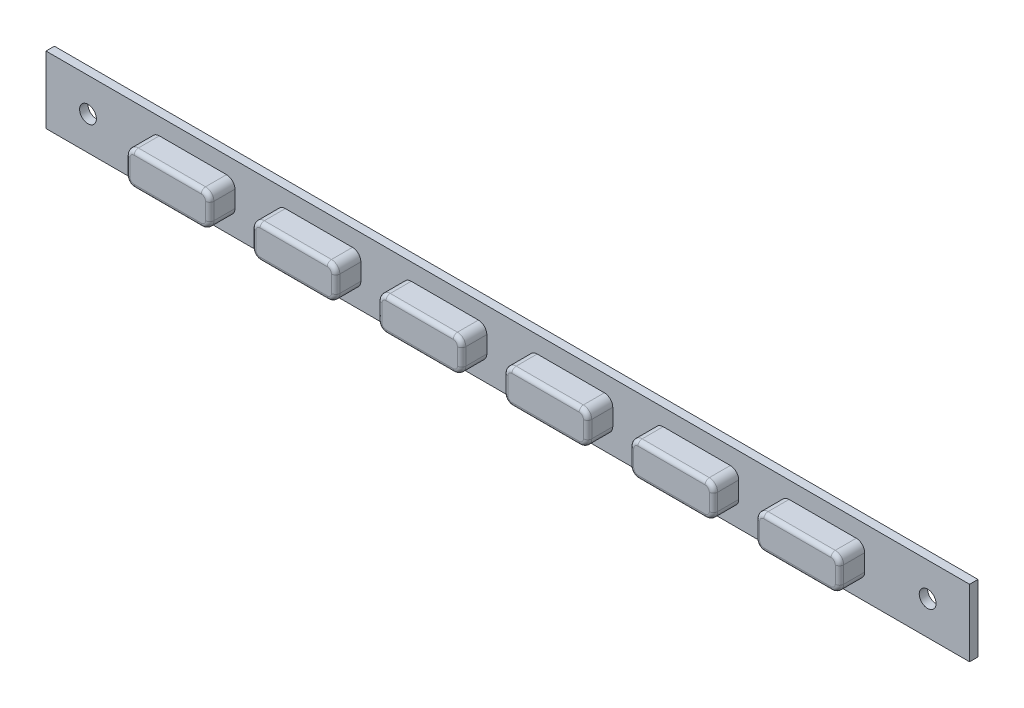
ISO-10303-21;
HEADER;
FILE_DESCRIPTION(('STEP AP214'),'2;1');
FILE_NAME('part.step','',(''),(''),'','','');
FILE_SCHEMA(('AUTOMOTIVE_DESIGN { 1 0 10303 214 1 1 1 1 }'));
ENDSEC;
DATA;
#1=APPLICATION_CONTEXT('core data for automotive mechanical design processes');
#2=APPLICATION_PROTOCOL_DEFINITION('international standard','automotive_design',2000,#1);
#3=PRODUCT_CONTEXT('',#1,'mechanical');
#4=PRODUCT('Part','Part','',(#3));
#5=PRODUCT_RELATED_PRODUCT_CATEGORY('part','',(#4));
#6=PRODUCT_DEFINITION_FORMATION('','',#4);
#7=PRODUCT_DEFINITION_CONTEXT('part definition',#1,'design');
#8=PRODUCT_DEFINITION('design','',#6,#7);
#9=PRODUCT_DEFINITION_SHAPE('','',#8);
#10=(LENGTH_UNIT() NAMED_UNIT(*) SI_UNIT(.MILLI.,.METRE.));
#11=(NAMED_UNIT(*) PLANE_ANGLE_UNIT() SI_UNIT($,.RADIAN.));
#12=(NAMED_UNIT(*) SI_UNIT($,.STERADIAN.) SOLID_ANGLE_UNIT());
#13=UNCERTAINTY_MEASURE_WITH_UNIT(LENGTH_MEASURE(1.E-05),#10,'distance_accuracy_value','');
#14=(GEOMETRIC_REPRESENTATION_CONTEXT(3) GLOBAL_UNCERTAINTY_ASSIGNED_CONTEXT((#13)) GLOBAL_UNIT_ASSIGNED_CONTEXT((#10,
#11,#12)) REPRESENTATION_CONTEXT('',''));
#15=CARTESIAN_POINT('',(0.,0.,0.));
#16=DIRECTION('',(0.,0.,1.));
#17=DIRECTION('',(1.,0.,0.));
#18=AXIS2_PLACEMENT_3D('',#15,#16,#17);
#19=CARTESIAN_POINT('',(-55.,23.1633603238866,1.));
#20=DIRECTION('',(0.,0.,1.));
#21=DIRECTION('',(1.,0.,0.));
#22=AXIS2_PLACEMENT_3D('',#19,#20,#21);
#23=PLANE('',#22);
#24=DIRECTION('',(-1.,0.,0.));
#25=VECTOR('',#24,1.);
#26=CARTESIAN_POINT('',(42.5,17.1633603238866,1.));
#27=LINE('',#26,#25);
#28=CARTESIAN_POINT('',(41.5,17.1633603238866,1.));
#29=VERTEX_POINT('',#28);
#30=CARTESIAN_POINT('',(33.5,17.1633603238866,1.));
#31=VERTEX_POINT('',#30);
#32=EDGE_CURVE('E1050',#29,#31,#27,.T.);
#33=ORIENTED_EDGE('',*,*,#32,.T.);
#34=CARTESIAN_POINT('',(33.5,18.1633603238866,1.));
#35=DIRECTION('',(0.,0.,1.));
#36=DIRECTION('',(1.,0.,0.));
#37=AXIS2_PLACEMENT_3D('',#34,#35,#36);
#38=CIRCLE('',#37,1.);
#39=CARTESIAN_POINT('',(32.5,18.1633603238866,1.));
#40=VERTEX_POINT('',#39);
#41=EDGE_CURVE('E1052',#31,#40,#38,.F.);
#42=ORIENTED_EDGE('',*,*,#41,.T.);
#43=DIRECTION('',(0.,-1.,0.));
#44=VECTOR('',#43,1.);
#45=CARTESIAN_POINT('',(32.5,21.1633603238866,1.));
#46=LINE('',#45,#44);
#47=CARTESIAN_POINT('',(32.5,20.1633603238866,1.));
#48=VERTEX_POINT('',#47);
#49=EDGE_CURVE('E1054',#48,#40,#46,.T.);
#50=ORIENTED_EDGE('',*,*,#49,.F.);
#51=CARTESIAN_POINT('',(33.5,20.1633603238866,1.));
#52=DIRECTION('',(0.,0.,1.));
#53=DIRECTION('',(1.,0.,0.));
#54=AXIS2_PLACEMENT_3D('',#51,#52,#53);
#55=CIRCLE('',#54,1.);
#56=CARTESIAN_POINT('',(33.5,21.1633603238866,1.));
#57=VERTEX_POINT('',#56);
#58=EDGE_CURVE('E1057',#48,#57,#55,.F.);
#59=ORIENTED_EDGE('',*,*,#58,.T.);
#60=DIRECTION('',(1.,0.,0.));
#61=VECTOR('',#60,1.);
#62=CARTESIAN_POINT('',(32.5,21.1633603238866,1.));
#63=LINE('',#62,#61);
#64=CARTESIAN_POINT('',(41.5,21.1633603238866,1.));
#65=VERTEX_POINT('',#64);
#66=EDGE_CURVE('E1059',#57,#65,#63,.T.);
#67=ORIENTED_EDGE('',*,*,#66,.T.);
#68=CARTESIAN_POINT('',(41.5,20.1633603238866,1.));
#69=DIRECTION('',(0.,0.,1.));
#70=DIRECTION('',(1.,0.,0.));
#71=AXIS2_PLACEMENT_3D('',#68,#69,#70);
#72=CIRCLE('',#71,1.);
#73=CARTESIAN_POINT('',(42.5,20.1633603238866,1.));
#74=VERTEX_POINT('',#73);
#75=EDGE_CURVE('E1061',#65,#74,#72,.F.);
#76=ORIENTED_EDGE('',*,*,#75,.T.);
#77=DIRECTION('',(0.,1.,0.));
#78=VECTOR('',#77,1.);
#79=CARTESIAN_POINT('',(42.5,17.1633603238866,1.));
#80=LINE('',#79,#78);
#81=CARTESIAN_POINT('',(42.5,18.1633603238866,1.));
#82=VERTEX_POINT('',#81);
#83=EDGE_CURVE('E1063',#82,#74,#80,.T.);
#84=ORIENTED_EDGE('',*,*,#83,.F.);
#85=CARTESIAN_POINT('',(41.5,18.1633603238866,1.));
#86=DIRECTION('',(0.,0.,1.));
#87=DIRECTION('',(1.,0.,0.));
#88=AXIS2_PLACEMENT_3D('',#85,#86,#87);
#89=CIRCLE('',#88,1.);
#90=EDGE_CURVE('E1066',#82,#29,#89,.F.);
#91=ORIENTED_EDGE('',*,*,#90,.T.);
#92=EDGE_LOOP('',(#33,#42,#50,#59,#67,#76,#84,#91));
#93=FACE_BOUND('',#92,.T.);
#94=DIRECTION('',(-1.,0.,0.));
#95=VECTOR('',#94,1.);
#96=CARTESIAN_POINT('',(27.5,17.1633603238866,1.));
#97=LINE('',#96,#95);
#98=CARTESIAN_POINT('',(26.5,17.1633603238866,1.));
#99=VERTEX_POINT('',#98);
#100=CARTESIAN_POINT('',(18.5,17.1633603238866,1.));
#101=VERTEX_POINT('',#100);
#102=EDGE_CURVE('E950',#99,#101,#97,.T.);
#103=ORIENTED_EDGE('',*,*,#102,.T.);
#104=CARTESIAN_POINT('',(18.5,18.1633603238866,1.));
#105=DIRECTION('',(0.,0.,1.));
#106=DIRECTION('',(1.,0.,0.));
#107=AXIS2_PLACEMENT_3D('',#104,#105,#106);
#108=CIRCLE('',#107,1.);
#109=CARTESIAN_POINT('',(17.5,18.1633603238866,1.));
#110=VERTEX_POINT('',#109);
#111=EDGE_CURVE('E952',#101,#110,#108,.F.);
#112=ORIENTED_EDGE('',*,*,#111,.T.);
#113=DIRECTION('',(0.,-1.,0.));
#114=VECTOR('',#113,1.);
#115=CARTESIAN_POINT('',(17.5,21.1633603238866,1.));
#116=LINE('',#115,#114);
#117=CARTESIAN_POINT('',(17.5,20.1633603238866,1.));
#118=VERTEX_POINT('',#117);
#119=EDGE_CURVE('E954',#118,#110,#116,.T.);
#120=ORIENTED_EDGE('',*,*,#119,.F.);
#121=CARTESIAN_POINT('',(18.5,20.1633603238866,1.));
#122=DIRECTION('',(0.,0.,1.));
#123=DIRECTION('',(1.,0.,0.));
#124=AXIS2_PLACEMENT_3D('',#121,#122,#123);
#125=CIRCLE('',#124,1.);
#126=CARTESIAN_POINT('',(18.5,21.1633603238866,1.));
#127=VERTEX_POINT('',#126);
#128=EDGE_CURVE('E957',#118,#127,#125,.F.);
#129=ORIENTED_EDGE('',*,*,#128,.T.);
#130=DIRECTION('',(1.,0.,0.));
#131=VECTOR('',#130,1.);
#132=CARTESIAN_POINT('',(17.5,21.1633603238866,1.));
#133=LINE('',#132,#131);
#134=CARTESIAN_POINT('',(26.5,21.1633603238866,1.));
#135=VERTEX_POINT('',#134);
#136=EDGE_CURVE('E959',#127,#135,#133,.T.);
#137=ORIENTED_EDGE('',*,*,#136,.T.);
#138=CARTESIAN_POINT('',(26.5,20.1633603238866,1.));
#139=DIRECTION('',(0.,0.,1.));
#140=DIRECTION('',(1.,0.,0.));
#141=AXIS2_PLACEMENT_3D('',#138,#139,#140);
#142=CIRCLE('',#141,1.);
#143=CARTESIAN_POINT('',(27.5,20.1633603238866,1.));
#144=VERTEX_POINT('',#143);
#145=EDGE_CURVE('E961',#135,#144,#142,.F.);
#146=ORIENTED_EDGE('',*,*,#145,.T.);
#147=DIRECTION('',(0.,1.,0.));
#148=VECTOR('',#147,1.);
#149=CARTESIAN_POINT('',(27.5,17.1633603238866,1.));
#150=LINE('',#149,#148);
#151=CARTESIAN_POINT('',(27.5,18.1633603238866,1.));
#152=VERTEX_POINT('',#151);
#153=EDGE_CURVE('E963',#152,#144,#150,.T.);
#154=ORIENTED_EDGE('',*,*,#153,.F.);
#155=CARTESIAN_POINT('',(26.5,18.1633603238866,1.));
#156=DIRECTION('',(0.,0.,1.));
#157=DIRECTION('',(1.,0.,0.));
#158=AXIS2_PLACEMENT_3D('',#155,#156,#157);
#159=CIRCLE('',#158,1.);
#160=EDGE_CURVE('E966',#152,#99,#159,.F.);
#161=ORIENTED_EDGE('',*,*,#160,.T.);
#162=EDGE_LOOP('',(#103,#112,#120,#129,#137,#146,#154,#161));
#163=FACE_BOUND('',#162,.T.);
#164=DIRECTION('',(-1.,0.,0.));
#165=VECTOR('',#164,1.);
#166=CARTESIAN_POINT('',(12.5,17.1633603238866,1.));
#167=LINE('',#166,#165);
#168=CARTESIAN_POINT('',(11.5,17.1633603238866,1.));
#169=VERTEX_POINT('',#168);
#170=CARTESIAN_POINT('',(3.5,17.1633603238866,1.));
#171=VERTEX_POINT('',#170);
#172=EDGE_CURVE('E850',#169,#171,#167,.T.);
#173=ORIENTED_EDGE('',*,*,#172,.T.);
#174=CARTESIAN_POINT('',(3.5,18.1633603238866,1.));
#175=DIRECTION('',(0.,0.,1.));
#176=DIRECTION('',(1.,0.,0.));
#177=AXIS2_PLACEMENT_3D('',#174,#175,#176);
#178=CIRCLE('',#177,1.);
#179=CARTESIAN_POINT('',(2.5,18.1633603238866,1.));
#180=VERTEX_POINT('',#179);
#181=EDGE_CURVE('E852',#171,#180,#178,.F.);
#182=ORIENTED_EDGE('',*,*,#181,.T.);
#183=DIRECTION('',(0.,-1.,0.));
#184=VECTOR('',#183,1.);
#185=CARTESIAN_POINT('',(2.5,21.1633603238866,1.));
#186=LINE('',#185,#184);
#187=CARTESIAN_POINT('',(2.5,20.1633603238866,1.));
#188=VERTEX_POINT('',#187);
#189=EDGE_CURVE('E854',#188,#180,#186,.T.);
#190=ORIENTED_EDGE('',*,*,#189,.F.);
#191=CARTESIAN_POINT('',(3.5,20.1633603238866,1.));
#192=DIRECTION('',(0.,0.,1.));
#193=DIRECTION('',(1.,0.,0.));
#194=AXIS2_PLACEMENT_3D('',#191,#192,#193);
#195=CIRCLE('',#194,1.);
#196=CARTESIAN_POINT('',(3.5,21.1633603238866,1.));
#197=VERTEX_POINT('',#196);
#198=EDGE_CURVE('E857',#188,#197,#195,.F.);
#199=ORIENTED_EDGE('',*,*,#198,.T.);
#200=DIRECTION('',(1.,0.,0.));
#201=VECTOR('',#200,1.);
#202=CARTESIAN_POINT('',(2.5,21.1633603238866,1.));
#203=LINE('',#202,#201);
#204=CARTESIAN_POINT('',(11.5,21.1633603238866,1.));
#205=VERTEX_POINT('',#204);
#206=EDGE_CURVE('E859',#197,#205,#203,.T.);
#207=ORIENTED_EDGE('',*,*,#206,.T.);
#208=CARTESIAN_POINT('',(11.5,20.1633603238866,1.));
#209=DIRECTION('',(0.,0.,1.));
#210=DIRECTION('',(1.,0.,0.));
#211=AXIS2_PLACEMENT_3D('',#208,#209,#210);
#212=CIRCLE('',#211,1.);
#213=CARTESIAN_POINT('',(12.5,20.1633603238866,1.));
#214=VERTEX_POINT('',#213);
#215=EDGE_CURVE('E861',#205,#214,#212,.F.);
#216=ORIENTED_EDGE('',*,*,#215,.T.);
#217=DIRECTION('',(0.,1.,0.));
#218=VECTOR('',#217,1.);
#219=CARTESIAN_POINT('',(12.5,17.1633603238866,1.));
#220=LINE('',#219,#218);
#221=CARTESIAN_POINT('',(12.5,18.1633603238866,1.));
#222=VERTEX_POINT('',#221);
#223=EDGE_CURVE('E863',#222,#214,#220,.T.);
#224=ORIENTED_EDGE('',*,*,#223,.F.);
#225=CARTESIAN_POINT('',(11.5,18.1633603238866,1.));
#226=DIRECTION('',(0.,0.,1.));
#227=DIRECTION('',(1.,0.,0.));
#228=AXIS2_PLACEMENT_3D('',#225,#226,#227);
#229=CIRCLE('',#228,1.);
#230=EDGE_CURVE('E866',#222,#169,#229,.F.);
#231=ORIENTED_EDGE('',*,*,#230,.T.);
#232=EDGE_LOOP('',(#173,#182,#190,#199,#207,#216,#224,#231));
#233=FACE_BOUND('',#232,.T.);
#234=DIRECTION('',(-1.,0.,0.));
#235=VECTOR('',#234,1.);
#236=CARTESIAN_POINT('',(-2.5,17.1633603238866,1.));
#237=LINE('',#236,#235);
#238=CARTESIAN_POINT('',(-3.5,17.1633603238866,1.));
#239=VERTEX_POINT('',#238);
#240=CARTESIAN_POINT('',(-11.5,17.1633603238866,1.));
#241=VERTEX_POINT('',#240);
#242=EDGE_CURVE('E750',#239,#241,#237,.T.);
#243=ORIENTED_EDGE('',*,*,#242,.T.);
#244=CARTESIAN_POINT('',(-11.5,18.1633603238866,1.));
#245=DIRECTION('',(0.,0.,1.));
#246=DIRECTION('',(1.,0.,0.));
#247=AXIS2_PLACEMENT_3D('',#244,#245,#246);
#248=CIRCLE('',#247,1.);
#249=CARTESIAN_POINT('',(-12.5,18.1633603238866,1.));
#250=VERTEX_POINT('',#249);
#251=EDGE_CURVE('E752',#241,#250,#248,.F.);
#252=ORIENTED_EDGE('',*,*,#251,.T.);
#253=DIRECTION('',(0.,-1.,0.));
#254=VECTOR('',#253,1.);
#255=CARTESIAN_POINT('',(-12.5,21.1633603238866,1.));
#256=LINE('',#255,#254);
#257=CARTESIAN_POINT('',(-12.5,20.1633603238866,1.));
#258=VERTEX_POINT('',#257);
#259=EDGE_CURVE('E754',#258,#250,#256,.T.);
#260=ORIENTED_EDGE('',*,*,#259,.F.);
#261=CARTESIAN_POINT('',(-11.5,20.1633603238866,1.));
#262=DIRECTION('',(0.,0.,1.));
#263=DIRECTION('',(1.,0.,0.));
#264=AXIS2_PLACEMENT_3D('',#261,#262,#263);
#265=CIRCLE('',#264,1.);
#266=CARTESIAN_POINT('',(-11.5,21.1633603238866,1.));
#267=VERTEX_POINT('',#266);
#268=EDGE_CURVE('E757',#258,#267,#265,.F.);
#269=ORIENTED_EDGE('',*,*,#268,.T.);
#270=DIRECTION('',(1.,0.,0.));
#271=VECTOR('',#270,1.);
#272=CARTESIAN_POINT('',(-12.5,21.1633603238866,1.));
#273=LINE('',#272,#271);
#274=CARTESIAN_POINT('',(-3.5,21.1633603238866,1.));
#275=VERTEX_POINT('',#274);
#276=EDGE_CURVE('E759',#267,#275,#273,.T.);
#277=ORIENTED_EDGE('',*,*,#276,.T.);
#278=CARTESIAN_POINT('',(-3.5,20.1633603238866,1.));
#279=DIRECTION('',(0.,0.,1.));
#280=DIRECTION('',(1.,0.,0.));
#281=AXIS2_PLACEMENT_3D('',#278,#279,#280);
#282=CIRCLE('',#281,1.);
#283=CARTESIAN_POINT('',(-2.5,20.1633603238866,1.));
#284=VERTEX_POINT('',#283);
#285=EDGE_CURVE('E761',#275,#284,#282,.F.);
#286=ORIENTED_EDGE('',*,*,#285,.T.);
#287=DIRECTION('',(0.,1.,0.));
#288=VECTOR('',#287,1.);
#289=CARTESIAN_POINT('',(-2.5,17.1633603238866,1.));
#290=LINE('',#289,#288);
#291=CARTESIAN_POINT('',(-2.5,18.1633603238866,1.));
#292=VERTEX_POINT('',#291);
#293=EDGE_CURVE('E763',#292,#284,#290,.T.);
#294=ORIENTED_EDGE('',*,*,#293,.F.);
#295=CARTESIAN_POINT('',(-3.5,18.1633603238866,1.));
#296=DIRECTION('',(0.,0.,1.));
#297=DIRECTION('',(1.,0.,0.));
#298=AXIS2_PLACEMENT_3D('',#295,#296,#297);
#299=CIRCLE('',#298,1.);
#300=EDGE_CURVE('E766',#292,#239,#299,.F.);
#301=ORIENTED_EDGE('',*,*,#300,.T.);
#302=EDGE_LOOP('',(#243,#252,#260,#269,#277,#286,#294,#301));
#303=FACE_BOUND('',#302,.T.);
#304=DIRECTION('',(0.,1.,0.));
#305=VECTOR('',#304,1.);
#306=CARTESIAN_POINT('',(-32.5,17.1633603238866,1.));
#307=LINE('',#306,#305);
#308=CARTESIAN_POINT('',(-32.5,18.1633603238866,1.));
#309=VERTEX_POINT('',#308);
#310=CARTESIAN_POINT('',(-32.5,20.1633603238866,1.));
#311=VERTEX_POINT('',#310);
#312=EDGE_CURVE('E652',#309,#311,#307,.T.);
#313=ORIENTED_EDGE('',*,*,#312,.F.);
#314=CARTESIAN_POINT('',(-33.5,18.1633603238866,1.));
#315=DIRECTION('',(0.,0.,1.));
#316=DIRECTION('',(1.,0.,0.));
#317=AXIS2_PLACEMENT_3D('',#314,#315,#316);
#318=CIRCLE('',#317,1.);
#319=CARTESIAN_POINT('',(-33.5,17.1633603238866,1.));
#320=VERTEX_POINT('',#319);
#321=EDGE_CURVE('E710',#309,#320,#318,.F.);
#322=ORIENTED_EDGE('',*,*,#321,.T.);
#323=DIRECTION('',(-1.,0.,0.));
#324=VECTOR('',#323,1.);
#325=CARTESIAN_POINT('',(-32.5,17.1633603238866,1.));
#326=LINE('',#325,#324);
#327=CARTESIAN_POINT('',(-41.5,17.1633603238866,1.));
#328=VERTEX_POINT('',#327);
#329=EDGE_CURVE('E649',#320,#328,#326,.T.);
#330=ORIENTED_EDGE('',*,*,#329,.T.);
#331=CARTESIAN_POINT('',(-41.5,18.1633603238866,1.));
#332=DIRECTION('',(0.,0.,1.));
#333=DIRECTION('',(1.,0.,0.));
#334=AXIS2_PLACEMENT_3D('',#331,#332,#333);
#335=CIRCLE('',#334,1.);
#336=CARTESIAN_POINT('',(-42.5,18.1633603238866,1.));
#337=VERTEX_POINT('',#336);
#338=EDGE_CURVE('E708',#328,#337,#335,.F.);
#339=ORIENTED_EDGE('',*,*,#338,.T.);
#340=DIRECTION('',(0.,-1.,0.));
#341=VECTOR('',#340,1.);
#342=CARTESIAN_POINT('',(-42.5,21.1633603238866,1.));
#343=LINE('',#342,#341);
#344=CARTESIAN_POINT('',(-42.5,20.1633603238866,1.));
#345=VERTEX_POINT('',#344);
#346=EDGE_CURVE('E646',#345,#337,#343,.T.);
#347=ORIENTED_EDGE('',*,*,#346,.F.);
#348=CARTESIAN_POINT('',(-41.5,20.1633603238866,1.));
#349=DIRECTION('',(0.,0.,1.));
#350=DIRECTION('',(1.,0.,0.));
#351=AXIS2_PLACEMENT_3D('',#348,#349,#350);
#352=CIRCLE('',#351,1.);
#353=CARTESIAN_POINT('',(-41.5,21.1633603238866,1.));
#354=VERTEX_POINT('',#353);
#355=EDGE_CURVE('E714',#345,#354,#352,.F.);
#356=ORIENTED_EDGE('',*,*,#355,.T.);
#357=DIRECTION('',(1.,0.,0.));
#358=VECTOR('',#357,1.);
#359=CARTESIAN_POINT('',(-42.5,21.1633603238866,1.));
#360=LINE('',#359,#358);
#361=CARTESIAN_POINT('',(-33.5,21.1633603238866,1.));
#362=VERTEX_POINT('',#361);
#363=EDGE_CURVE('E655',#354,#362,#360,.T.);
#364=ORIENTED_EDGE('',*,*,#363,.T.);
#365=CARTESIAN_POINT('',(-33.5,20.1633603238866,1.));
#366=DIRECTION('',(0.,0.,1.));
#367=DIRECTION('',(1.,0.,0.));
#368=AXIS2_PLACEMENT_3D('',#365,#366,#367);
#369=CIRCLE('',#368,1.);
#370=EDGE_CURVE('E712',#362,#311,#369,.F.);
#371=ORIENTED_EDGE('',*,*,#370,.T.);
#372=EDGE_LOOP('',(#313,#322,#330,#339,#347,#356,#364,#371));
#373=FACE_BOUND('',#372,.T.);
#374=DIRECTION('',(0.,-1.,0.));
#375=VECTOR('',#374,1.);
#376=CARTESIAN_POINT('',(-55.,23.1633603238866,1.));
#377=LINE('',#376,#375);
#378=CARTESIAN_POINT('',(-55.,23.1633603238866,1.));
#379=VERTEX_POINT('',#378);
#380=CARTESIAN_POINT('',(-55.,15.1633603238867,1.));
#381=VERTEX_POINT('',#380);
#382=EDGE_CURVE('E670',#379,#381,#377,.T.);
#383=ORIENTED_EDGE('',*,*,#382,.T.);
#384=DIRECTION('',(-1.,0.,0.));
#385=VECTOR('',#384,1.);
#386=CARTESIAN_POINT('',(55.,15.1633603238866,1.));
#387=LINE('',#386,#385);
#388=CARTESIAN_POINT('',(55.,15.1633603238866,1.));
#389=VERTEX_POINT('',#388);
#390=EDGE_CURVE('E672',#389,#381,#387,.T.);
#391=ORIENTED_EDGE('',*,*,#390,.F.);
#392=DIRECTION('',(0.,1.,0.));
#393=VECTOR('',#392,1.);
#394=CARTESIAN_POINT('',(55.,15.1633603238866,1.));
#395=LINE('',#394,#393);
#396=CARTESIAN_POINT('',(55.,23.1633603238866,1.));
#397=VERTEX_POINT('',#396);
#398=EDGE_CURVE('E675',#389,#397,#395,.T.);
#399=ORIENTED_EDGE('',*,*,#398,.T.);
#400=DIRECTION('',(1.,0.,0.));
#401=VECTOR('',#400,1.);
#402=CARTESIAN_POINT('',(-55.,23.1633603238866,1.));
#403=LINE('',#402,#401);
#404=EDGE_CURVE('E677',#379,#397,#403,.T.);
#405=ORIENTED_EDGE('',*,*,#404,.F.);
#406=EDGE_LOOP('',(#383,#391,#399,#405));
#407=FACE_BOUND('',#406,.T.);
#408=DIRECTION('',(0.,1.,0.));
#409=VECTOR('',#408,1.);
#410=CARTESIAN_POINT('',(-17.5,17.1633603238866,1.));
#411=LINE('',#410,#409);
#412=CARTESIAN_POINT('',(-17.5,18.1633603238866,1.));
#413=VERTEX_POINT('',#412);
#414=CARTESIAN_POINT('',(-17.5,20.1633603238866,1.));
#415=VERTEX_POINT('',#414);
#416=EDGE_CURVE('E619',#413,#415,#411,.T.);
#417=ORIENTED_EDGE('',*,*,#416,.F.);
#418=CARTESIAN_POINT('',(-18.5,18.1633603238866,1.));
#419=DIRECTION('',(0.,0.,1.));
#420=DIRECTION('',(1.,0.,0.));
#421=AXIS2_PLACEMENT_3D('',#418,#419,#420);
#422=CIRCLE('',#421,1.);
#423=CARTESIAN_POINT('',(-18.5,17.1633603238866,1.));
#424=VERTEX_POINT('',#423);
#425=EDGE_CURVE('E575',#413,#424,#422,.F.);
#426=ORIENTED_EDGE('',*,*,#425,.T.);
#427=DIRECTION('',(-1.,0.,0.));
#428=VECTOR('',#427,1.);
#429=CARTESIAN_POINT('',(-17.5,17.1633603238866,1.));
#430=LINE('',#429,#428);
#431=CARTESIAN_POINT('',(-26.5,17.1633603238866,1.));
#432=VERTEX_POINT('',#431);
#433=EDGE_CURVE('E622',#424,#432,#430,.T.);
#434=ORIENTED_EDGE('',*,*,#433,.T.);
#435=CARTESIAN_POINT('',(-26.5,18.1633603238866,1.));
#436=DIRECTION('',(0.,0.,1.));
#437=DIRECTION('',(1.,0.,0.));
#438=AXIS2_PLACEMENT_3D('',#435,#436,#437);
#439=CIRCLE('',#438,1.);
#440=CARTESIAN_POINT('',(-27.5,18.1633603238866,1.));
#441=VERTEX_POINT('',#440);
#442=EDGE_CURVE('E550',#432,#441,#439,.F.);
#443=ORIENTED_EDGE('',*,*,#442,.T.);
#444=DIRECTION('',(0.,-1.,0.));
#445=VECTOR('',#444,1.);
#446=CARTESIAN_POINT('',(-27.5,21.1633603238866,1.));
#447=LINE('',#446,#445);
#448=CARTESIAN_POINT('',(-27.5,20.1633603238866,1.));
#449=VERTEX_POINT('',#448);
#450=EDGE_CURVE('E617',#449,#441,#447,.T.);
#451=ORIENTED_EDGE('',*,*,#450,.F.);
#452=CARTESIAN_POINT('',(-26.5,20.1633603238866,1.));
#453=DIRECTION('',(0.,0.,1.));
#454=DIRECTION('',(1.,0.,0.));
#455=AXIS2_PLACEMENT_3D('',#452,#453,#454);
#456=CIRCLE('',#455,1.);
#457=CARTESIAN_POINT('',(-26.5,21.1633603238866,1.));
#458=VERTEX_POINT('',#457);
#459=EDGE_CURVE('E509',#449,#458,#456,.F.);
#460=ORIENTED_EDGE('',*,*,#459,.T.);
#461=DIRECTION('',(1.,0.,0.));
#462=VECTOR('',#461,1.);
#463=CARTESIAN_POINT('',(-27.5,21.1633603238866,1.));
#464=LINE('',#463,#462);
#465=CARTESIAN_POINT('',(-18.5,21.1633603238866,1.));
#466=VERTEX_POINT('',#465);
#467=EDGE_CURVE('E615',#458,#466,#464,.T.);
#468=ORIENTED_EDGE('',*,*,#467,.T.);
#469=CARTESIAN_POINT('',(-18.5,20.1633603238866,1.));
#470=DIRECTION('',(0.,0.,1.));
#471=DIRECTION('',(1.,0.,0.));
#472=AXIS2_PLACEMENT_3D('',#469,#470,#471);
#473=CIRCLE('',#472,1.);
#474=EDGE_CURVE('E599',#466,#415,#473,.F.);
#475=ORIENTED_EDGE('',*,*,#474,.T.);
#476=EDGE_LOOP('',(#417,#426,#434,#443,#451,#460,#468,#475));
#477=FACE_BOUND('',#476,.T.);
#478=CARTESIAN_POINT('',(-50.,19.1633603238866,1.));
#479=DIRECTION('',(0.,0.,1.));
#480=DIRECTION('',(1.,0.,0.));
#481=AXIS2_PLACEMENT_3D('',#478,#479,#480);
#482=CIRCLE('',#481,0.999999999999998);
#483=CARTESIAN_POINT('',(-49.,19.1633603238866,1.));
#484=VERTEX_POINT('',#483);
#485=EDGE_CURVE('E1502',#484,#484,#482,.T.);
#486=ORIENTED_EDGE('',*,*,#485,.F.);
#487=EDGE_LOOP('',(#486));
#488=FACE_BOUND('',#487,.T.);
#489=CARTESIAN_POINT('',(50.,19.1633603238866,1.));
#490=DIRECTION('',(0.,0.,-1.));
#491=DIRECTION('',(-1.,0.,0.));
#492=AXIS2_PLACEMENT_3D('',#489,#490,#491);
#493=CIRCLE('',#492,0.999999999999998);
#494=CARTESIAN_POINT('',(49.,19.1633603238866,1.));
#495=VERTEX_POINT('',#494);
#496=EDGE_CURVE('E1505',#495,#495,#493,.T.);
#497=ORIENTED_EDGE('',*,*,#496,.T.);
#498=EDGE_LOOP('',(#497));
#499=FACE_BOUND('',#498,.T.);
#500=ADVANCED_FACE('F29',(#93,#163,#233,#303,#373,#407,#477,#488,#499),#23,.T.);
#501=CARTESIAN_POINT('',(-55.,23.1633603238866,0.));
#502=DIRECTION('',(0.,0.,1.));
#503=DIRECTION('',(1.,0.,0.));
#504=AXIS2_PLACEMENT_3D('',#501,#502,#503);
#505=PLANE('',#504);
#506=DIRECTION('',(0.,-1.,0.));
#507=VECTOR('',#506,1.);
#508=CARTESIAN_POINT('',(-55.,23.1633603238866,0.));
#509=LINE('',#508,#507);
#510=CARTESIAN_POINT('',(-55.,23.1633603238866,0.));
#511=VERTEX_POINT('',#510);
#512=CARTESIAN_POINT('',(-55.,15.1633603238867,0.));
#513=VERTEX_POINT('',#512);
#514=EDGE_CURVE('E658',#511,#513,#509,.T.);
#515=ORIENTED_EDGE('',*,*,#514,.F.);
#516=DIRECTION('',(1.,0.,0.));
#517=VECTOR('',#516,1.);
#518=CARTESIAN_POINT('',(-55.,23.1633603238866,0.));
#519=LINE('',#518,#517);
#520=CARTESIAN_POINT('',(55.,23.1633603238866,0.));
#521=VERTEX_POINT('',#520);
#522=EDGE_CURVE('E667',#511,#521,#519,.T.);
#523=ORIENTED_EDGE('',*,*,#522,.T.);
#524=DIRECTION('',(0.,1.,0.));
#525=VECTOR('',#524,1.);
#526=CARTESIAN_POINT('',(55.,15.1633603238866,0.));
#527=LINE('',#526,#525);
#528=CARTESIAN_POINT('',(55.,15.1633603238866,0.));
#529=VERTEX_POINT('',#528);
#530=EDGE_CURVE('E664',#529,#521,#527,.T.);
#531=ORIENTED_EDGE('',*,*,#530,.F.);
#532=DIRECTION('',(-1.,0.,0.));
#533=VECTOR('',#532,1.);
#534=CARTESIAN_POINT('',(55.,15.1633603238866,0.));
#535=LINE('',#534,#533);
#536=EDGE_CURVE('E661',#529,#513,#535,.T.);
#537=ORIENTED_EDGE('',*,*,#536,.T.);
#538=EDGE_LOOP('',(#515,#523,#531,#537));
#539=FACE_BOUND('',#538,.T.);
#540=CARTESIAN_POINT('',(-50.,19.1633603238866,0.));
#541=DIRECTION('',(0.,0.,1.));
#542=DIRECTION('',(1.,0.,0.));
#543=AXIS2_PLACEMENT_3D('',#540,#541,#542);
#544=CIRCLE('',#543,0.999999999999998);
#545=CARTESIAN_POINT('',(-49.,19.1633603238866,0.));
#546=VERTEX_POINT('',#545);
#547=EDGE_CURVE('E1513',#546,#546,#544,.T.);
#548=ORIENTED_EDGE('',*,*,#547,.T.);
#549=EDGE_LOOP('',(#548));
#550=FACE_BOUND('',#549,.T.);
#551=CARTESIAN_POINT('',(50.,19.1633603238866,0.));
#552=DIRECTION('',(0.,0.,-1.));
#553=DIRECTION('',(-1.,0.,0.));
#554=AXIS2_PLACEMENT_3D('',#551,#552,#553);
#555=CIRCLE('',#554,0.999999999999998);
#556=CARTESIAN_POINT('',(49.,19.1633603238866,0.));
#557=VERTEX_POINT('',#556);
#558=EDGE_CURVE('E1507',#557,#557,#555,.T.);
#559=ORIENTED_EDGE('',*,*,#558,.F.);
#560=EDGE_LOOP('',(#559));
#561=FACE_BOUND('',#560,.T.);
#562=ADVANCED_FACE('F1219',(#539,#550,#561),#505,.F.);
#563=CARTESIAN_POINT('',(-55.,23.1633603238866,1.));
#564=DIRECTION('',(1.,0.,0.));
#565=DIRECTION('',(0.,0.,-1.));
#566=AXIS2_PLACEMENT_3D('',#563,#564,#565);
#567=PLANE('',#566);
#568=ORIENTED_EDGE('',*,*,#514,.T.);
#569=DIRECTION('',(0.,0.,-1.));
#570=VECTOR('',#569,1.);
#571=CARTESIAN_POINT('',(-55.,15.1633603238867,1.));
#572=LINE('',#571,#570);
#573=EDGE_CURVE('E686',#381,#513,#572,.T.);
#574=ORIENTED_EDGE('',*,*,#573,.F.);
#575=ORIENTED_EDGE('',*,*,#382,.F.);
#576=DIRECTION('',(0.,0.,-1.));
#577=VECTOR('',#576,1.);
#578=CARTESIAN_POINT('',(-55.,23.1633603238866,1.));
#579=LINE('',#578,#577);
#580=EDGE_CURVE('E680',#379,#511,#579,.T.);
#581=ORIENTED_EDGE('',*,*,#580,.T.);
#582=EDGE_LOOP('',(#568,#574,#575,#581));
#583=FACE_BOUND('',#582,.T.);
#584=ADVANCED_FACE('F1224',(#583),#567,.F.);
#585=CARTESIAN_POINT('',(55.,15.1633603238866,1.));
#586=DIRECTION('',(0.,-1.,0.));
#587=DIRECTION('',(1.,0.,0.));
#588=AXIS2_PLACEMENT_3D('',#585,#586,#587);
#589=PLANE('',#588);
#590=ORIENTED_EDGE('',*,*,#536,.F.);
#591=DIRECTION('',(0.,0.,-1.));
#592=VECTOR('',#591,1.);
#593=CARTESIAN_POINT('',(55.,15.1633603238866,1.));
#594=LINE('',#593,#592);
#595=EDGE_CURVE('E684',#389,#529,#594,.T.);
#596=ORIENTED_EDGE('',*,*,#595,.F.);
#597=ORIENTED_EDGE('',*,*,#390,.T.);
#598=ORIENTED_EDGE('',*,*,#573,.T.);
#599=EDGE_LOOP('',(#590,#596,#597,#598));
#600=FACE_BOUND('',#599,.T.);
#601=ADVANCED_FACE('F1237',(#600),#589,.T.);
#602=CARTESIAN_POINT('',(55.,15.1633603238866,1.));
#603=DIRECTION('',(-1.,0.,0.));
#604=DIRECTION('',(0.,0.,1.));
#605=AXIS2_PLACEMENT_3D('',#602,#603,#604);
#606=PLANE('',#605);
#607=ORIENTED_EDGE('',*,*,#530,.T.);
#608=DIRECTION('',(0.,0.,-1.));
#609=VECTOR('',#608,1.);
#610=CARTESIAN_POINT('',(55.,23.1633603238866,1.));
#611=LINE('',#610,#609);
#612=EDGE_CURVE('E682',#397,#521,#611,.T.);
#613=ORIENTED_EDGE('',*,*,#612,.F.);
#614=ORIENTED_EDGE('',*,*,#398,.F.);
#615=ORIENTED_EDGE('',*,*,#595,.T.);
#616=EDGE_LOOP('',(#607,#613,#614,#615));
#617=FACE_BOUND('',#616,.T.);
#618=ADVANCED_FACE('F1233',(#617),#606,.F.);
#619=CARTESIAN_POINT('',(-55.,23.1633603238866,1.));
#620=DIRECTION('',(0.,1.,0.));
#621=DIRECTION('',(-1.,0.,0.));
#622=AXIS2_PLACEMENT_3D('',#619,#620,#621);
#623=PLANE('',#622);
#624=ORIENTED_EDGE('',*,*,#522,.F.);
#625=ORIENTED_EDGE('',*,*,#580,.F.);
#626=ORIENTED_EDGE('',*,*,#404,.T.);
#627=ORIENTED_EDGE('',*,*,#612,.T.);
#628=EDGE_LOOP('',(#624,#625,#626,#627));
#629=FACE_BOUND('',#628,.T.);
#630=ADVANCED_FACE('F1229',(#629),#623,.T.);
#631=CARTESIAN_POINT('',(-42.5,21.1633603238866,4.));
#632=DIRECTION('',(1.,0.,0.));
#633=DIRECTION('',(0.,0.,-1.));
#634=AXIS2_PLACEMENT_3D('',#631,#632,#633);
#635=PLANE('',#634);
#636=DIRECTION('',(0.,0.,-1.));
#637=VECTOR('',#636,1.);
#638=CARTESIAN_POINT('',(-42.5,18.1633603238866,4.));
#639=LINE('',#638,#637);
#640=CARTESIAN_POINT('',(-42.5,18.1633603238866,3.5));
#641=VERTEX_POINT('',#640);
#642=EDGE_CURVE('E695',#337,#641,#639,.F.);
#643=ORIENTED_EDGE('',*,*,#642,.T.);
#644=DIRECTION('',(0.,-1.,0.));
#645=VECTOR('',#644,1.);
#646=CARTESIAN_POINT('',(-42.5,20.1633603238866,3.5));
#647=LINE('',#646,#645);
#648=CARTESIAN_POINT('',(-42.5,20.1633603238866,3.5));
#649=VERTEX_POINT('',#648);
#650=EDGE_CURVE('E740',#641,#649,#647,.F.);
#651=ORIENTED_EDGE('',*,*,#650,.T.);
#652=DIRECTION('',(0.,0.,-1.));
#653=VECTOR('',#652,1.);
#654=CARTESIAN_POINT('',(-42.5,20.1633603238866,1.));
#655=LINE('',#654,#653);
#656=EDGE_CURVE('E693',#649,#345,#655,.T.);
#657=ORIENTED_EDGE('',*,*,#656,.T.);
#658=ORIENTED_EDGE('',*,*,#346,.T.);
#659=EDGE_LOOP('',(#643,#651,#657,#658));
#660=FACE_BOUND('',#659,.T.);
#661=ADVANCED_FACE('F1232',(#660),#635,.F.);
#662=CARTESIAN_POINT('',(-32.5,17.1633603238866,4.));
#663=DIRECTION('',(0.,-1.,0.));
#664=DIRECTION('',(1.,0.,0.));
#665=AXIS2_PLACEMENT_3D('',#662,#663,#664);
#666=PLANE('',#665);
#667=DIRECTION('',(0.,0.,-1.));
#668=VECTOR('',#667,1.);
#669=CARTESIAN_POINT('',(-33.5,17.1633603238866,4.));
#670=LINE('',#669,#668);
#671=CARTESIAN_POINT('',(-33.5,17.1633603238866,3.5));
#672=VERTEX_POINT('',#671);
#673=EDGE_CURVE('E688',#320,#672,#670,.F.);
#674=ORIENTED_EDGE('',*,*,#673,.T.);
#675=DIRECTION('',(-1.,0.,0.));
#676=VECTOR('',#675,1.);
#677=CARTESIAN_POINT('',(-32.5,17.1633603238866,3.5));
#678=LINE('',#677,#676);
#679=CARTESIAN_POINT('',(-41.5,17.1633603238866,3.5));
#680=VERTEX_POINT('',#679);
#681=EDGE_CURVE('E716',#672,#680,#678,.T.);
#682=ORIENTED_EDGE('',*,*,#681,.T.);
#683=DIRECTION('',(0.,0.,-1.));
#684=VECTOR('',#683,1.);
#685=CARTESIAN_POINT('',(-41.5,17.1633603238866,1.));
#686=LINE('',#685,#684);
#687=EDGE_CURVE('E691',#680,#328,#686,.T.);
#688=ORIENTED_EDGE('',*,*,#687,.T.);
#689=ORIENTED_EDGE('',*,*,#329,.F.);
#690=EDGE_LOOP('',(#674,#682,#688,#689));
#691=FACE_BOUND('',#690,.T.);
#692=ADVANCED_FACE('F1636',(#691),#666,.T.);
#693=CARTESIAN_POINT('',(-32.5,17.1633603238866,4.));
#694=DIRECTION('',(-1.,0.,0.));
#695=DIRECTION('',(0.,0.,1.));
#696=AXIS2_PLACEMENT_3D('',#693,#694,#695);
#697=PLANE('',#696);
#698=DIRECTION('',(0.,0.,-1.));
#699=VECTOR('',#698,1.);
#700=CARTESIAN_POINT('',(-32.5,20.1633603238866,4.));
#701=LINE('',#700,#699);
#702=CARTESIAN_POINT('',(-32.5,20.1633603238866,3.5));
#703=VERTEX_POINT('',#702);
#704=EDGE_CURVE('E698',#311,#703,#701,.F.);
#705=ORIENTED_EDGE('',*,*,#704,.T.);
#706=DIRECTION('',(0.,1.,0.));
#707=VECTOR('',#706,1.);
#708=CARTESIAN_POINT('',(-32.5,18.1633603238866,3.5));
#709=LINE('',#708,#707);
#710=CARTESIAN_POINT('',(-32.5,18.1633603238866,3.5));
#711=VERTEX_POINT('',#710);
#712=EDGE_CURVE('E742',#703,#711,#709,.F.);
#713=ORIENTED_EDGE('',*,*,#712,.T.);
#714=DIRECTION('',(0.,0.,-1.));
#715=VECTOR('',#714,1.);
#716=CARTESIAN_POINT('',(-32.5,18.1633603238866,1.));
#717=LINE('',#716,#715);
#718=EDGE_CURVE('E701',#711,#309,#717,.T.);
#719=ORIENTED_EDGE('',*,*,#718,.T.);
#720=ORIENTED_EDGE('',*,*,#312,.T.);
#721=EDGE_LOOP('',(#705,#713,#719,#720));
#722=FACE_BOUND('',#721,.T.);
#723=ADVANCED_FACE('F1632',(#722),#697,.F.);
#724=CARTESIAN_POINT('',(-42.5,21.1633603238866,4.));
#725=DIRECTION('',(0.,1.,0.));
#726=DIRECTION('',(0.,0.,1.));
#727=AXIS2_PLACEMENT_3D('',#724,#725,#726);
#728=PLANE('',#727);
#729=DIRECTION('',(0.,0.,-1.));
#730=VECTOR('',#729,1.);
#731=CARTESIAN_POINT('',(-41.5,21.1633603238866,4.));
#732=LINE('',#731,#730);
#733=CARTESIAN_POINT('',(-41.5,21.1633603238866,3.5));
#734=VERTEX_POINT('',#733);
#735=EDGE_CURVE('E703',#354,#734,#732,.F.);
#736=ORIENTED_EDGE('',*,*,#735,.T.);
#737=DIRECTION('',(1.,0.,0.));
#738=VECTOR('',#737,1.);
#739=CARTESIAN_POINT('',(-42.5,21.1633603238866,3.5));
#740=LINE('',#739,#738);
#741=CARTESIAN_POINT('',(-33.5,21.1633603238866,3.5));
#742=VERTEX_POINT('',#741);
#743=EDGE_CURVE('E748',#734,#742,#740,.T.);
#744=ORIENTED_EDGE('',*,*,#743,.T.);
#745=DIRECTION('',(0.,0.,-1.));
#746=VECTOR('',#745,1.);
#747=CARTESIAN_POINT('',(-33.5,21.1633603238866,1.));
#748=LINE('',#747,#746);
#749=EDGE_CURVE('E706',#742,#362,#748,.T.);
#750=ORIENTED_EDGE('',*,*,#749,.T.);
#751=ORIENTED_EDGE('',*,*,#363,.F.);
#752=EDGE_LOOP('',(#736,#744,#750,#751));
#753=FACE_BOUND('',#752,.T.);
#754=ADVANCED_FACE('F1628',(#753),#728,.T.);
#755=CARTESIAN_POINT('',(-42.5,21.1633603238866,4.));
#756=DIRECTION('',(0.,0.,1.));
#757=DIRECTION('',(1.,0.,0.));
#758=AXIS2_PLACEMENT_3D('',#755,#756,#757);
#759=PLANE('',#758);
#760=CARTESIAN_POINT('',(-41.5,18.1633603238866,4.));
#761=DIRECTION('',(0.,0.,1.));
#762=DIRECTION('',(1.,0.,0.));
#763=AXIS2_PLACEMENT_3D('',#760,#761,#762);
#764=CIRCLE('',#763,0.5);
#765=CARTESIAN_POINT('',(-42.,18.1633603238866,4.));
#766=VERTEX_POINT('',#765);
#767=CARTESIAN_POINT('',(-41.5,17.6633603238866,4.));
#768=VERTEX_POINT('',#767);
#769=EDGE_CURVE('E731',#766,#768,#764,.T.);
#770=ORIENTED_EDGE('',*,*,#769,.T.);
#771=DIRECTION('',(-1.,0.,0.));
#772=VECTOR('',#771,1.);
#773=CARTESIAN_POINT('',(-42.5,17.6633603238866,4.));
#774=LINE('',#773,#772);
#775=CARTESIAN_POINT('',(-33.5,17.6633603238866,4.));
#776=VERTEX_POINT('',#775);
#777=EDGE_CURVE('E733',#768,#776,#774,.F.);
#778=ORIENTED_EDGE('',*,*,#777,.T.);
#779=CARTESIAN_POINT('',(-33.5,18.1633603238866,4.));
#780=DIRECTION('',(0.,0.,1.));
#781=DIRECTION('',(1.,0.,0.));
#782=AXIS2_PLACEMENT_3D('',#779,#780,#781);
#783=CIRCLE('',#782,0.5);
#784=CARTESIAN_POINT('',(-33.,18.1633603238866,4.));
#785=VERTEX_POINT('',#784);
#786=EDGE_CURVE('E729',#776,#785,#783,.T.);
#787=ORIENTED_EDGE('',*,*,#786,.T.);
#788=DIRECTION('',(0.,1.,0.));
#789=VECTOR('',#788,1.);
#790=CARTESIAN_POINT('',(-33.,20.1633603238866,4.));
#791=LINE('',#790,#789);
#792=CARTESIAN_POINT('',(-33.,20.1633603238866,4.));
#793=VERTEX_POINT('',#792);
#794=EDGE_CURVE('E725',#785,#793,#791,.T.);
#795=ORIENTED_EDGE('',*,*,#794,.T.);
#796=CARTESIAN_POINT('',(-33.5,20.1633603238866,4.));
#797=DIRECTION('',(0.,0.,1.));
#798=DIRECTION('',(1.,0.,0.));
#799=AXIS2_PLACEMENT_3D('',#796,#797,#798);
#800=CIRCLE('',#799,0.5);
#801=CARTESIAN_POINT('',(-33.5,20.6633603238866,4.));
#802=VERTEX_POINT('',#801);
#803=EDGE_CURVE('E721',#793,#802,#800,.T.);
#804=ORIENTED_EDGE('',*,*,#803,.T.);
#805=DIRECTION('',(1.,0.,0.));
#806=VECTOR('',#805,1.);
#807=CARTESIAN_POINT('',(-42.5,20.6633603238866,4.));
#808=LINE('',#807,#806);
#809=CARTESIAN_POINT('',(-41.5,20.6633603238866,4.));
#810=VERTEX_POINT('',#809);
#811=EDGE_CURVE('E719',#802,#810,#808,.F.);
#812=ORIENTED_EDGE('',*,*,#811,.T.);
#813=CARTESIAN_POINT('',(-41.5,20.1633603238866,4.));
#814=DIRECTION('',(0.,0.,1.));
#815=DIRECTION('',(1.,0.,0.));
#816=AXIS2_PLACEMENT_3D('',#813,#814,#815);
#817=CIRCLE('',#816,0.5);
#818=CARTESIAN_POINT('',(-42.,20.1633603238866,4.));
#819=VERTEX_POINT('',#818);
#820=EDGE_CURVE('E723',#810,#819,#817,.T.);
#821=ORIENTED_EDGE('',*,*,#820,.T.);
#822=DIRECTION('',(0.,-1.,0.));
#823=VECTOR('',#822,1.);
#824=CARTESIAN_POINT('',(-42.,18.1633603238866,4.));
#825=LINE('',#824,#823);
#826=EDGE_CURVE('E727',#819,#766,#825,.T.);
#827=ORIENTED_EDGE('',*,*,#826,.T.);
#828=EDGE_LOOP('',(#770,#778,#787,#795,#804,#812,#821,#827));
#829=FACE_BOUND('',#828,.T.);
#830=ADVANCED_FACE('F1624',(#829),#759,.T.);
#831=CARTESIAN_POINT('',(-41.5,18.1633603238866,4.));
#832=DIRECTION('',(0.,0.,1.));
#833=DIRECTION('',(1.,0.,0.));
#834=AXIS2_PLACEMENT_3D('',#831,#832,#833);
#835=CYLINDRICAL_SURFACE('',#834,1.);
#836=ORIENTED_EDGE('',*,*,#687,.F.);
#837=CARTESIAN_POINT('',(-41.5,18.1633603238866,3.5));
#838=DIRECTION('',(0.,0.,1.));
#839=DIRECTION('',(1.,0.,0.));
#840=AXIS2_PLACEMENT_3D('',#837,#838,#839);
#841=CIRCLE('',#840,1.);
#842=EDGE_CURVE('E736',#680,#641,#841,.F.);
#843=ORIENTED_EDGE('',*,*,#842,.T.);
#844=ORIENTED_EDGE('',*,*,#642,.F.);
#845=ORIENTED_EDGE('',*,*,#338,.F.);
#846=EDGE_LOOP('',(#836,#843,#844,#845));
#847=FACE_BOUND('',#846,.T.);
#848=ADVANCED_FACE('F1620',(#847),#835,.T.);
#849=CARTESIAN_POINT('',(-33.5,18.1633603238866,4.));
#850=DIRECTION('',(0.,0.,1.));
#851=DIRECTION('',(1.,0.,0.));
#852=AXIS2_PLACEMENT_3D('',#849,#850,#851);
#853=CYLINDRICAL_SURFACE('',#852,1.);
#854=ORIENTED_EDGE('',*,*,#718,.F.);
#855=CARTESIAN_POINT('',(-33.5,18.1633603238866,3.5));
#856=DIRECTION('',(0.,0.,1.));
#857=DIRECTION('',(1.,0.,0.));
#858=AXIS2_PLACEMENT_3D('',#855,#856,#857);
#859=CIRCLE('',#858,1.);
#860=EDGE_CURVE('E738',#711,#672,#859,.F.);
#861=ORIENTED_EDGE('',*,*,#860,.T.);
#862=ORIENTED_EDGE('',*,*,#673,.F.);
#863=ORIENTED_EDGE('',*,*,#321,.F.);
#864=EDGE_LOOP('',(#854,#861,#862,#863));
#865=FACE_BOUND('',#864,.T.);
#866=ADVANCED_FACE('F1616',(#865),#853,.T.);
#867=CARTESIAN_POINT('',(-33.5,20.1633603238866,4.));
#868=DIRECTION('',(0.,0.,1.));
#869=DIRECTION('',(1.,0.,0.));
#870=AXIS2_PLACEMENT_3D('',#867,#868,#869);
#871=CYLINDRICAL_SURFACE('',#870,1.);
#872=ORIENTED_EDGE('',*,*,#749,.F.);
#873=CARTESIAN_POINT('',(-33.5,20.1633603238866,3.5));
#874=DIRECTION('',(0.,0.,1.));
#875=DIRECTION('',(1.,0.,0.));
#876=AXIS2_PLACEMENT_3D('',#873,#874,#875);
#877=CIRCLE('',#876,1.);
#878=EDGE_CURVE('E746',#742,#703,#877,.F.);
#879=ORIENTED_EDGE('',*,*,#878,.T.);
#880=ORIENTED_EDGE('',*,*,#704,.F.);
#881=ORIENTED_EDGE('',*,*,#370,.F.);
#882=EDGE_LOOP('',(#872,#879,#880,#881));
#883=FACE_BOUND('',#882,.T.);
#884=ADVANCED_FACE('F1612',(#883),#871,.T.);
#885=CARTESIAN_POINT('',(-41.5,20.1633603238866,4.));
#886=DIRECTION('',(0.,0.,1.));
#887=DIRECTION('',(1.,0.,0.));
#888=AXIS2_PLACEMENT_3D('',#885,#886,#887);
#889=CYLINDRICAL_SURFACE('',#888,1.);
#890=ORIENTED_EDGE('',*,*,#656,.F.);
#891=CARTESIAN_POINT('',(-41.5,20.1633603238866,3.5));
#892=DIRECTION('',(0.,0.,1.));
#893=DIRECTION('',(1.,0.,0.));
#894=AXIS2_PLACEMENT_3D('',#891,#892,#893);
#895=CIRCLE('',#894,1.);
#896=EDGE_CURVE('E744',#649,#734,#895,.F.);
#897=ORIENTED_EDGE('',*,*,#896,.T.);
#898=ORIENTED_EDGE('',*,*,#735,.F.);
#899=ORIENTED_EDGE('',*,*,#355,.F.);
#900=EDGE_LOOP('',(#890,#897,#898,#899));
#901=FACE_BOUND('',#900,.T.);
#902=ADVANCED_FACE('F1608',(#901),#889,.T.);
#903=CARTESIAN_POINT('',(-42.5,20.6633603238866,3.5));
#904=DIRECTION('',(1.,0.,0.));
#905=DIRECTION('',(0.,0.,-1.));
#906=AXIS2_PLACEMENT_3D('',#903,#904,#905);
#907=CYLINDRICAL_SURFACE('',#906,0.5);
#908=CARTESIAN_POINT('',(-41.5,20.6633603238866,3.5));
#909=DIRECTION('',(-1.,0.,0.));
#910=DIRECTION('',(0.,0.,1.));
#911=AXIS2_PLACEMENT_3D('',#908,#909,#910);
#912=CIRCLE('',#911,0.5);
#913=EDGE_CURVE('E640',#810,#734,#912,.T.);
#914=ORIENTED_EDGE('',*,*,#913,.F.);
#915=ORIENTED_EDGE('',*,*,#811,.F.);
#916=CARTESIAN_POINT('',(-33.5,20.6633603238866,3.5));
#917=DIRECTION('',(1.,0.,0.));
#918=DIRECTION('',(0.,0.,-1.));
#919=AXIS2_PLACEMENT_3D('',#916,#917,#918);
#920=CIRCLE('',#919,0.5);
#921=EDGE_CURVE('E643',#742,#802,#920,.T.);
#922=ORIENTED_EDGE('',*,*,#921,.F.);
#923=ORIENTED_EDGE('',*,*,#743,.F.);
#924=EDGE_LOOP('',(#914,#915,#922,#923));
#925=FACE_BOUND('',#924,.T.);
#926=ADVANCED_FACE('F1604',(#925),#907,.T.);
#927=CARTESIAN_POINT('',(-33.5,20.1633603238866,3.5));
#928=DIRECTION('',(0.,0.,1.));
#929=DIRECTION('',(1.,0.,0.));
#930=AXIS2_PLACEMENT_3D('',#927,#928,#929);
#931=DEGENERATE_TOROIDAL_SURFACE('',#930,0.5,0.5,.T.);
#932=ORIENTED_EDGE('',*,*,#921,.T.);
#933=ORIENTED_EDGE('',*,*,#803,.F.);
#934=CARTESIAN_POINT('',(-33.,20.1633603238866,3.5));
#935=DIRECTION('',(0.,-1.,0.));
#936=DIRECTION('',(0.,0.,-1.));
#937=AXIS2_PLACEMENT_3D('',#934,#935,#936);
#938=CIRCLE('',#937,0.5);
#939=EDGE_CURVE('E637',#703,#793,#938,.T.);
#940=ORIENTED_EDGE('',*,*,#939,.F.);
#941=ORIENTED_EDGE('',*,*,#878,.F.);
#942=EDGE_LOOP('',(#932,#933,#940,#941));
#943=FACE_BOUND('',#942,.T.);
#944=ADVANCED_FACE('F1600',(#943),#931,.T.);
#945=CARTESIAN_POINT('',(-41.5,20.1633603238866,3.5));
#946=DIRECTION('',(0.,0.,1.));
#947=DIRECTION('',(1.,0.,0.));
#948=AXIS2_PLACEMENT_3D('',#945,#946,#947);
#949=DEGENERATE_TOROIDAL_SURFACE('',#948,0.5,0.5,.T.);
#950=ORIENTED_EDGE('',*,*,#913,.T.);
#951=ORIENTED_EDGE('',*,*,#896,.F.);
#952=CARTESIAN_POINT('',(-42.,20.1633603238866,3.5));
#953=DIRECTION('',(0.,-1.,0.));
#954=DIRECTION('',(0.,0.,-1.));
#955=AXIS2_PLACEMENT_3D('',#952,#953,#954);
#956=CIRCLE('',#955,0.5);
#957=EDGE_CURVE('E634',#819,#649,#956,.T.);
#958=ORIENTED_EDGE('',*,*,#957,.F.);
#959=ORIENTED_EDGE('',*,*,#820,.F.);
#960=EDGE_LOOP('',(#950,#951,#958,#959));
#961=FACE_BOUND('',#960,.T.);
#962=ADVANCED_FACE('F1596',(#961),#949,.T.);
#963=CARTESIAN_POINT('',(-33.,21.1633603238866,3.5));
#964=DIRECTION('',(0.,-1.,0.));
#965=DIRECTION('',(0.,0.,-1.));
#966=AXIS2_PLACEMENT_3D('',#963,#964,#965);
#967=CYLINDRICAL_SURFACE('',#966,0.5);
#968=ORIENTED_EDGE('',*,*,#939,.T.);
#969=ORIENTED_EDGE('',*,*,#794,.F.);
#970=CARTESIAN_POINT('',(-33.,18.1633603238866,3.5));
#971=DIRECTION('',(0.,-1.,0.));
#972=DIRECTION('',(0.,0.,-1.));
#973=AXIS2_PLACEMENT_3D('',#970,#971,#972);
#974=CIRCLE('',#973,0.5);
#975=EDGE_CURVE('E631',#711,#785,#974,.T.);
#976=ORIENTED_EDGE('',*,*,#975,.F.);
#977=ORIENTED_EDGE('',*,*,#712,.F.);
#978=EDGE_LOOP('',(#968,#969,#976,#977));
#979=FACE_BOUND('',#978,.T.);
#980=ADVANCED_FACE('F1592',(#979),#967,.T.);
#981=CARTESIAN_POINT('',(-42.,21.1633603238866,3.5));
#982=DIRECTION('',(0.,1.,0.));
#983=DIRECTION('',(0.,0.,1.));
#984=AXIS2_PLACEMENT_3D('',#981,#982,#983);
#985=CYLINDRICAL_SURFACE('',#984,0.5);
#986=ORIENTED_EDGE('',*,*,#957,.T.);
#987=ORIENTED_EDGE('',*,*,#650,.F.);
#988=CARTESIAN_POINT('',(-42.,18.1633603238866,3.5));
#989=DIRECTION('',(0.,-1.,0.));
#990=DIRECTION('',(0.,0.,-1.));
#991=AXIS2_PLACEMENT_3D('',#988,#989,#990);
#992=CIRCLE('',#991,0.5);
#993=EDGE_CURVE('E628',#766,#641,#992,.T.);
#994=ORIENTED_EDGE('',*,*,#993,.F.);
#995=ORIENTED_EDGE('',*,*,#826,.F.);
#996=EDGE_LOOP('',(#986,#987,#994,#995));
#997=FACE_BOUND('',#996,.T.);
#998=ADVANCED_FACE('F1588',(#997),#985,.T.);
#999=CARTESIAN_POINT('',(-33.5,18.1633603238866,3.5));
#1000=DIRECTION('',(0.,0.,1.));
#1001=DIRECTION('',(1.,0.,0.));
#1002=AXIS2_PLACEMENT_3D('',#999,#1000,#1001);
#1003=DEGENERATE_TOROIDAL_SURFACE('',#1002,0.5,0.5,.T.);
#1004=ORIENTED_EDGE('',*,*,#975,.T.);
#1005=ORIENTED_EDGE('',*,*,#786,.F.);
#1006=CARTESIAN_POINT('',(-33.5,17.6633603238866,3.5));
#1007=DIRECTION('',(-1.,0.,0.));
#1008=DIRECTION('',(0.,0.,1.));
#1009=AXIS2_PLACEMENT_3D('',#1006,#1007,#1008);
#1010=CIRCLE('',#1009,0.5);
#1011=EDGE_CURVE('E626',#672,#776,#1010,.T.);
#1012=ORIENTED_EDGE('',*,*,#1011,.F.);
#1013=ORIENTED_EDGE('',*,*,#860,.F.);
#1014=EDGE_LOOP('',(#1004,#1005,#1012,#1013));
#1015=FACE_BOUND('',#1014,.T.);
#1016=ADVANCED_FACE('F1584',(#1015),#1003,.T.);
#1017=CARTESIAN_POINT('',(-41.5,18.1633603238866,3.5));
#1018=DIRECTION('',(0.,0.,1.));
#1019=DIRECTION('',(1.,0.,0.));
#1020=AXIS2_PLACEMENT_3D('',#1017,#1018,#1019);
#1021=DEGENERATE_TOROIDAL_SURFACE('',#1020,0.5,0.5,.T.);
#1022=ORIENTED_EDGE('',*,*,#993,.T.);
#1023=ORIENTED_EDGE('',*,*,#842,.F.);
#1024=CARTESIAN_POINT('',(-41.5,17.6633603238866,3.5));
#1025=DIRECTION('',(1.,0.,0.));
#1026=DIRECTION('',(0.,0.,-1.));
#1027=AXIS2_PLACEMENT_3D('',#1024,#1025,#1026);
#1028=CIRCLE('',#1027,0.5);
#1029=EDGE_CURVE('E624',#768,#680,#1028,.T.);
#1030=ORIENTED_EDGE('',*,*,#1029,.F.);
#1031=ORIENTED_EDGE('',*,*,#769,.F.);
#1032=EDGE_LOOP('',(#1022,#1023,#1030,#1031));
#1033=FACE_BOUND('',#1032,.T.);
#1034=ADVANCED_FACE('F1580',(#1033),#1021,.T.);
#1035=CARTESIAN_POINT('',(-32.5,17.6633603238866,3.5));
#1036=DIRECTION('',(-1.,0.,0.));
#1037=DIRECTION('',(0.,-1.,0.));
#1038=AXIS2_PLACEMENT_3D('',#1035,#1036,#1037);
#1039=CYLINDRICAL_SURFACE('',#1038,0.5);
#1040=ORIENTED_EDGE('',*,*,#1011,.T.);
#1041=ORIENTED_EDGE('',*,*,#777,.F.);
#1042=ORIENTED_EDGE('',*,*,#1029,.T.);
#1043=ORIENTED_EDGE('',*,*,#681,.F.);
#1044=EDGE_LOOP('',(#1040,#1041,#1042,#1043));
#1045=FACE_BOUND('',#1044,.T.);
#1046=ADVANCED_FACE('F1577',(#1045),#1039,.T.);
#1047=CARTESIAN_POINT('',(-17.5,17.1633603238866,4.));
#1048=DIRECTION('',(0.,-1.,0.));
#1049=DIRECTION('',(1.,0.,0.));
#1050=AXIS2_PLACEMENT_3D('',#1047,#1048,#1049);
#1051=PLANE('',#1050);
#1052=DIRECTION('',(0.,0.,-1.));
#1053=VECTOR('',#1052,1.);
#1054=CARTESIAN_POINT('',(-18.5,17.1633603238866,4.));
#1055=LINE('',#1054,#1053);
#1056=CARTESIAN_POINT('',(-18.5,17.1633603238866,3.5));
#1057=VERTEX_POINT('',#1056);
#1058=EDGE_CURVE('E572',#424,#1057,#1055,.F.);
#1059=ORIENTED_EDGE('',*,*,#1058,.T.);
#1060=DIRECTION('',(-1.,0.,0.));
#1061=VECTOR('',#1060,1.);
#1062=CARTESIAN_POINT('',(-17.5,17.1633603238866,3.5));
#1063=LINE('',#1062,#1061);
#1064=CARTESIAN_POINT('',(-26.5,17.1633603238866,3.5));
#1065=VERTEX_POINT('',#1064);
#1066=EDGE_CURVE('E563',#1057,#1065,#1063,.T.);
#1067=ORIENTED_EDGE('',*,*,#1066,.T.);
#1068=DIRECTION('',(0.,0.,-1.));
#1069=VECTOR('',#1068,1.);
#1070=CARTESIAN_POINT('',(-26.5,17.1633603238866,1.));
#1071=LINE('',#1070,#1069);
#1072=EDGE_CURVE('E543',#1065,#432,#1071,.T.);
#1073=ORIENTED_EDGE('',*,*,#1072,.T.);
#1074=ORIENTED_EDGE('',*,*,#433,.F.);
#1075=EDGE_LOOP('',(#1059,#1067,#1073,#1074));
#1076=FACE_BOUND('',#1075,.T.);
#1077=ADVANCED_FACE('F1314',(#1076),#1051,.T.);
#1078=CARTESIAN_POINT('',(-17.5,17.1633603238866,4.));
#1079=DIRECTION('',(-1.,0.,0.));
#1080=DIRECTION('',(0.,0.,1.));
#1081=AXIS2_PLACEMENT_3D('',#1078,#1079,#1080);
#1082=PLANE('',#1081);
#1083=DIRECTION('',(0.,0.,-1.));
#1084=VECTOR('',#1083,1.);
#1085=CARTESIAN_POINT('',(-17.5,20.1633603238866,4.));
#1086=LINE('',#1085,#1084);
#1087=CARTESIAN_POINT('',(-17.5,20.1633603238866,3.5));
#1088=VERTEX_POINT('',#1087);
#1089=EDGE_CURVE('E596',#415,#1088,#1086,.F.);
#1090=ORIENTED_EDGE('',*,*,#1089,.T.);
#1091=DIRECTION('',(0.,1.,0.));
#1092=VECTOR('',#1091,1.);
#1093=CARTESIAN_POINT('',(-17.5,18.1633603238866,3.5));
#1094=LINE('',#1093,#1092);
#1095=CARTESIAN_POINT('',(-17.5,18.1633603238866,3.5));
#1096=VERTEX_POINT('',#1095);
#1097=EDGE_CURVE('E587',#1088,#1096,#1094,.F.);
#1098=ORIENTED_EDGE('',*,*,#1097,.T.);
#1099=DIRECTION('',(0.,0.,-1.));
#1100=VECTOR('',#1099,1.);
#1101=CARTESIAN_POINT('',(-17.5,18.1633603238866,1.));
#1102=LINE('',#1101,#1100);
#1103=EDGE_CURVE('E566',#1096,#413,#1102,.T.);
#1104=ORIENTED_EDGE('',*,*,#1103,.T.);
#1105=ORIENTED_EDGE('',*,*,#416,.T.);
#1106=EDGE_LOOP('',(#1090,#1098,#1104,#1105));
#1107=FACE_BOUND('',#1106,.T.);
#1108=ADVANCED_FACE('F1548',(#1107),#1082,.F.);
#1109=CARTESIAN_POINT('',(-27.5,21.1633603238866,4.));
#1110=DIRECTION('',(1.,0.,0.));
#1111=DIRECTION('',(0.,0.,-1.));
#1112=AXIS2_PLACEMENT_3D('',#1109,#1110,#1111);
#1113=PLANE('',#1112);
#1114=DIRECTION('',(0.,0.,-1.));
#1115=VECTOR('',#1114,1.);
#1116=CARTESIAN_POINT('',(-27.5,18.1633603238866,4.));
#1117=LINE('',#1116,#1115);
#1118=CARTESIAN_POINT('',(-27.5,18.1633603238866,3.5));
#1119=VERTEX_POINT('',#1118);
#1120=EDGE_CURVE('E536',#441,#1119,#1117,.F.);
#1121=ORIENTED_EDGE('',*,*,#1120,.T.);
#1122=DIRECTION('',(0.,-1.,0.));
#1123=VECTOR('',#1122,1.);
#1124=CARTESIAN_POINT('',(-27.5,20.1633603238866,3.5));
#1125=LINE('',#1124,#1123);
#1126=CARTESIAN_POINT('',(-27.5,20.1633603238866,3.5));
#1127=VERTEX_POINT('',#1126);
#1128=EDGE_CURVE('E527',#1119,#1127,#1125,.F.);
#1129=ORIENTED_EDGE('',*,*,#1128,.T.);
#1130=DIRECTION('',(0.,0.,-1.));
#1131=VECTOR('',#1130,1.);
#1132=CARTESIAN_POINT('',(-27.5,20.1633603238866,1.));
#1133=LINE('',#1132,#1131);
#1134=EDGE_CURVE('E503',#1127,#449,#1133,.T.);
#1135=ORIENTED_EDGE('',*,*,#1134,.T.);
#1136=ORIENTED_EDGE('',*,*,#450,.T.);
#1137=EDGE_LOOP('',(#1121,#1129,#1135,#1136));
#1138=FACE_BOUND('',#1137,.T.);
#1139=ADVANCED_FACE('F534',(#1138),#1113,.F.);
#1140=CARTESIAN_POINT('',(-27.5,21.1633603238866,4.));
#1141=DIRECTION('',(0.,1.,0.));
#1142=DIRECTION('',(0.,0.,1.));
#1143=AXIS2_PLACEMENT_3D('',#1140,#1141,#1142);
#1144=PLANE('',#1143);
#1145=DIRECTION('',(0.,0.,-1.));
#1146=VECTOR('',#1145,1.);
#1147=CARTESIAN_POINT('',(-26.5,21.1633603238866,4.));
#1148=LINE('',#1147,#1146);
#1149=CARTESIAN_POINT('',(-26.5,21.1633603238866,3.5));
#1150=VERTEX_POINT('',#1149);
#1151=EDGE_CURVE('E523',#458,#1150,#1148,.F.);
#1152=ORIENTED_EDGE('',*,*,#1151,.T.);
#1153=DIRECTION('',(1.,0.,0.));
#1154=VECTOR('',#1153,1.);
#1155=CARTESIAN_POINT('',(-27.5,21.1633603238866,3.5));
#1156=LINE('',#1155,#1154);
#1157=CARTESIAN_POINT('',(-18.5,21.1633603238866,3.5));
#1158=VERTEX_POINT('',#1157);
#1159=EDGE_CURVE('E610',#1150,#1158,#1156,.T.);
#1160=ORIENTED_EDGE('',*,*,#1159,.T.);
#1161=DIRECTION('',(0.,0.,-1.));
#1162=VECTOR('',#1161,1.);
#1163=CARTESIAN_POINT('',(-18.5,21.1633603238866,1.));
#1164=LINE('',#1163,#1162);
#1165=EDGE_CURVE('E590',#1158,#466,#1164,.T.);
#1166=ORIENTED_EDGE('',*,*,#1165,.T.);
#1167=ORIENTED_EDGE('',*,*,#467,.F.);
#1168=EDGE_LOOP('',(#1152,#1160,#1166,#1167));
#1169=FACE_BOUND('',#1168,.T.);
#1170=ADVANCED_FACE('F1518',(#1169),#1144,.T.);
#1171=CARTESIAN_POINT('',(-27.5,21.1633603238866,4.));
#1172=DIRECTION('',(0.,0.,1.));
#1173=DIRECTION('',(1.,0.,0.));
#1174=AXIS2_PLACEMENT_3D('',#1171,#1172,#1173);
#1175=PLANE('',#1174);
#1176=CARTESIAN_POINT('',(-26.5,18.1633603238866,4.));
#1177=DIRECTION('',(0.,0.,1.));
#1178=DIRECTION('',(1.,0.,0.));
#1179=AXIS2_PLACEMENT_3D('',#1176,#1177,#1178);
#1180=CIRCLE('',#1179,0.5);
#1181=CARTESIAN_POINT('',(-27.,18.1633603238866,4.));
#1182=VERTEX_POINT('',#1181);
#1183=CARTESIAN_POINT('',(-26.5,17.6633603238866,4.));
#1184=VERTEX_POINT('',#1183);
#1185=EDGE_CURVE('E555',#1182,#1184,#1180,.T.);
#1186=ORIENTED_EDGE('',*,*,#1185,.T.);
#1187=DIRECTION('',(-1.,0.,0.));
#1188=VECTOR('',#1187,1.);
#1189=CARTESIAN_POINT('',(-27.5,17.6633603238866,4.));
#1190=LINE('',#1189,#1188);
#1191=CARTESIAN_POINT('',(-18.5,17.6633603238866,4.));
#1192=VERTEX_POINT('',#1191);
#1193=EDGE_CURVE('E560',#1184,#1192,#1190,.F.);
#1194=ORIENTED_EDGE('',*,*,#1193,.T.);
#1195=CARTESIAN_POINT('',(-18.5,18.1633603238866,4.));
#1196=DIRECTION('',(0.,0.,1.));
#1197=DIRECTION('',(1.,0.,0.));
#1198=AXIS2_PLACEMENT_3D('',#1195,#1196,#1197);
#1199=CIRCLE('',#1198,0.5);
#1200=CARTESIAN_POINT('',(-18.,18.1633603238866,4.));
#1201=VERTEX_POINT('',#1200);
#1202=EDGE_CURVE('E579',#1192,#1201,#1199,.T.);
#1203=ORIENTED_EDGE('',*,*,#1202,.T.);
#1204=DIRECTION('',(0.,1.,0.));
#1205=VECTOR('',#1204,1.);
#1206=CARTESIAN_POINT('',(-18.,20.1633603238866,4.));
#1207=LINE('',#1206,#1205);
#1208=CARTESIAN_POINT('',(-18.,20.1633603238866,4.));
#1209=VERTEX_POINT('',#1208);
#1210=EDGE_CURVE('E584',#1201,#1209,#1207,.T.);
#1211=ORIENTED_EDGE('',*,*,#1210,.T.);
#1212=CARTESIAN_POINT('',(-18.5,20.1633603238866,4.));
#1213=DIRECTION('',(0.,0.,1.));
#1214=DIRECTION('',(1.,0.,0.));
#1215=AXIS2_PLACEMENT_3D('',#1212,#1213,#1214);
#1216=CIRCLE('',#1215,0.5);
#1217=CARTESIAN_POINT('',(-18.5,20.6633603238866,4.));
#1218=VERTEX_POINT('',#1217);
#1219=EDGE_CURVE('E603',#1209,#1218,#1216,.T.);
#1220=ORIENTED_EDGE('',*,*,#1219,.T.);
#1221=DIRECTION('',(1.,0.,0.));
#1222=VECTOR('',#1221,1.);
#1223=CARTESIAN_POINT('',(-27.5,20.6633603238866,4.));
#1224=LINE('',#1223,#1222);
#1225=CARTESIAN_POINT('',(-26.5,20.6633603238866,4.));
#1226=VERTEX_POINT('',#1225);
#1227=EDGE_CURVE('E607',#1218,#1226,#1224,.F.);
#1228=ORIENTED_EDGE('',*,*,#1227,.T.);
#1229=CARTESIAN_POINT('',(-26.5,20.1633603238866,4.));
#1230=DIRECTION('',(0.,0.,1.));
#1231=DIRECTION('',(1.,0.,0.));
#1232=AXIS2_PLACEMENT_3D('',#1229,#1230,#1231);
#1233=CIRCLE('',#1232,0.5);
#1234=CARTESIAN_POINT('',(-27.,20.1633603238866,4.));
#1235=VERTEX_POINT('',#1234);
#1236=EDGE_CURVE('E613',#1226,#1235,#1233,.T.);
#1237=ORIENTED_EDGE('',*,*,#1236,.T.);
#1238=DIRECTION('',(0.,-1.,0.));
#1239=VECTOR('',#1238,1.);
#1240=CARTESIAN_POINT('',(-27.,18.1633603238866,4.));
#1241=LINE('',#1240,#1239);
#1242=EDGE_CURVE('E530',#1235,#1182,#1241,.T.);
#1243=ORIENTED_EDGE('',*,*,#1242,.T.);
#1244=EDGE_LOOP('',(#1186,#1194,#1203,#1211,#1220,#1228,#1237,#1243));
#1245=FACE_BOUND('',#1244,.T.);
#1246=ADVANCED_FACE('F1560',(#1245),#1175,.T.);
#1247=CARTESIAN_POINT('',(-26.5,20.1633603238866,3.5));
#1248=DIRECTION('',(0.,0.,1.));
#1249=DIRECTION('',(1.,0.,0.));
#1250=AXIS2_PLACEMENT_3D('',#1247,#1248,#1249);
#1251=DEGENERATE_TOROIDAL_SURFACE('',#1250,0.5,0.5,.T.);
#1252=CARTESIAN_POINT('',(-26.5,20.6633603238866,3.5));
#1253=DIRECTION('',(-1.,0.,0.));
#1254=DIRECTION('',(0.,0.,1.));
#1255=AXIS2_PLACEMENT_3D('',#1252,#1253,#1254);
#1256=CIRCLE('',#1255,0.5);
#1257=EDGE_CURVE('E521',#1226,#1150,#1256,.T.);
#1258=ORIENTED_EDGE('',*,*,#1257,.T.);
#1259=CARTESIAN_POINT('',(-26.5,20.1633603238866,3.5));
#1260=DIRECTION('',(0.,0.,1.));
#1261=DIRECTION('',(1.,0.,0.));
#1262=AXIS2_PLACEMENT_3D('',#1259,#1260,#1261);
#1263=CIRCLE('',#1262,1.);
#1264=EDGE_CURVE('E507',#1127,#1150,#1263,.F.);
#1265=ORIENTED_EDGE('',*,*,#1264,.F.);
#1266=CARTESIAN_POINT('',(-27.,20.1633603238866,3.5));
#1267=DIRECTION('',(0.,-1.,0.));
#1268=DIRECTION('',(0.,0.,-1.));
#1269=AXIS2_PLACEMENT_3D('',#1266,#1267,#1268);
#1270=CIRCLE('',#1269,0.5);
#1271=EDGE_CURVE('E519',#1235,#1127,#1270,.T.);
#1272=ORIENTED_EDGE('',*,*,#1271,.F.);
#1273=ORIENTED_EDGE('',*,*,#1236,.F.);
#1274=EDGE_LOOP('',(#1258,#1265,#1272,#1273));
#1275=FACE_BOUND('',#1274,.T.);
#1276=ADVANCED_FACE('F517',(#1275),#1251,.T.);
#1277=CARTESIAN_POINT('',(-27.5,20.6633603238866,3.5));
#1278=DIRECTION('',(1.,0.,0.));
#1279=DIRECTION('',(0.,0.,-1.));
#1280=AXIS2_PLACEMENT_3D('',#1277,#1278,#1279);
#1281=CYLINDRICAL_SURFACE('',#1280,0.5);
#1282=ORIENTED_EDGE('',*,*,#1257,.F.);
#1283=ORIENTED_EDGE('',*,*,#1227,.F.);
#1284=CARTESIAN_POINT('',(-18.5,20.6633603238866,3.5));
#1285=DIRECTION('',(1.,0.,0.));
#1286=DIRECTION('',(0.,0.,-1.));
#1287=AXIS2_PLACEMENT_3D('',#1284,#1285,#1286);
#1288=CIRCLE('',#1287,0.5);
#1289=EDGE_CURVE('E601',#1158,#1218,#1288,.T.);
#1290=ORIENTED_EDGE('',*,*,#1289,.F.);
#1291=ORIENTED_EDGE('',*,*,#1159,.F.);
#1292=EDGE_LOOP('',(#1282,#1283,#1290,#1291));
#1293=FACE_BOUND('',#1292,.T.);
#1294=ADVANCED_FACE('F1558',(#1293),#1281,.T.);
#1295=CARTESIAN_POINT('',(-18.5,20.1633603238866,3.5));
#1296=DIRECTION('',(0.,0.,1.));
#1297=DIRECTION('',(1.,0.,0.));
#1298=AXIS2_PLACEMENT_3D('',#1295,#1296,#1297);
#1299=DEGENERATE_TOROIDAL_SURFACE('',#1298,0.5,0.5,.T.);
#1300=ORIENTED_EDGE('',*,*,#1289,.T.);
#1301=ORIENTED_EDGE('',*,*,#1219,.F.);
#1302=CARTESIAN_POINT('',(-18.,20.1633603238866,3.5));
#1303=DIRECTION('',(0.,-1.,0.));
#1304=DIRECTION('',(0.,0.,-1.));
#1305=AXIS2_PLACEMENT_3D('',#1302,#1303,#1304);
#1306=CIRCLE('',#1305,0.5);
#1307=EDGE_CURVE('E582',#1088,#1209,#1306,.T.);
#1308=ORIENTED_EDGE('',*,*,#1307,.F.);
#1309=CARTESIAN_POINT('',(-18.5,20.1633603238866,3.5));
#1310=DIRECTION('',(0.,0.,1.));
#1311=DIRECTION('',(1.,0.,0.));
#1312=AXIS2_PLACEMENT_3D('',#1309,#1310,#1311);
#1313=CIRCLE('',#1312,1.);
#1314=EDGE_CURVE('E593',#1158,#1088,#1313,.F.);
#1315=ORIENTED_EDGE('',*,*,#1314,.F.);
#1316=EDGE_LOOP('',(#1300,#1301,#1308,#1315));
#1317=FACE_BOUND('',#1316,.T.);
#1318=ADVANCED_FACE('F1554',(#1317),#1299,.T.);
#1319=CARTESIAN_POINT('',(-18.5,20.1633603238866,4.));
#1320=DIRECTION('',(0.,0.,1.));
#1321=DIRECTION('',(1.,0.,0.));
#1322=AXIS2_PLACEMENT_3D('',#1319,#1320,#1321);
#1323=CYLINDRICAL_SURFACE('',#1322,1.);
#1324=ORIENTED_EDGE('',*,*,#1165,.F.);
#1325=ORIENTED_EDGE('',*,*,#1314,.T.);
#1326=ORIENTED_EDGE('',*,*,#1089,.F.);
#1327=ORIENTED_EDGE('',*,*,#474,.F.);
#1328=EDGE_LOOP('',(#1324,#1325,#1326,#1327));
#1329=FACE_BOUND('',#1328,.T.);
#1330=ADVANCED_FACE('F1550',(#1329),#1323,.T.);
#1331=CARTESIAN_POINT('',(-18.,21.1633603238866,3.5));
#1332=DIRECTION('',(0.,-1.,0.));
#1333=DIRECTION('',(0.,0.,-1.));
#1334=AXIS2_PLACEMENT_3D('',#1331,#1332,#1333);
#1335=CYLINDRICAL_SURFACE('',#1334,0.5);
#1336=ORIENTED_EDGE('',*,*,#1307,.T.);
#1337=ORIENTED_EDGE('',*,*,#1210,.F.);
#1338=CARTESIAN_POINT('',(-18.,18.1633603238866,3.5));
#1339=DIRECTION('',(0.,-1.,0.));
#1340=DIRECTION('',(0.,0.,-1.));
#1341=AXIS2_PLACEMENT_3D('',#1338,#1339,#1340);
#1342=CIRCLE('',#1341,0.5);
#1343=EDGE_CURVE('E577',#1096,#1201,#1342,.T.);
#1344=ORIENTED_EDGE('',*,*,#1343,.F.);
#1345=ORIENTED_EDGE('',*,*,#1097,.F.);
#1346=EDGE_LOOP('',(#1336,#1337,#1344,#1345));
#1347=FACE_BOUND('',#1346,.T.);
#1348=ADVANCED_FACE('F1546',(#1347),#1335,.T.);
#1349=CARTESIAN_POINT('',(-18.5,18.1633603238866,3.5));
#1350=DIRECTION('',(0.,0.,1.));
#1351=DIRECTION('',(1.,0.,0.));
#1352=AXIS2_PLACEMENT_3D('',#1349,#1350,#1351);
#1353=DEGENERATE_TOROIDAL_SURFACE('',#1352,0.5,0.5,.T.);
#1354=ORIENTED_EDGE('',*,*,#1343,.T.);
#1355=ORIENTED_EDGE('',*,*,#1202,.F.);
#1356=CARTESIAN_POINT('',(-18.5,17.6633603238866,3.5));
#1357=DIRECTION('',(-1.,0.,0.));
#1358=DIRECTION('',(0.,0.,1.));
#1359=AXIS2_PLACEMENT_3D('',#1356,#1357,#1358);
#1360=CIRCLE('',#1359,0.5);
#1361=EDGE_CURVE('E558',#1057,#1192,#1360,.T.);
#1362=ORIENTED_EDGE('',*,*,#1361,.F.);
#1363=CARTESIAN_POINT('',(-18.5,18.1633603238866,3.5));
#1364=DIRECTION('',(0.,0.,1.));
#1365=DIRECTION('',(1.,0.,0.));
#1366=AXIS2_PLACEMENT_3D('',#1363,#1364,#1365);
#1367=CIRCLE('',#1366,1.);
#1368=EDGE_CURVE('E569',#1096,#1057,#1367,.F.);
#1369=ORIENTED_EDGE('',*,*,#1368,.F.);
#1370=EDGE_LOOP('',(#1354,#1355,#1362,#1369));
#1371=FACE_BOUND('',#1370,.T.);
#1372=ADVANCED_FACE('F1541',(#1371),#1353,.T.);
#1373=CARTESIAN_POINT('',(-18.5,18.1633603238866,4.));
#1374=DIRECTION('',(0.,0.,1.));
#1375=DIRECTION('',(1.,0.,0.));
#1376=AXIS2_PLACEMENT_3D('',#1373,#1374,#1375);
#1377=CYLINDRICAL_SURFACE('',#1376,1.);
#1378=ORIENTED_EDGE('',*,*,#1103,.F.);
#1379=ORIENTED_EDGE('',*,*,#1368,.T.);
#1380=ORIENTED_EDGE('',*,*,#1058,.F.);
#1381=ORIENTED_EDGE('',*,*,#425,.F.);
#1382=EDGE_LOOP('',(#1378,#1379,#1380,#1381));
#1383=FACE_BOUND('',#1382,.T.);
#1384=ADVANCED_FACE('F1537',(#1383),#1377,.T.);
#1385=CARTESIAN_POINT('',(-17.5,17.6633603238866,3.5));
#1386=DIRECTION('',(-1.,0.,0.));
#1387=DIRECTION('',(0.,-1.,0.));
#1388=AXIS2_PLACEMENT_3D('',#1385,#1386,#1387);
#1389=CYLINDRICAL_SURFACE('',#1388,0.5);
#1390=ORIENTED_EDGE('',*,*,#1361,.T.);
#1391=ORIENTED_EDGE('',*,*,#1193,.F.);
#1392=CARTESIAN_POINT('',(-26.5,17.6633603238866,3.5));
#1393=DIRECTION('',(1.,0.,0.));
#1394=DIRECTION('',(0.,0.,-1.));
#1395=AXIS2_PLACEMENT_3D('',#1392,#1393,#1394);
#1396=CIRCLE('',#1395,0.5);
#1397=EDGE_CURVE('E552',#1184,#1065,#1396,.T.);
#1398=ORIENTED_EDGE('',*,*,#1397,.T.);
#1399=ORIENTED_EDGE('',*,*,#1066,.F.);
#1400=EDGE_LOOP('',(#1390,#1391,#1398,#1399));
#1401=FACE_BOUND('',#1400,.T.);
#1402=ADVANCED_FACE('F1532',(#1401),#1389,.T.);
#1403=CARTESIAN_POINT('',(-26.5,18.1633603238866,3.5));
#1404=DIRECTION('',(0.,0.,1.));
#1405=DIRECTION('',(1.,0.,0.));
#1406=AXIS2_PLACEMENT_3D('',#1403,#1404,#1405);
#1407=DEGENERATE_TOROIDAL_SURFACE('',#1406,0.5,0.5,.T.);
#1408=CARTESIAN_POINT('',(-27.,18.1633603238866,3.5));
#1409=DIRECTION('',(0.,-1.,0.));
#1410=DIRECTION('',(0.,0.,-1.));
#1411=AXIS2_PLACEMENT_3D('',#1408,#1409,#1410);
#1412=CIRCLE('',#1411,0.5);
#1413=EDGE_CURVE('E537',#1182,#1119,#1412,.T.);
#1414=ORIENTED_EDGE('',*,*,#1413,.T.);
#1415=CARTESIAN_POINT('',(-26.5,18.1633603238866,3.5));
#1416=DIRECTION('',(0.,0.,1.));
#1417=DIRECTION('',(1.,0.,0.));
#1418=AXIS2_PLACEMENT_3D('',#1415,#1416,#1417);
#1419=CIRCLE('',#1418,1.);
#1420=EDGE_CURVE('E546',#1065,#1119,#1419,.F.);
#1421=ORIENTED_EDGE('',*,*,#1420,.F.);
#1422=ORIENTED_EDGE('',*,*,#1397,.F.);
#1423=ORIENTED_EDGE('',*,*,#1185,.F.);
#1424=EDGE_LOOP('',(#1414,#1421,#1422,#1423));
#1425=FACE_BOUND('',#1424,.T.);
#1426=ADVANCED_FACE('F1527',(#1425),#1407,.T.);
#1427=CARTESIAN_POINT('',(-26.5,18.1633603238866,4.));
#1428=DIRECTION('',(0.,0.,1.));
#1429=DIRECTION('',(1.,0.,0.));
#1430=AXIS2_PLACEMENT_3D('',#1427,#1428,#1429);
#1431=CYLINDRICAL_SURFACE('',#1430,1.);
#1432=ORIENTED_EDGE('',*,*,#1072,.F.);
#1433=ORIENTED_EDGE('',*,*,#1420,.T.);
#1434=ORIENTED_EDGE('',*,*,#1120,.F.);
#1435=ORIENTED_EDGE('',*,*,#442,.F.);
#1436=EDGE_LOOP('',(#1432,#1433,#1434,#1435));
#1437=FACE_BOUND('',#1436,.T.);
#1438=ADVANCED_FACE('F1524',(#1437),#1431,.T.);
#1439=CARTESIAN_POINT('',(-27.,21.1633603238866,3.5));
#1440=DIRECTION('',(0.,1.,0.));
#1441=DIRECTION('',(0.,0.,1.));
#1442=AXIS2_PLACEMENT_3D('',#1439,#1440,#1441);
#1443=CYLINDRICAL_SURFACE('',#1442,0.5);
#1444=ORIENTED_EDGE('',*,*,#1271,.T.);
#1445=ORIENTED_EDGE('',*,*,#1128,.F.);
#1446=ORIENTED_EDGE('',*,*,#1413,.F.);
#1447=ORIENTED_EDGE('',*,*,#1242,.F.);
#1448=EDGE_LOOP('',(#1444,#1445,#1446,#1447));
#1449=FACE_BOUND('',#1448,.T.);
#1450=ADVANCED_FACE('F526',(#1449),#1443,.T.);
#1451=CARTESIAN_POINT('',(-26.5,20.1633603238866,4.));
#1452=DIRECTION('',(0.,0.,1.));
#1453=DIRECTION('',(1.,0.,0.));
#1454=AXIS2_PLACEMENT_3D('',#1451,#1452,#1453);
#1455=CYLINDRICAL_SURFACE('',#1454,1.);
#1456=ORIENTED_EDGE('',*,*,#1134,.F.);
#1457=ORIENTED_EDGE('',*,*,#1264,.T.);
#1458=ORIENTED_EDGE('',*,*,#1151,.F.);
#1459=ORIENTED_EDGE('',*,*,#459,.F.);
#1460=EDGE_LOOP('',(#1456,#1457,#1458,#1459));
#1461=FACE_BOUND('',#1460,.T.);
#1462=ADVANCED_FACE('F505',(#1461),#1455,.T.);
#1463=CARTESIAN_POINT('',(-11.5,20.1633603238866,4.));
#1464=DIRECTION('',(0.,0.,1.));
#1465=DIRECTION('',(1.,0.,0.));
#1466=AXIS2_PLACEMENT_3D('',#1463,#1464,#1465);
#1467=CYLINDRICAL_SURFACE('',#1466,1.);
#1468=DIRECTION('',(0.,0.,-1.));
#1469=VECTOR('',#1468,1.);
#1470=CARTESIAN_POINT('',(-12.5,20.1633603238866,1.));
#1471=LINE('',#1470,#1469);
#1472=CARTESIAN_POINT('',(-12.5,20.1633603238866,3.5));
#1473=VERTEX_POINT('',#1472);
#1474=EDGE_CURVE('E787',#1473,#258,#1471,.T.);
#1475=ORIENTED_EDGE('',*,*,#1474,.F.);
#1476=CARTESIAN_POINT('',(-11.5,20.1633603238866,3.5));
#1477=DIRECTION('',(0.,0.,1.));
#1478=DIRECTION('',(1.,0.,0.));
#1479=AXIS2_PLACEMENT_3D('',#1476,#1477,#1478);
#1480=CIRCLE('',#1479,1.);
#1481=CARTESIAN_POINT('',(-11.5,21.1633603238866,3.5));
#1482=VERTEX_POINT('',#1481);
#1483=EDGE_CURVE('E817',#1473,#1482,#1480,.F.);
#1484=ORIENTED_EDGE('',*,*,#1483,.T.);
#1485=DIRECTION('',(0.,0.,-1.));
#1486=VECTOR('',#1485,1.);
#1487=CARTESIAN_POINT('',(-11.5,21.1633603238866,4.));
#1488=LINE('',#1487,#1486);
#1489=EDGE_CURVE('E790',#267,#1482,#1488,.F.);
#1490=ORIENTED_EDGE('',*,*,#1489,.F.);
#1491=ORIENTED_EDGE('',*,*,#268,.F.);
#1492=EDGE_LOOP('',(#1475,#1484,#1490,#1491));
#1493=FACE_BOUND('',#1492,.T.);
#1494=ADVANCED_FACE('F1309',(#1493),#1467,.T.);
#1495=CARTESIAN_POINT('',(-12.,21.1633603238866,3.5));
#1496=DIRECTION('',(0.,1.,0.));
#1497=DIRECTION('',(0.,0.,1.));
#1498=AXIS2_PLACEMENT_3D('',#1495,#1496,#1497);
#1499=CYLINDRICAL_SURFACE('',#1498,0.5);
#1500=CARTESIAN_POINT('',(-12.,20.1633603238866,3.5));
#1501=DIRECTION('',(0.,-1.,0.));
#1502=DIRECTION('',(0.,0.,-1.));
#1503=AXIS2_PLACEMENT_3D('',#1500,#1501,#1502);
#1504=CIRCLE('',#1503,0.5);
#1505=CARTESIAN_POINT('',(-12.,20.1633603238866,4.));
#1506=VERTEX_POINT('',#1505);
#1507=EDGE_CURVE('E820',#1506,#1473,#1504,.T.);
#1508=ORIENTED_EDGE('',*,*,#1507,.T.);
#1509=DIRECTION('',(0.,-1.,0.));
#1510=VECTOR('',#1509,1.);
#1511=CARTESIAN_POINT('',(-12.5,20.1633603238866,3.5));
#1512=LINE('',#1511,#1510);
#1513=CARTESIAN_POINT('',(-12.5,18.1633603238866,3.5));
#1514=VERTEX_POINT('',#1513);
#1515=EDGE_CURVE('E785',#1514,#1473,#1512,.F.);
#1516=ORIENTED_EDGE('',*,*,#1515,.F.);
#1517=CARTESIAN_POINT('',(-12.,18.1633603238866,3.5));
#1518=DIRECTION('',(0.,-1.,0.));
#1519=DIRECTION('',(0.,0.,-1.));
#1520=AXIS2_PLACEMENT_3D('',#1517,#1518,#1519);
#1521=CIRCLE('',#1520,0.5);
#1522=CARTESIAN_POINT('',(-12.,18.1633603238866,4.));
#1523=VERTEX_POINT('',#1522);
#1524=EDGE_CURVE('E844',#1523,#1514,#1521,.T.);
#1525=ORIENTED_EDGE('',*,*,#1524,.F.);
#1526=DIRECTION('',(0.,-1.,0.));
#1527=VECTOR('',#1526,1.);
#1528=CARTESIAN_POINT('',(-12.,18.1633603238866,4.));
#1529=LINE('',#1528,#1527);
#1530=EDGE_CURVE('E811',#1506,#1523,#1529,.T.);
#1531=ORIENTED_EDGE('',*,*,#1530,.F.);
#1532=EDGE_LOOP('',(#1508,#1516,#1525,#1531));
#1533=FACE_BOUND('',#1532,.T.);
#1534=ADVANCED_FACE('F1305',(#1533),#1499,.T.);
#1535=CARTESIAN_POINT('',(-11.5,18.1633603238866,4.));
#1536=DIRECTION('',(0.,0.,1.));
#1537=DIRECTION('',(1.,0.,0.));
#1538=AXIS2_PLACEMENT_3D('',#1535,#1536,#1537);
#1539=CYLINDRICAL_SURFACE('',#1538,1.);
#1540=DIRECTION('',(0.,0.,-1.));
#1541=VECTOR('',#1540,1.);
#1542=CARTESIAN_POINT('',(-11.5,17.1633603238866,1.));
#1543=LINE('',#1542,#1541);
#1544=CARTESIAN_POINT('',(-11.5,17.1633603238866,3.5));
#1545=VERTEX_POINT('',#1544);
#1546=EDGE_CURVE('E773',#1545,#241,#1543,.T.);
#1547=ORIENTED_EDGE('',*,*,#1546,.F.);
#1548=CARTESIAN_POINT('',(-11.5,18.1633603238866,3.5));
#1549=DIRECTION('',(0.,0.,1.));
#1550=DIRECTION('',(1.,0.,0.));
#1551=AXIS2_PLACEMENT_3D('',#1548,#1549,#1550);
#1552=CIRCLE('',#1551,1.);
#1553=EDGE_CURVE('E847',#1545,#1514,#1552,.F.);
#1554=ORIENTED_EDGE('',*,*,#1553,.T.);
#1555=DIRECTION('',(0.,0.,-1.));
#1556=VECTOR('',#1555,1.);
#1557=CARTESIAN_POINT('',(-12.5,18.1633603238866,4.));
#1558=LINE('',#1557,#1556);
#1559=EDGE_CURVE('E783',#250,#1514,#1558,.F.);
#1560=ORIENTED_EDGE('',*,*,#1559,.F.);
#1561=ORIENTED_EDGE('',*,*,#251,.F.);
#1562=EDGE_LOOP('',(#1547,#1554,#1560,#1561));
#1563=FACE_BOUND('',#1562,.T.);
#1564=ADVANCED_FACE('F1301',(#1563),#1539,.T.);
#1565=CARTESIAN_POINT('',(-11.5,18.1633603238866,3.5));
#1566=DIRECTION('',(0.,0.,1.));
#1567=DIRECTION('',(1.,0.,0.));
#1568=AXIS2_PLACEMENT_3D('',#1565,#1566,#1567);
#1569=DEGENERATE_TOROIDAL_SURFACE('',#1568,0.5,0.5,.T.);
#1570=ORIENTED_EDGE('',*,*,#1524,.T.);
#1571=ORIENTED_EDGE('',*,*,#1553,.F.);
#1572=CARTESIAN_POINT('',(-11.5,17.6633603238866,3.5));
#1573=DIRECTION('',(1.,0.,0.));
#1574=DIRECTION('',(0.,0.,-1.));
#1575=AXIS2_PLACEMENT_3D('',#1572,#1573,#1574);
#1576=CIRCLE('',#1575,0.5);
#1577=CARTESIAN_POINT('',(-11.5,17.6633603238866,4.));
#1578=VERTEX_POINT('',#1577);
#1579=EDGE_CURVE('E841',#1578,#1545,#1576,.T.);
#1580=ORIENTED_EDGE('',*,*,#1579,.F.);
#1581=CARTESIAN_POINT('',(-11.5,18.1633603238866,4.));
#1582=DIRECTION('',(0.,0.,1.));
#1583=DIRECTION('',(1.,0.,0.));
#1584=AXIS2_PLACEMENT_3D('',#1581,#1582,#1583);
#1585=CIRCLE('',#1584,0.5);
#1586=EDGE_CURVE('E797',#1523,#1578,#1585,.T.);
#1587=ORIENTED_EDGE('',*,*,#1586,.F.);
#1588=EDGE_LOOP('',(#1570,#1571,#1580,#1587));
#1589=FACE_BOUND('',#1588,.T.);
#1590=ADVANCED_FACE('F1297',(#1589),#1569,.T.);
#1591=CARTESIAN_POINT('',(-2.5,17.6633603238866,3.5));
#1592=DIRECTION('',(-1.,0.,0.));
#1593=DIRECTION('',(0.,-1.,0.));
#1594=AXIS2_PLACEMENT_3D('',#1591,#1592,#1593);
#1595=CYLINDRICAL_SURFACE('',#1594,0.5);
#1596=CARTESIAN_POINT('',(-3.5,17.6633603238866,3.5));
#1597=DIRECTION('',(-1.,0.,0.));
#1598=DIRECTION('',(0.,0.,1.));
#1599=AXIS2_PLACEMENT_3D('',#1596,#1597,#1598);
#1600=CIRCLE('',#1599,0.5);
#1601=CARTESIAN_POINT('',(-3.5,17.1633603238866,3.5));
#1602=VERTEX_POINT('',#1601);
#1603=CARTESIAN_POINT('',(-3.5,17.6633603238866,4.));
#1604=VERTEX_POINT('',#1603);
#1605=EDGE_CURVE('E835',#1602,#1604,#1600,.T.);
#1606=ORIENTED_EDGE('',*,*,#1605,.T.);
#1607=DIRECTION('',(-1.,0.,0.));
#1608=VECTOR('',#1607,1.);
#1609=CARTESIAN_POINT('',(-12.5,17.6633603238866,4.));
#1610=LINE('',#1609,#1608);
#1611=EDGE_CURVE('E799',#1578,#1604,#1610,.F.);
#1612=ORIENTED_EDGE('',*,*,#1611,.F.);
#1613=ORIENTED_EDGE('',*,*,#1579,.T.);
#1614=DIRECTION('',(-1.,0.,0.));
#1615=VECTOR('',#1614,1.);
#1616=CARTESIAN_POINT('',(-2.5,17.1633603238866,3.5));
#1617=LINE('',#1616,#1615);
#1618=EDGE_CURVE('E771',#1602,#1545,#1617,.T.);
#1619=ORIENTED_EDGE('',*,*,#1618,.F.);
#1620=EDGE_LOOP('',(#1606,#1612,#1613,#1619));
#1621=FACE_BOUND('',#1620,.T.);
#1622=ADVANCED_FACE('F1293',(#1621),#1595,.T.);
#1623=CARTESIAN_POINT('',(-3.5,18.1633603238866,4.));
#1624=DIRECTION('',(0.,0.,1.));
#1625=DIRECTION('',(1.,0.,0.));
#1626=AXIS2_PLACEMENT_3D('',#1623,#1624,#1625);
#1627=CYLINDRICAL_SURFACE('',#1626,1.);
#1628=DIRECTION('',(0.,0.,-1.));
#1629=VECTOR('',#1628,1.);
#1630=CARTESIAN_POINT('',(-2.5,18.1633603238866,1.));
#1631=LINE('',#1630,#1629);
#1632=CARTESIAN_POINT('',(-2.5,18.1633603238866,3.5));
#1633=VERTEX_POINT('',#1632);
#1634=EDGE_CURVE('E780',#1633,#292,#1631,.T.);
#1635=ORIENTED_EDGE('',*,*,#1634,.F.);
#1636=CARTESIAN_POINT('',(-3.5,18.1633603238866,3.5));
#1637=DIRECTION('',(0.,0.,1.));
#1638=DIRECTION('',(1.,0.,0.));
#1639=AXIS2_PLACEMENT_3D('',#1636,#1637,#1638);
#1640=CIRCLE('',#1639,1.);
#1641=EDGE_CURVE('E838',#1633,#1602,#1640,.F.);
#1642=ORIENTED_EDGE('',*,*,#1641,.T.);
#1643=DIRECTION('',(0.,0.,-1.));
#1644=VECTOR('',#1643,1.);
#1645=CARTESIAN_POINT('',(-3.5,17.1633603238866,4.));
#1646=LINE('',#1645,#1644);
#1647=EDGE_CURVE('E769',#239,#1602,#1646,.F.);
#1648=ORIENTED_EDGE('',*,*,#1647,.F.);
#1649=ORIENTED_EDGE('',*,*,#300,.F.);
#1650=EDGE_LOOP('',(#1635,#1642,#1648,#1649));
#1651=FACE_BOUND('',#1650,.T.);
#1652=ADVANCED_FACE('F1289',(#1651),#1627,.T.);
#1653=CARTESIAN_POINT('',(-3.5,18.1633603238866,3.5));
#1654=DIRECTION('',(0.,0.,1.));
#1655=DIRECTION('',(1.,0.,0.));
#1656=AXIS2_PLACEMENT_3D('',#1653,#1654,#1655);
#1657=DEGENERATE_TOROIDAL_SURFACE('',#1656,0.5,0.5,.T.);
#1658=CARTESIAN_POINT('',(-3.,18.1633603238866,3.5));
#1659=DIRECTION('',(0.,-1.,0.));
#1660=DIRECTION('',(0.,0.,-1.));
#1661=AXIS2_PLACEMENT_3D('',#1658,#1659,#1660);
#1662=CIRCLE('',#1661,0.5);
#1663=CARTESIAN_POINT('',(-3.,18.1633603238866,4.));
#1664=VERTEX_POINT('',#1663);
#1665=EDGE_CURVE('E832',#1633,#1664,#1662,.T.);
#1666=ORIENTED_EDGE('',*,*,#1665,.T.);
#1667=CARTESIAN_POINT('',(-3.5,18.1633603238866,4.));
#1668=DIRECTION('',(0.,0.,1.));
#1669=DIRECTION('',(1.,0.,0.));
#1670=AXIS2_PLACEMENT_3D('',#1667,#1668,#1669);
#1671=CIRCLE('',#1670,0.5);
#1672=EDGE_CURVE('E801',#1604,#1664,#1671,.T.);
#1673=ORIENTED_EDGE('',*,*,#1672,.F.);
#1674=ORIENTED_EDGE('',*,*,#1605,.F.);
#1675=ORIENTED_EDGE('',*,*,#1641,.F.);
#1676=EDGE_LOOP('',(#1666,#1673,#1674,#1675));
#1677=FACE_BOUND('',#1676,.T.);
#1678=ADVANCED_FACE('F1285',(#1677),#1657,.T.);
#1679=CARTESIAN_POINT('',(-3.,21.1633603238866,3.5));
#1680=DIRECTION('',(0.,-1.,0.));
#1681=DIRECTION('',(0.,0.,-1.));
#1682=AXIS2_PLACEMENT_3D('',#1679,#1680,#1681);
#1683=CYLINDRICAL_SURFACE('',#1682,0.5);
#1684=CARTESIAN_POINT('',(-3.,20.1633603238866,3.5));
#1685=DIRECTION('',(0.,-1.,0.));
#1686=DIRECTION('',(0.,0.,-1.));
#1687=AXIS2_PLACEMENT_3D('',#1684,#1685,#1686);
#1688=CIRCLE('',#1687,0.5);
#1689=CARTESIAN_POINT('',(-2.5,20.1633603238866,3.5));
#1690=VERTEX_POINT('',#1689);
#1691=CARTESIAN_POINT('',(-3.,20.1633603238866,4.));
#1692=VERTEX_POINT('',#1691);
#1693=EDGE_CURVE('E826',#1690,#1692,#1688,.T.);
#1694=ORIENTED_EDGE('',*,*,#1693,.T.);
#1695=DIRECTION('',(0.,1.,0.));
#1696=VECTOR('',#1695,1.);
#1697=CARTESIAN_POINT('',(-3.,20.1633603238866,4.));
#1698=LINE('',#1697,#1696);
#1699=EDGE_CURVE('E803',#1664,#1692,#1698,.T.);
#1700=ORIENTED_EDGE('',*,*,#1699,.F.);
#1701=ORIENTED_EDGE('',*,*,#1665,.F.);
#1702=DIRECTION('',(0.,1.,0.));
#1703=VECTOR('',#1702,1.);
#1704=CARTESIAN_POINT('',(-2.5,18.1633603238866,3.5));
#1705=LINE('',#1704,#1703);
#1706=EDGE_CURVE('E778',#1690,#1633,#1705,.F.);
#1707=ORIENTED_EDGE('',*,*,#1706,.F.);
#1708=EDGE_LOOP('',(#1694,#1700,#1701,#1707));
#1709=FACE_BOUND('',#1708,.T.);
#1710=ADVANCED_FACE('F1281',(#1709),#1683,.T.);
#1711=CARTESIAN_POINT('',(-3.5,20.1633603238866,4.));
#1712=DIRECTION('',(0.,0.,1.));
#1713=DIRECTION('',(1.,0.,0.));
#1714=AXIS2_PLACEMENT_3D('',#1711,#1712,#1713);
#1715=CYLINDRICAL_SURFACE('',#1714,1.);
#1716=DIRECTION('',(0.,0.,-1.));
#1717=VECTOR('',#1716,1.);
#1718=CARTESIAN_POINT('',(-3.5,21.1633603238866,1.));
#1719=LINE('',#1718,#1717);
#1720=CARTESIAN_POINT('',(-3.5,21.1633603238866,3.5));
#1721=VERTEX_POINT('',#1720);
#1722=EDGE_CURVE('E794',#1721,#275,#1719,.T.);
#1723=ORIENTED_EDGE('',*,*,#1722,.F.);
#1724=CARTESIAN_POINT('',(-3.5,20.1633603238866,3.5));
#1725=DIRECTION('',(0.,0.,1.));
#1726=DIRECTION('',(1.,0.,0.));
#1727=AXIS2_PLACEMENT_3D('',#1724,#1725,#1726);
#1728=CIRCLE('',#1727,1.);
#1729=EDGE_CURVE('E829',#1721,#1690,#1728,.F.);
#1730=ORIENTED_EDGE('',*,*,#1729,.T.);
#1731=DIRECTION('',(0.,0.,-1.));
#1732=VECTOR('',#1731,1.);
#1733=CARTESIAN_POINT('',(-2.5,20.1633603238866,4.));
#1734=LINE('',#1733,#1732);
#1735=EDGE_CURVE('E776',#284,#1690,#1734,.F.);
#1736=ORIENTED_EDGE('',*,*,#1735,.F.);
#1737=ORIENTED_EDGE('',*,*,#285,.F.);
#1738=EDGE_LOOP('',(#1723,#1730,#1736,#1737));
#1739=FACE_BOUND('',#1738,.T.);
#1740=ADVANCED_FACE('F1277',(#1739),#1715,.T.);
#1741=CARTESIAN_POINT('',(-3.5,20.1633603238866,3.5));
#1742=DIRECTION('',(0.,0.,1.));
#1743=DIRECTION('',(1.,0.,0.));
#1744=AXIS2_PLACEMENT_3D('',#1741,#1742,#1743);
#1745=DEGENERATE_TOROIDAL_SURFACE('',#1744,0.5,0.5,.T.);
#1746=CARTESIAN_POINT('',(-3.5,20.6633603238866,3.5));
#1747=DIRECTION('',(1.,0.,0.));
#1748=DIRECTION('',(0.,0.,-1.));
#1749=AXIS2_PLACEMENT_3D('',#1746,#1747,#1748);
#1750=CIRCLE('',#1749,0.5);
#1751=CARTESIAN_POINT('',(-3.5,20.6633603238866,4.));
#1752=VERTEX_POINT('',#1751);
#1753=EDGE_CURVE('E823',#1721,#1752,#1750,.T.);
#1754=ORIENTED_EDGE('',*,*,#1753,.T.);
#1755=CARTESIAN_POINT('',(-3.5,20.1633603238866,4.));
#1756=DIRECTION('',(0.,0.,1.));
#1757=DIRECTION('',(1.,0.,0.));
#1758=AXIS2_PLACEMENT_3D('',#1755,#1756,#1757);
#1759=CIRCLE('',#1758,0.5);
#1760=EDGE_CURVE('E805',#1692,#1752,#1759,.T.);
#1761=ORIENTED_EDGE('',*,*,#1760,.F.);
#1762=ORIENTED_EDGE('',*,*,#1693,.F.);
#1763=ORIENTED_EDGE('',*,*,#1729,.F.);
#1764=EDGE_LOOP('',(#1754,#1761,#1762,#1763));
#1765=FACE_BOUND('',#1764,.T.);
#1766=ADVANCED_FACE('F1273',(#1765),#1745,.T.);
#1767=CARTESIAN_POINT('',(-12.5,20.6633603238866,3.5));
#1768=DIRECTION('',(1.,0.,0.));
#1769=DIRECTION('',(0.,0.,-1.));
#1770=AXIS2_PLACEMENT_3D('',#1767,#1768,#1769);
#1771=CYLINDRICAL_SURFACE('',#1770,0.5);
#1772=CARTESIAN_POINT('',(-11.5,20.6633603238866,3.5));
#1773=DIRECTION('',(-1.,0.,0.));
#1774=DIRECTION('',(0.,0.,1.));
#1775=AXIS2_PLACEMENT_3D('',#1772,#1773,#1774);
#1776=CIRCLE('',#1775,0.5);
#1777=CARTESIAN_POINT('',(-11.5,20.6633603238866,4.));
#1778=VERTEX_POINT('',#1777);
#1779=EDGE_CURVE('E814',#1778,#1482,#1776,.T.);
#1780=ORIENTED_EDGE('',*,*,#1779,.F.);
#1781=DIRECTION('',(1.,0.,0.));
#1782=VECTOR('',#1781,1.);
#1783=CARTESIAN_POINT('',(-12.5,20.6633603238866,4.));
#1784=LINE('',#1783,#1782);
#1785=EDGE_CURVE('E807',#1752,#1778,#1784,.F.);
#1786=ORIENTED_EDGE('',*,*,#1785,.F.);
#1787=ORIENTED_EDGE('',*,*,#1753,.F.);
#1788=DIRECTION('',(1.,0.,0.));
#1789=VECTOR('',#1788,1.);
#1790=CARTESIAN_POINT('',(-12.5,21.1633603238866,3.5));
#1791=LINE('',#1790,#1789);
#1792=EDGE_CURVE('E792',#1482,#1721,#1791,.T.);
#1793=ORIENTED_EDGE('',*,*,#1792,.F.);
#1794=EDGE_LOOP('',(#1780,#1786,#1787,#1793));
#1795=FACE_BOUND('',#1794,.T.);
#1796=ADVANCED_FACE('F1269',(#1795),#1771,.T.);
#1797=CARTESIAN_POINT('',(-11.5,20.1633603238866,3.5));
#1798=DIRECTION('',(0.,0.,1.));
#1799=DIRECTION('',(1.,0.,0.));
#1800=AXIS2_PLACEMENT_3D('',#1797,#1798,#1799);
#1801=DEGENERATE_TOROIDAL_SURFACE('',#1800,0.5,0.5,.T.);
#1802=ORIENTED_EDGE('',*,*,#1779,.T.);
#1803=ORIENTED_EDGE('',*,*,#1483,.F.);
#1804=ORIENTED_EDGE('',*,*,#1507,.F.);
#1805=CARTESIAN_POINT('',(-11.5,20.1633603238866,4.));
#1806=DIRECTION('',(0.,0.,1.));
#1807=DIRECTION('',(1.,0.,0.));
#1808=AXIS2_PLACEMENT_3D('',#1805,#1806,#1807);
#1809=CIRCLE('',#1808,0.5);
#1810=EDGE_CURVE('E809',#1778,#1506,#1809,.T.);
#1811=ORIENTED_EDGE('',*,*,#1810,.F.);
#1812=EDGE_LOOP('',(#1802,#1803,#1804,#1811));
#1813=FACE_BOUND('',#1812,.T.);
#1814=ADVANCED_FACE('F1265',(#1813),#1801,.T.);
#1815=CARTESIAN_POINT('',(-12.5,21.1633603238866,4.));
#1816=DIRECTION('',(0.,0.,1.));
#1817=DIRECTION('',(1.,0.,0.));
#1818=AXIS2_PLACEMENT_3D('',#1815,#1816,#1817);
#1819=PLANE('',#1818);
#1820=ORIENTED_EDGE('',*,*,#1586,.T.);
#1821=ORIENTED_EDGE('',*,*,#1611,.T.);
#1822=ORIENTED_EDGE('',*,*,#1672,.T.);
#1823=ORIENTED_EDGE('',*,*,#1699,.T.);
#1824=ORIENTED_EDGE('',*,*,#1760,.T.);
#1825=ORIENTED_EDGE('',*,*,#1785,.T.);
#1826=ORIENTED_EDGE('',*,*,#1810,.T.);
#1827=ORIENTED_EDGE('',*,*,#1530,.T.);
#1828=EDGE_LOOP('',(#1820,#1821,#1822,#1823,#1824,#1825,#1826,#1827));
#1829=FACE_BOUND('',#1828,.T.);
#1830=ADVANCED_FACE('F1261',(#1829),#1819,.T.);
#1831=CARTESIAN_POINT('',(-12.5,21.1633603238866,4.));
#1832=DIRECTION('',(0.,1.,0.));
#1833=DIRECTION('',(0.,0.,1.));
#1834=AXIS2_PLACEMENT_3D('',#1831,#1832,#1833);
#1835=PLANE('',#1834);
#1836=ORIENTED_EDGE('',*,*,#1489,.T.);
#1837=ORIENTED_EDGE('',*,*,#1792,.T.);
#1838=ORIENTED_EDGE('',*,*,#1722,.T.);
#1839=ORIENTED_EDGE('',*,*,#276,.F.);
#1840=EDGE_LOOP('',(#1836,#1837,#1838,#1839));
#1841=FACE_BOUND('',#1840,.T.);
#1842=ADVANCED_FACE('F1257',(#1841),#1835,.T.);
#1843=CARTESIAN_POINT('',(-12.5,21.1633603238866,4.));
#1844=DIRECTION('',(1.,0.,0.));
#1845=DIRECTION('',(0.,0.,-1.));
#1846=AXIS2_PLACEMENT_3D('',#1843,#1844,#1845);
#1847=PLANE('',#1846);
#1848=ORIENTED_EDGE('',*,*,#1559,.T.);
#1849=ORIENTED_EDGE('',*,*,#1515,.T.);
#1850=ORIENTED_EDGE('',*,*,#1474,.T.);
#1851=ORIENTED_EDGE('',*,*,#259,.T.);
#1852=EDGE_LOOP('',(#1848,#1849,#1850,#1851));
#1853=FACE_BOUND('',#1852,.T.);
#1854=ADVANCED_FACE('F1253',(#1853),#1847,.F.);
#1855=CARTESIAN_POINT('',(-2.5,17.1633603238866,4.));
#1856=DIRECTION('',(-1.,0.,0.));
#1857=DIRECTION('',(0.,0.,1.));
#1858=AXIS2_PLACEMENT_3D('',#1855,#1856,#1857);
#1859=PLANE('',#1858);
#1860=ORIENTED_EDGE('',*,*,#1735,.T.);
#1861=ORIENTED_EDGE('',*,*,#1706,.T.);
#1862=ORIENTED_EDGE('',*,*,#1634,.T.);
#1863=ORIENTED_EDGE('',*,*,#293,.T.);
#1864=EDGE_LOOP('',(#1860,#1861,#1862,#1863));
#1865=FACE_BOUND('',#1864,.T.);
#1866=ADVANCED_FACE('F1249',(#1865),#1859,.F.);
#1867=CARTESIAN_POINT('',(-2.5,17.1633603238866,4.));
#1868=DIRECTION('',(0.,-1.,0.));
#1869=DIRECTION('',(1.,0.,0.));
#1870=AXIS2_PLACEMENT_3D('',#1867,#1868,#1869);
#1871=PLANE('',#1870);
#1872=ORIENTED_EDGE('',*,*,#1647,.T.);
#1873=ORIENTED_EDGE('',*,*,#1618,.T.);
#1874=ORIENTED_EDGE('',*,*,#1546,.T.);
#1875=ORIENTED_EDGE('',*,*,#242,.F.);
#1876=EDGE_LOOP('',(#1872,#1873,#1874,#1875));
#1877=FACE_BOUND('',#1876,.T.);
#1878=ADVANCED_FACE('F1245',(#1877),#1871,.T.);
#1879=CARTESIAN_POINT('',(3.5,20.1633603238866,4.));
#1880=DIRECTION('',(0.,0.,1.));
#1881=DIRECTION('',(1.,0.,0.));
#1882=AXIS2_PLACEMENT_3D('',#1879,#1880,#1881);
#1883=CYLINDRICAL_SURFACE('',#1882,1.);
#1884=DIRECTION('',(0.,0.,-1.));
#1885=VECTOR('',#1884,1.);
#1886=CARTESIAN_POINT('',(2.5,20.1633603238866,1.));
#1887=LINE('',#1886,#1885);
#1888=CARTESIAN_POINT('',(2.5,20.1633603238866,3.5));
#1889=VERTEX_POINT('',#1888);
#1890=EDGE_CURVE('E887',#1889,#188,#1887,.T.);
#1891=ORIENTED_EDGE('',*,*,#1890,.F.);
#1892=CARTESIAN_POINT('',(3.5,20.1633603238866,3.5));
#1893=DIRECTION('',(0.,0.,1.));
#1894=DIRECTION('',(1.,0.,0.));
#1895=AXIS2_PLACEMENT_3D('',#1892,#1893,#1894);
#1896=CIRCLE('',#1895,1.);
#1897=CARTESIAN_POINT('',(3.5,21.1633603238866,3.5));
#1898=VERTEX_POINT('',#1897);
#1899=EDGE_CURVE('E917',#1889,#1898,#1896,.F.);
#1900=ORIENTED_EDGE('',*,*,#1899,.T.);
#1901=DIRECTION('',(0.,0.,-1.));
#1902=VECTOR('',#1901,1.);
#1903=CARTESIAN_POINT('',(3.5,21.1633603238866,4.));
#1904=LINE('',#1903,#1902);
#1905=EDGE_CURVE('E890',#197,#1898,#1904,.F.);
#1906=ORIENTED_EDGE('',*,*,#1905,.F.);
#1907=ORIENTED_EDGE('',*,*,#198,.F.);
#1908=EDGE_LOOP('',(#1891,#1900,#1906,#1907));
#1909=FACE_BOUND('',#1908,.T.);
#1910=ADVANCED_FACE('F1248',(#1909),#1883,.T.);
#1911=CARTESIAN_POINT('',(3.,21.1633603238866,3.5));
#1912=DIRECTION('',(0.,1.,0.));
#1913=DIRECTION('',(0.,0.,1.));
#1914=AXIS2_PLACEMENT_3D('',#1911,#1912,#1913);
#1915=CYLINDRICAL_SURFACE('',#1914,0.5);
#1916=CARTESIAN_POINT('',(3.,20.1633603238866,3.5));
#1917=DIRECTION('',(0.,-1.,0.));
#1918=DIRECTION('',(0.,0.,-1.));
#1919=AXIS2_PLACEMENT_3D('',#1916,#1917,#1918);
#1920=CIRCLE('',#1919,0.5);
#1921=CARTESIAN_POINT('',(3.,20.1633603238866,4.));
#1922=VERTEX_POINT('',#1921);
#1923=EDGE_CURVE('E920',#1922,#1889,#1920,.T.);
#1924=ORIENTED_EDGE('',*,*,#1923,.T.);
#1925=DIRECTION('',(0.,-1.,0.));
#1926=VECTOR('',#1925,1.);
#1927=CARTESIAN_POINT('',(2.5,20.1633603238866,3.5));
#1928=LINE('',#1927,#1926);
#1929=CARTESIAN_POINT('',(2.5,18.1633603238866,3.5));
#1930=VERTEX_POINT('',#1929);
#1931=EDGE_CURVE('E885',#1930,#1889,#1928,.F.);
#1932=ORIENTED_EDGE('',*,*,#1931,.F.);
#1933=CARTESIAN_POINT('',(3.,18.1633603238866,3.5));
#1934=DIRECTION('',(0.,-1.,0.));
#1935=DIRECTION('',(0.,0.,-1.));
#1936=AXIS2_PLACEMENT_3D('',#1933,#1934,#1935);
#1937=CIRCLE('',#1936,0.5);
#1938=CARTESIAN_POINT('',(3.,18.1633603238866,4.));
#1939=VERTEX_POINT('',#1938);
#1940=EDGE_CURVE('E944',#1939,#1930,#1937,.T.);
#1941=ORIENTED_EDGE('',*,*,#1940,.F.);
#1942=DIRECTION('',(0.,-1.,0.));
#1943=VECTOR('',#1942,1.);
#1944=CARTESIAN_POINT('',(3.,18.1633603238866,4.));
#1945=LINE('',#1944,#1943);
#1946=EDGE_CURVE('E911',#1922,#1939,#1945,.T.);
#1947=ORIENTED_EDGE('',*,*,#1946,.F.);
#1948=EDGE_LOOP('',(#1924,#1932,#1941,#1947));
#1949=FACE_BOUND('',#1948,.T.);
#1950=ADVANCED_FACE('F1375',(#1949),#1915,.T.);
#1951=CARTESIAN_POINT('',(3.5,18.1633603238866,4.));
#1952=DIRECTION('',(0.,0.,1.));
#1953=DIRECTION('',(1.,0.,0.));
#1954=AXIS2_PLACEMENT_3D('',#1951,#1952,#1953);
#1955=CYLINDRICAL_SURFACE('',#1954,1.);
#1956=DIRECTION('',(0.,0.,-1.));
#1957=VECTOR('',#1956,1.);
#1958=CARTESIAN_POINT('',(3.5,17.1633603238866,1.));
#1959=LINE('',#1958,#1957);
#1960=CARTESIAN_POINT('',(3.5,17.1633603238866,3.5));
#1961=VERTEX_POINT('',#1960);
#1962=EDGE_CURVE('E873',#1961,#171,#1959,.T.);
#1963=ORIENTED_EDGE('',*,*,#1962,.F.);
#1964=CARTESIAN_POINT('',(3.5,18.1633603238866,3.5));
#1965=DIRECTION('',(0.,0.,1.));
#1966=DIRECTION('',(1.,0.,0.));
#1967=AXIS2_PLACEMENT_3D('',#1964,#1965,#1966);
#1968=CIRCLE('',#1967,1.);
#1969=EDGE_CURVE('E947',#1961,#1930,#1968,.F.);
#1970=ORIENTED_EDGE('',*,*,#1969,.T.);
#1971=DIRECTION('',(0.,0.,-1.));
#1972=VECTOR('',#1971,1.);
#1973=CARTESIAN_POINT('',(2.5,18.1633603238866,4.));
#1974=LINE('',#1973,#1972);
#1975=EDGE_CURVE('E883',#180,#1930,#1974,.F.);
#1976=ORIENTED_EDGE('',*,*,#1975,.F.);
#1977=ORIENTED_EDGE('',*,*,#181,.F.);
#1978=EDGE_LOOP('',(#1963,#1970,#1976,#1977));
#1979=FACE_BOUND('',#1978,.T.);
#1980=ADVANCED_FACE('F1371',(#1979),#1955,.T.);
#1981=CARTESIAN_POINT('',(3.5,18.1633603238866,3.5));
#1982=DIRECTION('',(0.,0.,1.));
#1983=DIRECTION('',(1.,0.,0.));
#1984=AXIS2_PLACEMENT_3D('',#1981,#1982,#1983);
#1985=DEGENERATE_TOROIDAL_SURFACE('',#1984,0.5,0.5,.T.);
#1986=ORIENTED_EDGE('',*,*,#1940,.T.);
#1987=ORIENTED_EDGE('',*,*,#1969,.F.);
#1988=CARTESIAN_POINT('',(3.5,17.6633603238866,3.5));
#1989=DIRECTION('',(1.,0.,0.));
#1990=DIRECTION('',(0.,0.,-1.));
#1991=AXIS2_PLACEMENT_3D('',#1988,#1989,#1990);
#1992=CIRCLE('',#1991,0.5);
#1993=CARTESIAN_POINT('',(3.5,17.6633603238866,4.));
#1994=VERTEX_POINT('',#1993);
#1995=EDGE_CURVE('E941',#1994,#1961,#1992,.T.);
#1996=ORIENTED_EDGE('',*,*,#1995,.F.);
#1997=CARTESIAN_POINT('',(3.5,18.1633603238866,4.));
#1998=DIRECTION('',(0.,0.,1.));
#1999=DIRECTION('',(1.,0.,0.));
#2000=AXIS2_PLACEMENT_3D('',#1997,#1998,#1999);
#2001=CIRCLE('',#2000,0.5);
#2002=EDGE_CURVE('E897',#1939,#1994,#2001,.T.);
#2003=ORIENTED_EDGE('',*,*,#2002,.F.);
#2004=EDGE_LOOP('',(#1986,#1987,#1996,#2003));
#2005=FACE_BOUND('',#2004,.T.);
#2006=ADVANCED_FACE('F1367',(#2005),#1985,.T.);
#2007=CARTESIAN_POINT('',(12.5,17.6633603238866,3.5));
#2008=DIRECTION('',(-1.,0.,0.));
#2009=DIRECTION('',(0.,-1.,0.));
#2010=AXIS2_PLACEMENT_3D('',#2007,#2008,#2009);
#2011=CYLINDRICAL_SURFACE('',#2010,0.5);
#2012=CARTESIAN_POINT('',(11.5,17.6633603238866,3.5));
#2013=DIRECTION('',(-1.,0.,0.));
#2014=DIRECTION('',(0.,0.,1.));
#2015=AXIS2_PLACEMENT_3D('',#2012,#2013,#2014);
#2016=CIRCLE('',#2015,0.5);
#2017=CARTESIAN_POINT('',(11.5,17.1633603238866,3.5));
#2018=VERTEX_POINT('',#2017);
#2019=CARTESIAN_POINT('',(11.5,17.6633603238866,4.));
#2020=VERTEX_POINT('',#2019);
#2021=EDGE_CURVE('E935',#2018,#2020,#2016,.T.);
#2022=ORIENTED_EDGE('',*,*,#2021,.T.);
#2023=DIRECTION('',(-1.,0.,0.));
#2024=VECTOR('',#2023,1.);
#2025=CARTESIAN_POINT('',(2.5,17.6633603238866,4.));
#2026=LINE('',#2025,#2024);
#2027=EDGE_CURVE('E899',#1994,#2020,#2026,.F.);
#2028=ORIENTED_EDGE('',*,*,#2027,.F.);
#2029=ORIENTED_EDGE('',*,*,#1995,.T.);
#2030=DIRECTION('',(-1.,0.,0.));
#2031=VECTOR('',#2030,1.);
#2032=CARTESIAN_POINT('',(12.5,17.1633603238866,3.5));
#2033=LINE('',#2032,#2031);
#2034=EDGE_CURVE('E871',#2018,#1961,#2033,.T.);
#2035=ORIENTED_EDGE('',*,*,#2034,.F.);
#2036=EDGE_LOOP('',(#2022,#2028,#2029,#2035));
#2037=FACE_BOUND('',#2036,.T.);
#2038=ADVANCED_FACE('F1363',(#2037),#2011,.T.);
#2039=CARTESIAN_POINT('',(11.5,18.1633603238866,4.));
#2040=DIRECTION('',(0.,0.,1.));
#2041=DIRECTION('',(1.,0.,0.));
#2042=AXIS2_PLACEMENT_3D('',#2039,#2040,#2041);
#2043=CYLINDRICAL_SURFACE('',#2042,1.);
#2044=DIRECTION('',(0.,0.,-1.));
#2045=VECTOR('',#2044,1.);
#2046=CARTESIAN_POINT('',(12.5,18.1633603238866,1.));
#2047=LINE('',#2046,#2045);
#2048=CARTESIAN_POINT('',(12.5,18.1633603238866,3.5));
#2049=VERTEX_POINT('',#2048);
#2050=EDGE_CURVE('E880',#2049,#222,#2047,.T.);
#2051=ORIENTED_EDGE('',*,*,#2050,.F.);
#2052=CARTESIAN_POINT('',(11.5,18.1633603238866,3.5));
#2053=DIRECTION('',(0.,0.,1.));
#2054=DIRECTION('',(1.,0.,0.));
#2055=AXIS2_PLACEMENT_3D('',#2052,#2053,#2054);
#2056=CIRCLE('',#2055,1.);
#2057=EDGE_CURVE('E938',#2049,#2018,#2056,.F.);
#2058=ORIENTED_EDGE('',*,*,#2057,.T.);
#2059=DIRECTION('',(0.,0.,-1.));
#2060=VECTOR('',#2059,1.);
#2061=CARTESIAN_POINT('',(11.5,17.1633603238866,4.));
#2062=LINE('',#2061,#2060);
#2063=EDGE_CURVE('E869',#169,#2018,#2062,.F.);
#2064=ORIENTED_EDGE('',*,*,#2063,.F.);
#2065=ORIENTED_EDGE('',*,*,#230,.F.);
#2066=EDGE_LOOP('',(#2051,#2058,#2064,#2065));
#2067=FACE_BOUND('',#2066,.T.);
#2068=ADVANCED_FACE('F1359',(#2067),#2043,.T.);
#2069=CARTESIAN_POINT('',(11.5,18.1633603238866,3.5));
#2070=DIRECTION('',(0.,0.,1.));
#2071=DIRECTION('',(1.,0.,0.));
#2072=AXIS2_PLACEMENT_3D('',#2069,#2070,#2071);
#2073=DEGENERATE_TOROIDAL_SURFACE('',#2072,0.5,0.5,.T.);
#2074=CARTESIAN_POINT('',(12.,18.1633603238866,3.5));
#2075=DIRECTION('',(0.,-1.,0.));
#2076=DIRECTION('',(0.,0.,-1.));
#2077=AXIS2_PLACEMENT_3D('',#2074,#2075,#2076);
#2078=CIRCLE('',#2077,0.5);
#2079=CARTESIAN_POINT('',(12.,18.1633603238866,4.));
#2080=VERTEX_POINT('',#2079);
#2081=EDGE_CURVE('E932',#2049,#2080,#2078,.T.);
#2082=ORIENTED_EDGE('',*,*,#2081,.T.);
#2083=CARTESIAN_POINT('',(11.5,18.1633603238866,4.));
#2084=DIRECTION('',(0.,0.,1.));
#2085=DIRECTION('',(1.,0.,0.));
#2086=AXIS2_PLACEMENT_3D('',#2083,#2084,#2085);
#2087=CIRCLE('',#2086,0.5);
#2088=EDGE_CURVE('E901',#2020,#2080,#2087,.T.);
#2089=ORIENTED_EDGE('',*,*,#2088,.F.);
#2090=ORIENTED_EDGE('',*,*,#2021,.F.);
#2091=ORIENTED_EDGE('',*,*,#2057,.F.);
#2092=EDGE_LOOP('',(#2082,#2089,#2090,#2091));
#2093=FACE_BOUND('',#2092,.T.);
#2094=ADVANCED_FACE('F1355',(#2093),#2073,.T.);
#2095=CARTESIAN_POINT('',(12.,21.1633603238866,3.5));
#2096=DIRECTION('',(0.,-1.,0.));
#2097=DIRECTION('',(0.,0.,-1.));
#2098=AXIS2_PLACEMENT_3D('',#2095,#2096,#2097);
#2099=CYLINDRICAL_SURFACE('',#2098,0.5);
#2100=CARTESIAN_POINT('',(12.,20.1633603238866,3.5));
#2101=DIRECTION('',(0.,-1.,0.));
#2102=DIRECTION('',(0.,0.,-1.));
#2103=AXIS2_PLACEMENT_3D('',#2100,#2101,#2102);
#2104=CIRCLE('',#2103,0.5);
#2105=CARTESIAN_POINT('',(12.5,20.1633603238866,3.5));
#2106=VERTEX_POINT('',#2105);
#2107=CARTESIAN_POINT('',(12.,20.1633603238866,4.));
#2108=VERTEX_POINT('',#2107);
#2109=EDGE_CURVE('E926',#2106,#2108,#2104,.T.);
#2110=ORIENTED_EDGE('',*,*,#2109,.T.);
#2111=DIRECTION('',(0.,1.,0.));
#2112=VECTOR('',#2111,1.);
#2113=CARTESIAN_POINT('',(12.,20.1633603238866,4.));
#2114=LINE('',#2113,#2112);
#2115=EDGE_CURVE('E903',#2080,#2108,#2114,.T.);
#2116=ORIENTED_EDGE('',*,*,#2115,.F.);
#2117=ORIENTED_EDGE('',*,*,#2081,.F.);
#2118=DIRECTION('',(0.,1.,0.));
#2119=VECTOR('',#2118,1.);
#2120=CARTESIAN_POINT('',(12.5,18.1633603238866,3.5));
#2121=LINE('',#2120,#2119);
#2122=EDGE_CURVE('E878',#2106,#2049,#2121,.F.);
#2123=ORIENTED_EDGE('',*,*,#2122,.F.);
#2124=EDGE_LOOP('',(#2110,#2116,#2117,#2123));
#2125=FACE_BOUND('',#2124,.T.);
#2126=ADVANCED_FACE('F1351',(#2125),#2099,.T.);
#2127=CARTESIAN_POINT('',(11.5,20.1633603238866,4.));
#2128=DIRECTION('',(0.,0.,1.));
#2129=DIRECTION('',(1.,0.,0.));
#2130=AXIS2_PLACEMENT_3D('',#2127,#2128,#2129);
#2131=CYLINDRICAL_SURFACE('',#2130,1.);
#2132=DIRECTION('',(0.,0.,-1.));
#2133=VECTOR('',#2132,1.);
#2134=CARTESIAN_POINT('',(11.5,21.1633603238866,1.));
#2135=LINE('',#2134,#2133);
#2136=CARTESIAN_POINT('',(11.5,21.1633603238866,3.5));
#2137=VERTEX_POINT('',#2136);
#2138=EDGE_CURVE('E894',#2137,#205,#2135,.T.);
#2139=ORIENTED_EDGE('',*,*,#2138,.F.);
#2140=CARTESIAN_POINT('',(11.5,20.1633603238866,3.5));
#2141=DIRECTION('',(0.,0.,1.));
#2142=DIRECTION('',(1.,0.,0.));
#2143=AXIS2_PLACEMENT_3D('',#2140,#2141,#2142);
#2144=CIRCLE('',#2143,1.);
#2145=EDGE_CURVE('E929',#2137,#2106,#2144,.F.);
#2146=ORIENTED_EDGE('',*,*,#2145,.T.);
#2147=DIRECTION('',(0.,0.,-1.));
#2148=VECTOR('',#2147,1.);
#2149=CARTESIAN_POINT('',(12.5,20.1633603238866,4.));
#2150=LINE('',#2149,#2148);
#2151=EDGE_CURVE('E876',#214,#2106,#2150,.F.);
#2152=ORIENTED_EDGE('',*,*,#2151,.F.);
#2153=ORIENTED_EDGE('',*,*,#215,.F.);
#2154=EDGE_LOOP('',(#2139,#2146,#2152,#2153));
#2155=FACE_BOUND('',#2154,.T.);
#2156=ADVANCED_FACE('F1347',(#2155),#2131,.T.);
#2157=CARTESIAN_POINT('',(11.5,20.1633603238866,3.5));
#2158=DIRECTION('',(0.,0.,1.));
#2159=DIRECTION('',(1.,0.,0.));
#2160=AXIS2_PLACEMENT_3D('',#2157,#2158,#2159);
#2161=DEGENERATE_TOROIDAL_SURFACE('',#2160,0.5,0.5,.T.);
#2162=CARTESIAN_POINT('',(11.5,20.6633603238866,3.5));
#2163=DIRECTION('',(1.,0.,0.));
#2164=DIRECTION('',(0.,0.,-1.));
#2165=AXIS2_PLACEMENT_3D('',#2162,#2163,#2164);
#2166=CIRCLE('',#2165,0.5);
#2167=CARTESIAN_POINT('',(11.5,20.6633603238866,4.));
#2168=VERTEX_POINT('',#2167);
#2169=EDGE_CURVE('E923',#2137,#2168,#2166,.T.);
#2170=ORIENTED_EDGE('',*,*,#2169,.T.);
#2171=CARTESIAN_POINT('',(11.5,20.1633603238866,4.));
#2172=DIRECTION('',(0.,0.,1.));
#2173=DIRECTION('',(1.,0.,0.));
#2174=AXIS2_PLACEMENT_3D('',#2171,#2172,#2173);
#2175=CIRCLE('',#2174,0.5);
#2176=EDGE_CURVE('E905',#2108,#2168,#2175,.T.);
#2177=ORIENTED_EDGE('',*,*,#2176,.F.);
#2178=ORIENTED_EDGE('',*,*,#2109,.F.);
#2179=ORIENTED_EDGE('',*,*,#2145,.F.);
#2180=EDGE_LOOP('',(#2170,#2177,#2178,#2179));
#2181=FACE_BOUND('',#2180,.T.);
#2182=ADVANCED_FACE('F1343',(#2181),#2161,.T.);
#2183=CARTESIAN_POINT('',(2.5,20.6633603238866,3.5));
#2184=DIRECTION('',(1.,0.,0.));
#2185=DIRECTION('',(0.,0.,-1.));
#2186=AXIS2_PLACEMENT_3D('',#2183,#2184,#2185);
#2187=CYLINDRICAL_SURFACE('',#2186,0.5);
#2188=CARTESIAN_POINT('',(3.5,20.6633603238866,3.5));
#2189=DIRECTION('',(-1.,0.,0.));
#2190=DIRECTION('',(0.,0.,1.));
#2191=AXIS2_PLACEMENT_3D('',#2188,#2189,#2190);
#2192=CIRCLE('',#2191,0.5);
#2193=CARTESIAN_POINT('',(3.5,20.6633603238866,4.));
#2194=VERTEX_POINT('',#2193);
#2195=EDGE_CURVE('E914',#2194,#1898,#2192,.T.);
#2196=ORIENTED_EDGE('',*,*,#2195,.F.);
#2197=DIRECTION('',(1.,0.,0.));
#2198=VECTOR('',#2197,1.);
#2199=CARTESIAN_POINT('',(2.5,20.6633603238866,4.));
#2200=LINE('',#2199,#2198);
#2201=EDGE_CURVE('E907',#2168,#2194,#2200,.F.);
#2202=ORIENTED_EDGE('',*,*,#2201,.F.);
#2203=ORIENTED_EDGE('',*,*,#2169,.F.);
#2204=DIRECTION('',(1.,0.,0.));
#2205=VECTOR('',#2204,1.);
#2206=CARTESIAN_POINT('',(2.5,21.1633603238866,3.5));
#2207=LINE('',#2206,#2205);
#2208=EDGE_CURVE('E892',#1898,#2137,#2207,.T.);
#2209=ORIENTED_EDGE('',*,*,#2208,.F.);
#2210=EDGE_LOOP('',(#2196,#2202,#2203,#2209));
#2211=FACE_BOUND('',#2210,.T.);
#2212=ADVANCED_FACE('F1339',(#2211),#2187,.T.);
#2213=CARTESIAN_POINT('',(3.5,20.1633603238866,3.5));
#2214=DIRECTION('',(0.,0.,1.));
#2215=DIRECTION('',(1.,0.,0.));
#2216=AXIS2_PLACEMENT_3D('',#2213,#2214,#2215);
#2217=DEGENERATE_TOROIDAL_SURFACE('',#2216,0.5,0.5,.T.);
#2218=ORIENTED_EDGE('',*,*,#2195,.T.);
#2219=ORIENTED_EDGE('',*,*,#1899,.F.);
#2220=ORIENTED_EDGE('',*,*,#1923,.F.);
#2221=CARTESIAN_POINT('',(3.5,20.1633603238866,4.));
#2222=DIRECTION('',(0.,0.,1.));
#2223=DIRECTION('',(1.,0.,0.));
#2224=AXIS2_PLACEMENT_3D('',#2221,#2222,#2223);
#2225=CIRCLE('',#2224,0.5);
#2226=EDGE_CURVE('E909',#2194,#1922,#2225,.T.);
#2227=ORIENTED_EDGE('',*,*,#2226,.F.);
#2228=EDGE_LOOP('',(#2218,#2219,#2220,#2227));
#2229=FACE_BOUND('',#2228,.T.);
#2230=ADVANCED_FACE('F1335',(#2229),#2217,.T.);
#2231=CARTESIAN_POINT('',(2.5,21.1633603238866,4.));
#2232=DIRECTION('',(0.,0.,1.));
#2233=DIRECTION('',(1.,0.,0.));
#2234=AXIS2_PLACEMENT_3D('',#2231,#2232,#2233);
#2235=PLANE('',#2234);
#2236=ORIENTED_EDGE('',*,*,#2002,.T.);
#2237=ORIENTED_EDGE('',*,*,#2027,.T.);
#2238=ORIENTED_EDGE('',*,*,#2088,.T.);
#2239=ORIENTED_EDGE('',*,*,#2115,.T.);
#2240=ORIENTED_EDGE('',*,*,#2176,.T.);
#2241=ORIENTED_EDGE('',*,*,#2201,.T.);
#2242=ORIENTED_EDGE('',*,*,#2226,.T.);
#2243=ORIENTED_EDGE('',*,*,#1946,.T.);
#2244=EDGE_LOOP('',(#2236,#2237,#2238,#2239,#2240,#2241,#2242,#2243));
#2245=FACE_BOUND('',#2244,.T.);
#2246=ADVANCED_FACE('F1331',(#2245),#2235,.T.);
#2247=CARTESIAN_POINT('',(2.5,21.1633603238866,4.));
#2248=DIRECTION('',(0.,1.,0.));
#2249=DIRECTION('',(0.,0.,1.));
#2250=AXIS2_PLACEMENT_3D('',#2247,#2248,#2249);
#2251=PLANE('',#2250);
#2252=ORIENTED_EDGE('',*,*,#1905,.T.);
#2253=ORIENTED_EDGE('',*,*,#2208,.T.);
#2254=ORIENTED_EDGE('',*,*,#2138,.T.);
#2255=ORIENTED_EDGE('',*,*,#206,.F.);
#2256=EDGE_LOOP('',(#2252,#2253,#2254,#2255));
#2257=FACE_BOUND('',#2256,.T.);
#2258=ADVANCED_FACE('F1327',(#2257),#2251,.T.);
#2259=CARTESIAN_POINT('',(2.5,21.1633603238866,4.));
#2260=DIRECTION('',(1.,0.,0.));
#2261=DIRECTION('',(0.,0.,-1.));
#2262=AXIS2_PLACEMENT_3D('',#2259,#2260,#2261);
#2263=PLANE('',#2262);
#2264=ORIENTED_EDGE('',*,*,#1975,.T.);
#2265=ORIENTED_EDGE('',*,*,#1931,.T.);
#2266=ORIENTED_EDGE('',*,*,#1890,.T.);
#2267=ORIENTED_EDGE('',*,*,#189,.T.);
#2268=EDGE_LOOP('',(#2264,#2265,#2266,#2267));
#2269=FACE_BOUND('',#2268,.T.);
#2270=ADVANCED_FACE('F1323',(#2269),#2263,.F.);
#2271=CARTESIAN_POINT('',(12.5,17.1633603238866,4.));
#2272=DIRECTION('',(-1.,0.,0.));
#2273=DIRECTION('',(0.,0.,1.));
#2274=AXIS2_PLACEMENT_3D('',#2271,#2272,#2273);
#2275=PLANE('',#2274);
#2276=ORIENTED_EDGE('',*,*,#2151,.T.);
#2277=ORIENTED_EDGE('',*,*,#2122,.T.);
#2278=ORIENTED_EDGE('',*,*,#2050,.T.);
#2279=ORIENTED_EDGE('',*,*,#223,.T.);
#2280=EDGE_LOOP('',(#2276,#2277,#2278,#2279));
#2281=FACE_BOUND('',#2280,.T.);
#2282=ADVANCED_FACE('F1319',(#2281),#2275,.F.);
#2283=CARTESIAN_POINT('',(12.5,17.1633603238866,4.));
#2284=DIRECTION('',(0.,-1.,0.));
#2285=DIRECTION('',(1.,0.,0.));
#2286=AXIS2_PLACEMENT_3D('',#2283,#2284,#2285);
#2287=PLANE('',#2286);
#2288=ORIENTED_EDGE('',*,*,#2063,.T.);
#2289=ORIENTED_EDGE('',*,*,#2034,.T.);
#2290=ORIENTED_EDGE('',*,*,#1962,.T.);
#2291=ORIENTED_EDGE('',*,*,#172,.F.);
#2292=EDGE_LOOP('',(#2288,#2289,#2290,#2291));
#2293=FACE_BOUND('',#2292,.T.);
#2294=ADVANCED_FACE('F1315',(#2293),#2287,.T.);
#2295=CARTESIAN_POINT('',(18.5,20.1633603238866,4.));
#2296=DIRECTION('',(0.,0.,1.));
#2297=DIRECTION('',(1.,0.,0.));
#2298=AXIS2_PLACEMENT_3D('',#2295,#2296,#2297);
#2299=CYLINDRICAL_SURFACE('',#2298,1.);
#2300=DIRECTION('',(0.,0.,-1.));
#2301=VECTOR('',#2300,1.);
#2302=CARTESIAN_POINT('',(17.5,20.1633603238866,1.));
#2303=LINE('',#2302,#2301);
#2304=CARTESIAN_POINT('',(17.5,20.1633603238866,3.5));
#2305=VERTEX_POINT('',#2304);
#2306=EDGE_CURVE('E987',#2305,#118,#2303,.T.);
#2307=ORIENTED_EDGE('',*,*,#2306,.F.);
#2308=CARTESIAN_POINT('',(18.5,20.1633603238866,3.5));
#2309=DIRECTION('',(0.,0.,1.));
#2310=DIRECTION('',(1.,0.,0.));
#2311=AXIS2_PLACEMENT_3D('',#2308,#2309,#2310);
#2312=CIRCLE('',#2311,1.);
#2313=CARTESIAN_POINT('',(18.5,21.1633603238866,3.5));
#2314=VERTEX_POINT('',#2313);
#2315=EDGE_CURVE('E1017',#2305,#2314,#2312,.F.);
#2316=ORIENTED_EDGE('',*,*,#2315,.T.);
#2317=DIRECTION('',(0.,0.,-1.));
#2318=VECTOR('',#2317,1.);
#2319=CARTESIAN_POINT('',(18.5,21.1633603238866,4.));
#2320=LINE('',#2319,#2318);
#2321=EDGE_CURVE('E990',#127,#2314,#2320,.F.);
#2322=ORIENTED_EDGE('',*,*,#2321,.F.);
#2323=ORIENTED_EDGE('',*,*,#128,.F.);
#2324=EDGE_LOOP('',(#2307,#2316,#2322,#2323));
#2325=FACE_BOUND('',#2324,.T.);
#2326=ADVANCED_FACE('F1318',(#2325),#2299,.T.);
#2327=CARTESIAN_POINT('',(18.,21.1633603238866,3.5));
#2328=DIRECTION('',(0.,1.,0.));
#2329=DIRECTION('',(0.,0.,1.));
#2330=AXIS2_PLACEMENT_3D('',#2327,#2328,#2329);
#2331=CYLINDRICAL_SURFACE('',#2330,0.5);
#2332=CARTESIAN_POINT('',(18.,20.1633603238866,3.5));
#2333=DIRECTION('',(0.,-1.,0.));
#2334=DIRECTION('',(0.,0.,-1.));
#2335=AXIS2_PLACEMENT_3D('',#2332,#2333,#2334);
#2336=CIRCLE('',#2335,0.5);
#2337=CARTESIAN_POINT('',(18.,20.1633603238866,4.));
#2338=VERTEX_POINT('',#2337);
#2339=EDGE_CURVE('E1020',#2338,#2305,#2336,.T.);
#2340=ORIENTED_EDGE('',*,*,#2339,.T.);
#2341=DIRECTION('',(0.,-1.,0.));
#2342=VECTOR('',#2341,1.);
#2343=CARTESIAN_POINT('',(17.5,20.1633603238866,3.5));
#2344=LINE('',#2343,#2342);
#2345=CARTESIAN_POINT('',(17.5,18.1633603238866,3.5));
#2346=VERTEX_POINT('',#2345);
#2347=EDGE_CURVE('E985',#2346,#2305,#2344,.F.);
#2348=ORIENTED_EDGE('',*,*,#2347,.F.);
#2349=CARTESIAN_POINT('',(18.,18.1633603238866,3.5));
#2350=DIRECTION('',(0.,-1.,0.));
#2351=DIRECTION('',(0.,0.,-1.));
#2352=AXIS2_PLACEMENT_3D('',#2349,#2350,#2351);
#2353=CIRCLE('',#2352,0.5);
#2354=CARTESIAN_POINT('',(18.,18.1633603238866,4.));
#2355=VERTEX_POINT('',#2354);
#2356=EDGE_CURVE('E1044',#2355,#2346,#2353,.T.);
#2357=ORIENTED_EDGE('',*,*,#2356,.F.);
#2358=DIRECTION('',(0.,-1.,0.));
#2359=VECTOR('',#2358,1.);
#2360=CARTESIAN_POINT('',(18.,18.1633603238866,4.));
#2361=LINE('',#2360,#2359);
#2362=EDGE_CURVE('E1011',#2338,#2355,#2361,.T.);
#2363=ORIENTED_EDGE('',*,*,#2362,.F.);
#2364=EDGE_LOOP('',(#2340,#2348,#2357,#2363));
#2365=FACE_BOUND('',#2364,.T.);
#2366=ADVANCED_FACE('F1442',(#2365),#2331,.T.);
#2367=CARTESIAN_POINT('',(18.5,18.1633603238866,4.));
#2368=DIRECTION('',(0.,0.,1.));
#2369=DIRECTION('',(1.,0.,0.));
#2370=AXIS2_PLACEMENT_3D('',#2367,#2368,#2369);
#2371=CYLINDRICAL_SURFACE('',#2370,1.);
#2372=DIRECTION('',(0.,0.,-1.));
#2373=VECTOR('',#2372,1.);
#2374=CARTESIAN_POINT('',(18.5,17.1633603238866,1.));
#2375=LINE('',#2374,#2373);
#2376=CARTESIAN_POINT('',(18.5,17.1633603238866,3.5));
#2377=VERTEX_POINT('',#2376);
#2378=EDGE_CURVE('E973',#2377,#101,#2375,.T.);
#2379=ORIENTED_EDGE('',*,*,#2378,.F.);
#2380=CARTESIAN_POINT('',(18.5,18.1633603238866,3.5));
#2381=DIRECTION('',(0.,0.,1.));
#2382=DIRECTION('',(1.,0.,0.));
#2383=AXIS2_PLACEMENT_3D('',#2380,#2381,#2382);
#2384=CIRCLE('',#2383,1.);
#2385=EDGE_CURVE('E1047',#2377,#2346,#2384,.F.);
#2386=ORIENTED_EDGE('',*,*,#2385,.T.);
#2387=DIRECTION('',(0.,0.,-1.));
#2388=VECTOR('',#2387,1.);
#2389=CARTESIAN_POINT('',(17.5,18.1633603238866,4.));
#2390=LINE('',#2389,#2388);
#2391=EDGE_CURVE('E983',#110,#2346,#2390,.F.);
#2392=ORIENTED_EDGE('',*,*,#2391,.F.);
#2393=ORIENTED_EDGE('',*,*,#111,.F.);
#2394=EDGE_LOOP('',(#2379,#2386,#2392,#2393));
#2395=FACE_BOUND('',#2394,.T.);
#2396=ADVANCED_FACE('F1438',(#2395),#2371,.T.);
#2397=CARTESIAN_POINT('',(18.5,18.1633603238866,3.5));
#2398=DIRECTION('',(0.,0.,1.));
#2399=DIRECTION('',(1.,0.,0.));
#2400=AXIS2_PLACEMENT_3D('',#2397,#2398,#2399);
#2401=DEGENERATE_TOROIDAL_SURFACE('',#2400,0.5,0.5,.T.);
#2402=ORIENTED_EDGE('',*,*,#2356,.T.);
#2403=ORIENTED_EDGE('',*,*,#2385,.F.);
#2404=CARTESIAN_POINT('',(18.5,17.6633603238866,3.5));
#2405=DIRECTION('',(1.,0.,0.));
#2406=DIRECTION('',(0.,0.,-1.));
#2407=AXIS2_PLACEMENT_3D('',#2404,#2405,#2406);
#2408=CIRCLE('',#2407,0.5);
#2409=CARTESIAN_POINT('',(18.5,17.6633603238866,4.));
#2410=VERTEX_POINT('',#2409);
#2411=EDGE_CURVE('E1041',#2410,#2377,#2408,.T.);
#2412=ORIENTED_EDGE('',*,*,#2411,.F.);
#2413=CARTESIAN_POINT('',(18.5,18.1633603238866,4.));
#2414=DIRECTION('',(0.,0.,1.));
#2415=DIRECTION('',(1.,0.,0.));
#2416=AXIS2_PLACEMENT_3D('',#2413,#2414,#2415);
#2417=CIRCLE('',#2416,0.5);
#2418=EDGE_CURVE('E997',#2355,#2410,#2417,.T.);
#2419=ORIENTED_EDGE('',*,*,#2418,.F.);
#2420=EDGE_LOOP('',(#2402,#2403,#2412,#2419));
#2421=FACE_BOUND('',#2420,.T.);
#2422=ADVANCED_FACE('F1434',(#2421),#2401,.T.);
#2423=CARTESIAN_POINT('',(27.5,17.6633603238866,3.5));
#2424=DIRECTION('',(-1.,0.,0.));
#2425=DIRECTION('',(0.,-1.,0.));
#2426=AXIS2_PLACEMENT_3D('',#2423,#2424,#2425);
#2427=CYLINDRICAL_SURFACE('',#2426,0.5);
#2428=CARTESIAN_POINT('',(26.5,17.6633603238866,3.5));
#2429=DIRECTION('',(-1.,0.,0.));
#2430=DIRECTION('',(0.,0.,1.));
#2431=AXIS2_PLACEMENT_3D('',#2428,#2429,#2430);
#2432=CIRCLE('',#2431,0.5);
#2433=CARTESIAN_POINT('',(26.5,17.1633603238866,3.5));
#2434=VERTEX_POINT('',#2433);
#2435=CARTESIAN_POINT('',(26.5,17.6633603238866,4.));
#2436=VERTEX_POINT('',#2435);
#2437=EDGE_CURVE('E1035',#2434,#2436,#2432,.T.);
#2438=ORIENTED_EDGE('',*,*,#2437,.T.);
#2439=DIRECTION('',(-1.,0.,0.));
#2440=VECTOR('',#2439,1.);
#2441=CARTESIAN_POINT('',(17.5,17.6633603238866,4.));
#2442=LINE('',#2441,#2440);
#2443=EDGE_CURVE('E999',#2410,#2436,#2442,.F.);
#2444=ORIENTED_EDGE('',*,*,#2443,.F.);
#2445=ORIENTED_EDGE('',*,*,#2411,.T.);
#2446=DIRECTION('',(-1.,0.,0.));
#2447=VECTOR('',#2446,1.);
#2448=CARTESIAN_POINT('',(27.5,17.1633603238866,3.5));
#2449=LINE('',#2448,#2447);
#2450=EDGE_CURVE('E971',#2434,#2377,#2449,.T.);
#2451=ORIENTED_EDGE('',*,*,#2450,.F.);
#2452=EDGE_LOOP('',(#2438,#2444,#2445,#2451));
#2453=FACE_BOUND('',#2452,.T.);
#2454=ADVANCED_FACE('F1430',(#2453),#2427,.T.);
#2455=CARTESIAN_POINT('',(26.5,18.1633603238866,4.));
#2456=DIRECTION('',(0.,0.,1.));
#2457=DIRECTION('',(1.,0.,0.));
#2458=AXIS2_PLACEMENT_3D('',#2455,#2456,#2457);
#2459=CYLINDRICAL_SURFACE('',#2458,1.);
#2460=DIRECTION('',(0.,0.,-1.));
#2461=VECTOR('',#2460,1.);
#2462=CARTESIAN_POINT('',(27.5,18.1633603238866,1.));
#2463=LINE('',#2462,#2461);
#2464=CARTESIAN_POINT('',(27.5,18.1633603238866,3.5));
#2465=VERTEX_POINT('',#2464);
#2466=EDGE_CURVE('E980',#2465,#152,#2463,.T.);
#2467=ORIENTED_EDGE('',*,*,#2466,.F.);
#2468=CARTESIAN_POINT('',(26.5,18.1633603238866,3.5));
#2469=DIRECTION('',(0.,0.,1.));
#2470=DIRECTION('',(1.,0.,0.));
#2471=AXIS2_PLACEMENT_3D('',#2468,#2469,#2470);
#2472=CIRCLE('',#2471,1.);
#2473=EDGE_CURVE('E1038',#2465,#2434,#2472,.F.);
#2474=ORIENTED_EDGE('',*,*,#2473,.T.);
#2475=DIRECTION('',(0.,0.,-1.));
#2476=VECTOR('',#2475,1.);
#2477=CARTESIAN_POINT('',(26.5,17.1633603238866,4.));
#2478=LINE('',#2477,#2476);
#2479=EDGE_CURVE('E969',#99,#2434,#2478,.F.);
#2480=ORIENTED_EDGE('',*,*,#2479,.F.);
#2481=ORIENTED_EDGE('',*,*,#160,.F.);
#2482=EDGE_LOOP('',(#2467,#2474,#2480,#2481));
#2483=FACE_BOUND('',#2482,.T.);
#2484=ADVANCED_FACE('F1426',(#2483),#2459,.T.);
#2485=CARTESIAN_POINT('',(26.5,18.1633603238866,3.5));
#2486=DIRECTION('',(0.,0.,1.));
#2487=DIRECTION('',(1.,0.,0.));
#2488=AXIS2_PLACEMENT_3D('',#2485,#2486,#2487);
#2489=DEGENERATE_TOROIDAL_SURFACE('',#2488,0.5,0.5,.T.);
#2490=CARTESIAN_POINT('',(27.,18.1633603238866,3.5));
#2491=DIRECTION('',(0.,-1.,0.));
#2492=DIRECTION('',(0.,0.,-1.));
#2493=AXIS2_PLACEMENT_3D('',#2490,#2491,#2492);
#2494=CIRCLE('',#2493,0.5);
#2495=CARTESIAN_POINT('',(27.,18.1633603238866,4.));
#2496=VERTEX_POINT('',#2495);
#2497=EDGE_CURVE('E1032',#2465,#2496,#2494,.T.);
#2498=ORIENTED_EDGE('',*,*,#2497,.T.);
#2499=CARTESIAN_POINT('',(26.5,18.1633603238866,4.));
#2500=DIRECTION('',(0.,0.,1.));
#2501=DIRECTION('',(1.,0.,0.));
#2502=AXIS2_PLACEMENT_3D('',#2499,#2500,#2501);
#2503=CIRCLE('',#2502,0.5);
#2504=EDGE_CURVE('E1001',#2436,#2496,#2503,.T.);
#2505=ORIENTED_EDGE('',*,*,#2504,.F.);
#2506=ORIENTED_EDGE('',*,*,#2437,.F.);
#2507=ORIENTED_EDGE('',*,*,#2473,.F.);
#2508=EDGE_LOOP('',(#2498,#2505,#2506,#2507));
#2509=FACE_BOUND('',#2508,.T.);
#2510=ADVANCED_FACE('F1422',(#2509),#2489,.T.);
#2511=CARTESIAN_POINT('',(27.,21.1633603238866,3.5));
#2512=DIRECTION('',(0.,-1.,0.));
#2513=DIRECTION('',(0.,0.,-1.));
#2514=AXIS2_PLACEMENT_3D('',#2511,#2512,#2513);
#2515=CYLINDRICAL_SURFACE('',#2514,0.5);
#2516=CARTESIAN_POINT('',(27.,20.1633603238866,3.5));
#2517=DIRECTION('',(0.,-1.,0.));
#2518=DIRECTION('',(0.,0.,-1.));
#2519=AXIS2_PLACEMENT_3D('',#2516,#2517,#2518);
#2520=CIRCLE('',#2519,0.5);
#2521=CARTESIAN_POINT('',(27.5,20.1633603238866,3.5));
#2522=VERTEX_POINT('',#2521);
#2523=CARTESIAN_POINT('',(27.,20.1633603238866,4.));
#2524=VERTEX_POINT('',#2523);
#2525=EDGE_CURVE('E1026',#2522,#2524,#2520,.T.);
#2526=ORIENTED_EDGE('',*,*,#2525,.T.);
#2527=DIRECTION('',(0.,1.,0.));
#2528=VECTOR('',#2527,1.);
#2529=CARTESIAN_POINT('',(27.,20.1633603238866,4.));
#2530=LINE('',#2529,#2528);
#2531=EDGE_CURVE('E1003',#2496,#2524,#2530,.T.);
#2532=ORIENTED_EDGE('',*,*,#2531,.F.);
#2533=ORIENTED_EDGE('',*,*,#2497,.F.);
#2534=DIRECTION('',(0.,1.,0.));
#2535=VECTOR('',#2534,1.);
#2536=CARTESIAN_POINT('',(27.5,18.1633603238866,3.5));
#2537=LINE('',#2536,#2535);
#2538=EDGE_CURVE('E978',#2522,#2465,#2537,.F.);
#2539=ORIENTED_EDGE('',*,*,#2538,.F.);
#2540=EDGE_LOOP('',(#2526,#2532,#2533,#2539));
#2541=FACE_BOUND('',#2540,.T.);
#2542=ADVANCED_FACE('F1418',(#2541),#2515,.T.);
#2543=CARTESIAN_POINT('',(26.5,20.1633603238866,4.));
#2544=DIRECTION('',(0.,0.,1.));
#2545=DIRECTION('',(1.,0.,0.));
#2546=AXIS2_PLACEMENT_3D('',#2543,#2544,#2545);
#2547=CYLINDRICAL_SURFACE('',#2546,1.);
#2548=DIRECTION('',(0.,0.,-1.));
#2549=VECTOR('',#2548,1.);
#2550=CARTESIAN_POINT('',(26.5,21.1633603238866,1.));
#2551=LINE('',#2550,#2549);
#2552=CARTESIAN_POINT('',(26.5,21.1633603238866,3.5));
#2553=VERTEX_POINT('',#2552);
#2554=EDGE_CURVE('E994',#2553,#135,#2551,.T.);
#2555=ORIENTED_EDGE('',*,*,#2554,.F.);
#2556=CARTESIAN_POINT('',(26.5,20.1633603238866,3.5));
#2557=DIRECTION('',(0.,0.,1.));
#2558=DIRECTION('',(1.,0.,0.));
#2559=AXIS2_PLACEMENT_3D('',#2556,#2557,#2558);
#2560=CIRCLE('',#2559,1.);
#2561=EDGE_CURVE('E1029',#2553,#2522,#2560,.F.);
#2562=ORIENTED_EDGE('',*,*,#2561,.T.);
#2563=DIRECTION('',(0.,0.,-1.));
#2564=VECTOR('',#2563,1.);
#2565=CARTESIAN_POINT('',(27.5,20.1633603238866,4.));
#2566=LINE('',#2565,#2564);
#2567=EDGE_CURVE('E976',#144,#2522,#2566,.F.);
#2568=ORIENTED_EDGE('',*,*,#2567,.F.);
#2569=ORIENTED_EDGE('',*,*,#145,.F.);
#2570=EDGE_LOOP('',(#2555,#2562,#2568,#2569));
#2571=FACE_BOUND('',#2570,.T.);
#2572=ADVANCED_FACE('F1414',(#2571),#2547,.T.);
#2573=CARTESIAN_POINT('',(26.5,20.1633603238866,3.5));
#2574=DIRECTION('',(0.,0.,1.));
#2575=DIRECTION('',(1.,0.,0.));
#2576=AXIS2_PLACEMENT_3D('',#2573,#2574,#2575);
#2577=DEGENERATE_TOROIDAL_SURFACE('',#2576,0.5,0.5,.T.);
#2578=CARTESIAN_POINT('',(26.5,20.6633603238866,3.5));
#2579=DIRECTION('',(1.,0.,0.));
#2580=DIRECTION('',(0.,0.,-1.));
#2581=AXIS2_PLACEMENT_3D('',#2578,#2579,#2580);
#2582=CIRCLE('',#2581,0.5);
#2583=CARTESIAN_POINT('',(26.5,20.6633603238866,4.));
#2584=VERTEX_POINT('',#2583);
#2585=EDGE_CURVE('E1023',#2553,#2584,#2582,.T.);
#2586=ORIENTED_EDGE('',*,*,#2585,.T.);
#2587=CARTESIAN_POINT('',(26.5,20.1633603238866,4.));
#2588=DIRECTION('',(0.,0.,1.));
#2589=DIRECTION('',(1.,0.,0.));
#2590=AXIS2_PLACEMENT_3D('',#2587,#2588,#2589);
#2591=CIRCLE('',#2590,0.5);
#2592=EDGE_CURVE('E1005',#2524,#2584,#2591,.T.);
#2593=ORIENTED_EDGE('',*,*,#2592,.F.);
#2594=ORIENTED_EDGE('',*,*,#2525,.F.);
#2595=ORIENTED_EDGE('',*,*,#2561,.F.);
#2596=EDGE_LOOP('',(#2586,#2593,#2594,#2595));
#2597=FACE_BOUND('',#2596,.T.);
#2598=ADVANCED_FACE('F1410',(#2597),#2577,.T.);
#2599=CARTESIAN_POINT('',(17.5,20.6633603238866,3.5));
#2600=DIRECTION('',(1.,0.,0.));
#2601=DIRECTION('',(0.,0.,-1.));
#2602=AXIS2_PLACEMENT_3D('',#2599,#2600,#2601);
#2603=CYLINDRICAL_SURFACE('',#2602,0.5);
#2604=CARTESIAN_POINT('',(18.5,20.6633603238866,3.5));
#2605=DIRECTION('',(-1.,0.,0.));
#2606=DIRECTION('',(0.,0.,1.));
#2607=AXIS2_PLACEMENT_3D('',#2604,#2605,#2606);
#2608=CIRCLE('',#2607,0.5);
#2609=CARTESIAN_POINT('',(18.5,20.6633603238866,4.));
#2610=VERTEX_POINT('',#2609);
#2611=EDGE_CURVE('E1014',#2610,#2314,#2608,.T.);
#2612=ORIENTED_EDGE('',*,*,#2611,.F.);
#2613=DIRECTION('',(1.,0.,0.));
#2614=VECTOR('',#2613,1.);
#2615=CARTESIAN_POINT('',(17.5,20.6633603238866,4.));
#2616=LINE('',#2615,#2614);
#2617=EDGE_CURVE('E1007',#2584,#2610,#2616,.F.);
#2618=ORIENTED_EDGE('',*,*,#2617,.F.);
#2619=ORIENTED_EDGE('',*,*,#2585,.F.);
#2620=DIRECTION('',(1.,0.,0.));
#2621=VECTOR('',#2620,1.);
#2622=CARTESIAN_POINT('',(17.5,21.1633603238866,3.5));
#2623=LINE('',#2622,#2621);
#2624=EDGE_CURVE('E992',#2314,#2553,#2623,.T.);
#2625=ORIENTED_EDGE('',*,*,#2624,.F.);
#2626=EDGE_LOOP('',(#2612,#2618,#2619,#2625));
#2627=FACE_BOUND('',#2626,.T.);
#2628=ADVANCED_FACE('F1406',(#2627),#2603,.T.);
#2629=CARTESIAN_POINT('',(18.5,20.1633603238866,3.5));
#2630=DIRECTION('',(0.,0.,1.));
#2631=DIRECTION('',(1.,0.,0.));
#2632=AXIS2_PLACEMENT_3D('',#2629,#2630,#2631);
#2633=DEGENERATE_TOROIDAL_SURFACE('',#2632,0.5,0.5,.T.);
#2634=ORIENTED_EDGE('',*,*,#2611,.T.);
#2635=ORIENTED_EDGE('',*,*,#2315,.F.);
#2636=ORIENTED_EDGE('',*,*,#2339,.F.);
#2637=CARTESIAN_POINT('',(18.5,20.1633603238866,4.));
#2638=DIRECTION('',(0.,0.,1.));
#2639=DIRECTION('',(1.,0.,0.));
#2640=AXIS2_PLACEMENT_3D('',#2637,#2638,#2639);
#2641=CIRCLE('',#2640,0.5);
#2642=EDGE_CURVE('E1009',#2610,#2338,#2641,.T.);
#2643=ORIENTED_EDGE('',*,*,#2642,.F.);
#2644=EDGE_LOOP('',(#2634,#2635,#2636,#2643));
#2645=FACE_BOUND('',#2644,.T.);
#2646=ADVANCED_FACE('F1402',(#2645),#2633,.T.);
#2647=CARTESIAN_POINT('',(17.5,21.1633603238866,4.));
#2648=DIRECTION('',(0.,0.,1.));
#2649=DIRECTION('',(1.,0.,0.));
#2650=AXIS2_PLACEMENT_3D('',#2647,#2648,#2649);
#2651=PLANE('',#2650);
#2652=ORIENTED_EDGE('',*,*,#2418,.T.);
#2653=ORIENTED_EDGE('',*,*,#2443,.T.);
#2654=ORIENTED_EDGE('',*,*,#2504,.T.);
#2655=ORIENTED_EDGE('',*,*,#2531,.T.);
#2656=ORIENTED_EDGE('',*,*,#2592,.T.);
#2657=ORIENTED_EDGE('',*,*,#2617,.T.);
#2658=ORIENTED_EDGE('',*,*,#2642,.T.);
#2659=ORIENTED_EDGE('',*,*,#2362,.T.);
#2660=EDGE_LOOP('',(#2652,#2653,#2654,#2655,#2656,#2657,#2658,#2659));
#2661=FACE_BOUND('',#2660,.T.);
#2662=ADVANCED_FACE('F1398',(#2661),#2651,.T.);
#2663=CARTESIAN_POINT('',(17.5,21.1633603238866,4.));
#2664=DIRECTION('',(0.,1.,0.));
#2665=DIRECTION('',(0.,0.,1.));
#2666=AXIS2_PLACEMENT_3D('',#2663,#2664,#2665);
#2667=PLANE('',#2666);
#2668=ORIENTED_EDGE('',*,*,#2321,.T.);
#2669=ORIENTED_EDGE('',*,*,#2624,.T.);
#2670=ORIENTED_EDGE('',*,*,#2554,.T.);
#2671=ORIENTED_EDGE('',*,*,#136,.F.);
#2672=EDGE_LOOP('',(#2668,#2669,#2670,#2671));
#2673=FACE_BOUND('',#2672,.T.);
#2674=ADVANCED_FACE('F1394',(#2673),#2667,.T.);
#2675=CARTESIAN_POINT('',(17.5,21.1633603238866,4.));
#2676=DIRECTION('',(1.,0.,0.));
#2677=DIRECTION('',(0.,0.,-1.));
#2678=AXIS2_PLACEMENT_3D('',#2675,#2676,#2677);
#2679=PLANE('',#2678);
#2680=ORIENTED_EDGE('',*,*,#2391,.T.);
#2681=ORIENTED_EDGE('',*,*,#2347,.T.);
#2682=ORIENTED_EDGE('',*,*,#2306,.T.);
#2683=ORIENTED_EDGE('',*,*,#119,.T.);
#2684=EDGE_LOOP('',(#2680,#2681,#2682,#2683));
#2685=FACE_BOUND('',#2684,.T.);
#2686=ADVANCED_FACE('F1390',(#2685),#2679,.F.);
#2687=CARTESIAN_POINT('',(27.5,17.1633603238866,4.));
#2688=DIRECTION('',(-1.,0.,0.));
#2689=DIRECTION('',(0.,0.,1.));
#2690=AXIS2_PLACEMENT_3D('',#2687,#2688,#2689);
#2691=PLANE('',#2690);
#2692=ORIENTED_EDGE('',*,*,#2567,.T.);
#2693=ORIENTED_EDGE('',*,*,#2538,.T.);
#2694=ORIENTED_EDGE('',*,*,#2466,.T.);
#2695=ORIENTED_EDGE('',*,*,#153,.T.);
#2696=EDGE_LOOP('',(#2692,#2693,#2694,#2695));
#2697=FACE_BOUND('',#2696,.T.);
#2698=ADVANCED_FACE('F1386',(#2697),#2691,.F.);
#2699=CARTESIAN_POINT('',(27.5,17.1633603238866,4.));
#2700=DIRECTION('',(0.,-1.,0.));
#2701=DIRECTION('',(1.,0.,0.));
#2702=AXIS2_PLACEMENT_3D('',#2699,#2700,#2701);
#2703=PLANE('',#2702);
#2704=ORIENTED_EDGE('',*,*,#2479,.T.);
#2705=ORIENTED_EDGE('',*,*,#2450,.T.);
#2706=ORIENTED_EDGE('',*,*,#2378,.T.);
#2707=ORIENTED_EDGE('',*,*,#102,.F.);
#2708=EDGE_LOOP('',(#2704,#2705,#2706,#2707));
#2709=FACE_BOUND('',#2708,.T.);
#2710=ADVANCED_FACE('F1383',(#2709),#2703,.T.);
#2711=CARTESIAN_POINT('',(33.5,20.1633603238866,4.));
#2712=DIRECTION('',(0.,0.,1.));
#2713=DIRECTION('',(1.,0.,0.));
#2714=AXIS2_PLACEMENT_3D('',#2711,#2712,#2713);
#2715=CYLINDRICAL_SURFACE('',#2714,1.);
#2716=DIRECTION('',(0.,0.,-1.));
#2717=VECTOR('',#2716,1.);
#2718=CARTESIAN_POINT('',(32.5,20.1633603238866,1.));
#2719=LINE('',#2718,#2717);
#2720=CARTESIAN_POINT('',(32.5,20.1633603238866,3.5));
#2721=VERTEX_POINT('',#2720);
#2722=EDGE_CURVE('E1087',#2721,#48,#2719,.T.);
#2723=ORIENTED_EDGE('',*,*,#2722,.F.);
#2724=CARTESIAN_POINT('',(33.5,20.1633603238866,3.5));
#2725=DIRECTION('',(0.,0.,1.));
#2726=DIRECTION('',(1.,0.,0.));
#2727=AXIS2_PLACEMENT_3D('',#2724,#2725,#2726);
#2728=CIRCLE('',#2727,1.);
#2729=CARTESIAN_POINT('',(33.5,21.1633603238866,3.5));
#2730=VERTEX_POINT('',#2729);
#2731=EDGE_CURVE('E1114',#2721,#2730,#2728,.F.);
#2732=ORIENTED_EDGE('',*,*,#2731,.T.);
#2733=DIRECTION('',(0.,0.,-1.));
#2734=VECTOR('',#2733,1.);
#2735=CARTESIAN_POINT('',(33.5,21.1633603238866,4.));
#2736=LINE('',#2735,#2734);
#2737=EDGE_CURVE('E1090',#57,#2730,#2736,.F.);
#2738=ORIENTED_EDGE('',*,*,#2737,.F.);
#2739=ORIENTED_EDGE('',*,*,#58,.F.);
#2740=EDGE_LOOP('',(#2723,#2732,#2738,#2739));
#2741=FACE_BOUND('',#2740,.T.);
#2742=ADVANCED_FACE('F31',(#2741),#2715,.T.);
#2743=CARTESIAN_POINT('',(33.,21.1633603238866,3.5));
#2744=DIRECTION('',(0.,1.,0.));
#2745=DIRECTION('',(0.,0.,1.));
#2746=AXIS2_PLACEMENT_3D('',#2743,#2744,#2745);
#2747=CYLINDRICAL_SURFACE('',#2746,0.5);
#2748=CARTESIAN_POINT('',(33.,20.1633603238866,3.5));
#2749=DIRECTION('',(0.,-1.,0.));
#2750=DIRECTION('',(0.,0.,-1.));
#2751=AXIS2_PLACEMENT_3D('',#2748,#2749,#2750);
#2752=CIRCLE('',#2751,0.5);
#2753=CARTESIAN_POINT('',(33.,20.1633603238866,4.));
#2754=VERTEX_POINT('',#2753);
#2755=EDGE_CURVE('E1117',#2754,#2721,#2752,.T.);
#2756=ORIENTED_EDGE('',*,*,#2755,.T.);
#2757=DIRECTION('',(0.,-1.,0.));
#2758=VECTOR('',#2757,1.);
#2759=CARTESIAN_POINT('',(32.5,20.1633603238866,3.5));
#2760=LINE('',#2759,#2758);
#2761=CARTESIAN_POINT('',(32.5,18.1633603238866,3.5));
#2762=VERTEX_POINT('',#2761);
#2763=EDGE_CURVE('E1085',#2762,#2721,#2760,.F.);
#2764=ORIENTED_EDGE('',*,*,#2763,.F.);
#2765=CARTESIAN_POINT('',(33.,18.1633603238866,3.5));
#2766=DIRECTION('',(0.,-1.,0.));
#2767=DIRECTION('',(0.,0.,-1.));
#2768=AXIS2_PLACEMENT_3D('',#2765,#2766,#2767);
#2769=CIRCLE('',#2768,0.5);
#2770=CARTESIAN_POINT('',(33.,18.1633603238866,4.));
#2771=VERTEX_POINT('',#2770);
#2772=EDGE_CURVE('E37',#2771,#2762,#2769,.T.);
#2773=ORIENTED_EDGE('',*,*,#2772,.F.);
#2774=DIRECTION('',(0.,-1.,0.));
#2775=VECTOR('',#2774,1.);
#2776=CARTESIAN_POINT('',(33.,18.1633603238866,4.));
#2777=LINE('',#2776,#2775);
#2778=EDGE_CURVE('E1109',#2754,#2771,#2777,.T.);
#2779=ORIENTED_EDGE('',*,*,#2778,.F.);
#2780=EDGE_LOOP('',(#2756,#2764,#2773,#2779));
#2781=FACE_BOUND('',#2780,.T.);
#2782=ADVANCED_FACE('F1181',(#2781),#2747,.T.);
#2783=CARTESIAN_POINT('',(33.5,18.1633603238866,4.));
#2784=DIRECTION('',(0.,0.,1.));
#2785=DIRECTION('',(1.,0.,0.));
#2786=AXIS2_PLACEMENT_3D('',#2783,#2784,#2785);
#2787=CYLINDRICAL_SURFACE('',#2786,1.);
#2788=DIRECTION('',(0.,0.,-1.));
#2789=VECTOR('',#2788,1.);
#2790=CARTESIAN_POINT('',(33.5,17.1633603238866,1.));
#2791=LINE('',#2790,#2789);
#2792=CARTESIAN_POINT('',(33.5,17.1633603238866,3.5));
#2793=VERTEX_POINT('',#2792);
#2794=EDGE_CURVE('E1073',#2793,#31,#2791,.T.);
#2795=ORIENTED_EDGE('',*,*,#2794,.F.);
#2796=CARTESIAN_POINT('',(33.5,18.1633603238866,3.5));
#2797=DIRECTION('',(0.,0.,1.));
#2798=DIRECTION('',(1.,0.,0.));
#2799=AXIS2_PLACEMENT_3D('',#2796,#2797,#2798);
#2800=CIRCLE('',#2799,1.);
#2801=EDGE_CURVE('E11',#2793,#2762,#2800,.F.);
#2802=ORIENTED_EDGE('',*,*,#2801,.T.);
#2803=DIRECTION('',(0.,0.,-1.));
#2804=VECTOR('',#2803,1.);
#2805=CARTESIAN_POINT('',(32.5,18.1633603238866,4.));
#2806=LINE('',#2805,#2804);
#2807=EDGE_CURVE('E1083',#40,#2762,#2806,.F.);
#2808=ORIENTED_EDGE('',*,*,#2807,.F.);
#2809=ORIENTED_EDGE('',*,*,#41,.F.);
#2810=EDGE_LOOP('',(#2795,#2802,#2808,#2809));
#2811=FACE_BOUND('',#2810,.T.);
#2812=ADVANCED_FACE('F1148',(#2811),#2787,.T.);
#2813=CARTESIAN_POINT('',(33.5,18.1633603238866,3.5));
#2814=DIRECTION('',(0.,0.,1.));
#2815=DIRECTION('',(1.,0.,0.));
#2816=AXIS2_PLACEMENT_3D('',#2813,#2814,#2815);
#2817=DEGENERATE_TOROIDAL_SURFACE('',#2816,0.5,0.5,.T.);
#2818=ORIENTED_EDGE('',*,*,#2772,.T.);
#2819=ORIENTED_EDGE('',*,*,#2801,.F.);
#2820=CARTESIAN_POINT('',(33.5,17.6633603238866,3.5));
#2821=DIRECTION('',(1.,0.,0.));
#2822=DIRECTION('',(0.,0.,-1.));
#2823=AXIS2_PLACEMENT_3D('',#2820,#2821,#2822);
#2824=CIRCLE('',#2823,0.5);
#2825=CARTESIAN_POINT('',(33.5,17.6633603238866,4.));
#2826=VERTEX_POINT('',#2825);
#2827=EDGE_CURVE('E1138',#2826,#2793,#2824,.T.);
#2828=ORIENTED_EDGE('',*,*,#2827,.F.);
#2829=CARTESIAN_POINT('',(33.5,18.1633603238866,4.));
#2830=DIRECTION('',(0.,0.,1.));
#2831=DIRECTION('',(1.,0.,0.));
#2832=AXIS2_PLACEMENT_3D('',#2829,#2830,#2831);
#2833=CIRCLE('',#2832,0.5);
#2834=EDGE_CURVE('E44',#2771,#2826,#2833,.T.);
#2835=ORIENTED_EDGE('',*,*,#2834,.F.);
#2836=EDGE_LOOP('',(#2818,#2819,#2828,#2835));
#2837=FACE_BOUND('',#2836,.T.);
#2838=ADVANCED_FACE('F1142',(#2837),#2817,.T.);
#2839=CARTESIAN_POINT('',(42.5,17.6633603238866,3.5));
#2840=DIRECTION('',(-1.,0.,0.));
#2841=DIRECTION('',(0.,-1.,0.));
#2842=AXIS2_PLACEMENT_3D('',#2839,#2840,#2841);
#2843=CYLINDRICAL_SURFACE('',#2842,0.5);
#2844=CARTESIAN_POINT('',(41.5,17.6633603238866,3.5));
#2845=DIRECTION('',(-1.,0.,0.));
#2846=DIRECTION('',(0.,0.,1.));
#2847=AXIS2_PLACEMENT_3D('',#2844,#2845,#2846);
#2848=CIRCLE('',#2847,0.5);
#2849=CARTESIAN_POINT('',(41.5,17.1633603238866,3.5));
#2850=VERTEX_POINT('',#2849);
#2851=CARTESIAN_POINT('',(41.5,17.6633603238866,4.));
#2852=VERTEX_POINT('',#2851);
#2853=EDGE_CURVE('E1132',#2850,#2852,#2848,.T.);
#2854=ORIENTED_EDGE('',*,*,#2853,.T.);
#2855=DIRECTION('',(-1.,0.,0.));
#2856=VECTOR('',#2855,1.);
#2857=CARTESIAN_POINT('',(32.5,17.6633603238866,4.));
#2858=LINE('',#2857,#2856);
#2859=EDGE_CURVE('E1098',#2826,#2852,#2858,.F.);
#2860=ORIENTED_EDGE('',*,*,#2859,.F.);
#2861=ORIENTED_EDGE('',*,*,#2827,.T.);
#2862=DIRECTION('',(-1.,0.,0.));
#2863=VECTOR('',#2862,1.);
#2864=CARTESIAN_POINT('',(42.5,17.1633603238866,3.5));
#2865=LINE('',#2864,#2863);
#2866=EDGE_CURVE('E1071',#2850,#2793,#2865,.T.);
#2867=ORIENTED_EDGE('',*,*,#2866,.F.);
#2868=EDGE_LOOP('',(#2854,#2860,#2861,#2867));
#2869=FACE_BOUND('',#2868,.T.);
#2870=ADVANCED_FACE('F1154',(#2869),#2843,.T.);
#2871=CARTESIAN_POINT('',(41.5,18.1633603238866,4.));
#2872=DIRECTION('',(0.,0.,1.));
#2873=DIRECTION('',(1.,0.,0.));
#2874=AXIS2_PLACEMENT_3D('',#2871,#2872,#2873);
#2875=CYLINDRICAL_SURFACE('',#2874,1.);
#2876=DIRECTION('',(0.,0.,-1.));
#2877=VECTOR('',#2876,1.);
#2878=CARTESIAN_POINT('',(42.5,18.1633603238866,1.));
#2879=LINE('',#2878,#2877);
#2880=CARTESIAN_POINT('',(42.5,18.1633603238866,3.5));
#2881=VERTEX_POINT('',#2880);
#2882=EDGE_CURVE('E1080',#2881,#82,#2879,.T.);
#2883=ORIENTED_EDGE('',*,*,#2882,.F.);
#2884=CARTESIAN_POINT('',(41.5,18.1633603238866,3.5));
#2885=DIRECTION('',(0.,0.,1.));
#2886=DIRECTION('',(1.,0.,0.));
#2887=AXIS2_PLACEMENT_3D('',#2884,#2885,#2886);
#2888=CIRCLE('',#2887,1.);
#2889=EDGE_CURVE('E1135',#2881,#2850,#2888,.F.);
#2890=ORIENTED_EDGE('',*,*,#2889,.T.);
#2891=DIRECTION('',(0.,0.,-1.));
#2892=VECTOR('',#2891,1.);
#2893=CARTESIAN_POINT('',(41.5,17.1633603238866,4.));
#2894=LINE('',#2893,#2892);
#2895=EDGE_CURVE('E1069',#29,#2850,#2894,.F.);
#2896=ORIENTED_EDGE('',*,*,#2895,.F.);
#2897=ORIENTED_EDGE('',*,*,#90,.F.);
#2898=EDGE_LOOP('',(#2883,#2890,#2896,#2897));
#2899=FACE_BOUND('',#2898,.T.);
#2900=ADVANCED_FACE('F1203',(#2899),#2875,.T.);
#2901=CARTESIAN_POINT('',(41.5,18.1633603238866,3.5));
#2902=DIRECTION('',(0.,0.,1.));
#2903=DIRECTION('',(1.,0.,0.));
#2904=AXIS2_PLACEMENT_3D('',#2901,#2902,#2903);
#2905=DEGENERATE_TOROIDAL_SURFACE('',#2904,0.5,0.5,.T.);
#2906=CARTESIAN_POINT('',(42.,18.1633603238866,3.5));
#2907=DIRECTION('',(0.,-1.,0.));
#2908=DIRECTION('',(0.,0.,-1.));
#2909=AXIS2_PLACEMENT_3D('',#2906,#2907,#2908);
#2910=CIRCLE('',#2909,0.5);
#2911=CARTESIAN_POINT('',(42.,18.1633603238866,4.));
#2912=VERTEX_POINT('',#2911);
#2913=EDGE_CURVE('E1129',#2881,#2912,#2910,.T.);
#2914=ORIENTED_EDGE('',*,*,#2913,.T.);
#2915=CARTESIAN_POINT('',(41.5,18.1633603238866,4.));
#2916=DIRECTION('',(0.,0.,1.));
#2917=DIRECTION('',(1.,0.,0.));
#2918=AXIS2_PLACEMENT_3D('',#2915,#2916,#2917);
#2919=CIRCLE('',#2918,0.5);
#2920=EDGE_CURVE('E1100',#2852,#2912,#2919,.T.);
#2921=ORIENTED_EDGE('',*,*,#2920,.F.);
#2922=ORIENTED_EDGE('',*,*,#2853,.F.);
#2923=ORIENTED_EDGE('',*,*,#2889,.F.);
#2924=EDGE_LOOP('',(#2914,#2921,#2922,#2923));
#2925=FACE_BOUND('',#2924,.T.);
#2926=ADVANCED_FACE('F1160',(#2925),#2905,.T.);
#2927=CARTESIAN_POINT('',(42.,21.1633603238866,3.5));
#2928=DIRECTION('',(0.,-1.,0.));
#2929=DIRECTION('',(0.,0.,-1.));
#2930=AXIS2_PLACEMENT_3D('',#2927,#2928,#2929);
#2931=CYLINDRICAL_SURFACE('',#2930,0.5);
#2932=CARTESIAN_POINT('',(42.,20.1633603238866,3.5));
#2933=DIRECTION('',(0.,-1.,0.));
#2934=DIRECTION('',(0.,0.,-1.));
#2935=AXIS2_PLACEMENT_3D('',#2932,#2933,#2934);
#2936=CIRCLE('',#2935,0.5);
#2937=CARTESIAN_POINT('',(42.5,20.1633603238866,3.5));
#2938=VERTEX_POINT('',#2937);
#2939=CARTESIAN_POINT('',(42.,20.1633603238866,4.));
#2940=VERTEX_POINT('',#2939);
#2941=EDGE_CURVE('E1123',#2938,#2940,#2936,.T.);
#2942=ORIENTED_EDGE('',*,*,#2941,.T.);
#2943=DIRECTION('',(0.,1.,0.));
#2944=VECTOR('',#2943,1.);
#2945=CARTESIAN_POINT('',(42.,20.1633603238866,4.));
#2946=LINE('',#2945,#2944);
#2947=EDGE_CURVE('E1102',#2912,#2940,#2946,.T.);
#2948=ORIENTED_EDGE('',*,*,#2947,.F.);
#2949=ORIENTED_EDGE('',*,*,#2913,.F.);
#2950=DIRECTION('',(0.,1.,0.));
#2951=VECTOR('',#2950,1.);
#2952=CARTESIAN_POINT('',(42.5,18.1633603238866,3.5));
#2953=LINE('',#2952,#2951);
#2954=EDGE_CURVE('E1078',#2938,#2881,#2953,.F.);
#2955=ORIENTED_EDGE('',*,*,#2954,.F.);
#2956=EDGE_LOOP('',(#2942,#2948,#2949,#2955));
#2957=FACE_BOUND('',#2956,.T.);
#2958=ADVANCED_FACE('F1165',(#2957),#2931,.T.);
#2959=CARTESIAN_POINT('',(41.5,20.1633603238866,4.));
#2960=DIRECTION('',(0.,0.,1.));
#2961=DIRECTION('',(1.,0.,0.));
#2962=AXIS2_PLACEMENT_3D('',#2959,#2960,#2961);
#2963=CYLINDRICAL_SURFACE('',#2962,1.);
#2964=DIRECTION('',(0.,0.,-1.));
#2965=VECTOR('',#2964,1.);
#2966=CARTESIAN_POINT('',(41.5,21.1633603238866,1.));
#2967=LINE('',#2966,#2965);
#2968=CARTESIAN_POINT('',(41.5,21.1633603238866,3.5));
#2969=VERTEX_POINT('',#2968);
#2970=EDGE_CURVE('E1094',#2969,#65,#2967,.T.);
#2971=ORIENTED_EDGE('',*,*,#2970,.F.);
#2972=CARTESIAN_POINT('',(41.5,20.1633603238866,3.5));
#2973=DIRECTION('',(0.,0.,1.));
#2974=DIRECTION('',(1.,0.,0.));
#2975=AXIS2_PLACEMENT_3D('',#2972,#2973,#2974);
#2976=CIRCLE('',#2975,1.);
#2977=EDGE_CURVE('E1126',#2969,#2938,#2976,.F.);
#2978=ORIENTED_EDGE('',*,*,#2977,.T.);
#2979=DIRECTION('',(0.,0.,-1.));
#2980=VECTOR('',#2979,1.);
#2981=CARTESIAN_POINT('',(42.5,20.1633603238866,4.));
#2982=LINE('',#2981,#2980);
#2983=EDGE_CURVE('E1076',#74,#2938,#2982,.F.);
#2984=ORIENTED_EDGE('',*,*,#2983,.F.);
#2985=ORIENTED_EDGE('',*,*,#75,.F.);
#2986=EDGE_LOOP('',(#2971,#2978,#2984,#2985));
#2987=FACE_BOUND('',#2986,.T.);
#2988=ADVANCED_FACE('F1196',(#2987),#2963,.T.);
#2989=CARTESIAN_POINT('',(41.5,20.1633603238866,3.5));
#2990=DIRECTION('',(0.,0.,1.));
#2991=DIRECTION('',(1.,0.,0.));
#2992=AXIS2_PLACEMENT_3D('',#2989,#2990,#2991);
#2993=DEGENERATE_TOROIDAL_SURFACE('',#2992,0.5,0.5,.T.);
#2994=CARTESIAN_POINT('',(41.5,20.6633603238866,3.5));
#2995=DIRECTION('',(1.,0.,0.));
#2996=DIRECTION('',(0.,0.,-1.));
#2997=AXIS2_PLACEMENT_3D('',#2994,#2995,#2996);
#2998=CIRCLE('',#2997,0.5);
#2999=CARTESIAN_POINT('',(41.5,20.6633603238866,4.));
#3000=VERTEX_POINT('',#2999);
#3001=EDGE_CURVE('E1120',#2969,#3000,#2998,.T.);
#3002=ORIENTED_EDGE('',*,*,#3001,.T.);
#3003=CARTESIAN_POINT('',(41.5,20.1633603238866,4.));
#3004=DIRECTION('',(0.,0.,1.));
#3005=DIRECTION('',(1.,0.,0.));
#3006=AXIS2_PLACEMENT_3D('',#3003,#3004,#3005);
#3007=CIRCLE('',#3006,0.5);
#3008=EDGE_CURVE('E1104',#2940,#3000,#3007,.T.);
#3009=ORIENTED_EDGE('',*,*,#3008,.F.);
#3010=ORIENTED_EDGE('',*,*,#2941,.F.);
#3011=ORIENTED_EDGE('',*,*,#2977,.F.);
#3012=EDGE_LOOP('',(#3002,#3009,#3010,#3011));
#3013=FACE_BOUND('',#3012,.T.);
#3014=ADVANCED_FACE('F1170',(#3013),#2993,.T.);
#3015=CARTESIAN_POINT('',(32.5,20.6633603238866,3.5));
#3016=DIRECTION('',(1.,0.,0.));
#3017=DIRECTION('',(0.,0.,-1.));
#3018=AXIS2_PLACEMENT_3D('',#3015,#3016,#3017);
#3019=CYLINDRICAL_SURFACE('',#3018,0.5);
#3020=CARTESIAN_POINT('',(33.5,20.6633603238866,3.5));
#3021=DIRECTION('',(-1.,0.,0.));
#3022=DIRECTION('',(0.,0.,1.));
#3023=AXIS2_PLACEMENT_3D('',#3020,#3021,#3022);
#3024=CIRCLE('',#3023,0.5);
#3025=CARTESIAN_POINT('',(33.5,20.6633603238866,4.));
#3026=VERTEX_POINT('',#3025);
#3027=EDGE_CURVE('E1111',#3026,#2730,#3024,.T.);
#3028=ORIENTED_EDGE('',*,*,#3027,.F.);
#3029=DIRECTION('',(1.,0.,0.));
#3030=VECTOR('',#3029,1.);
#3031=CARTESIAN_POINT('',(32.5,20.6633603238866,4.));
#3032=LINE('',#3031,#3030);
#3033=EDGE_CURVE('E1106',#3000,#3026,#3032,.F.);
#3034=ORIENTED_EDGE('',*,*,#3033,.F.);
#3035=ORIENTED_EDGE('',*,*,#3001,.F.);
#3036=DIRECTION('',(1.,0.,0.));
#3037=VECTOR('',#3036,1.);
#3038=CARTESIAN_POINT('',(32.5,21.1633603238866,3.5));
#3039=LINE('',#3038,#3037);
#3040=EDGE_CURVE('E1092',#2730,#2969,#3039,.T.);
#3041=ORIENTED_EDGE('',*,*,#3040,.F.);
#3042=EDGE_LOOP('',(#3028,#3034,#3035,#3041));
#3043=FACE_BOUND('',#3042,.T.);
#3044=ADVANCED_FACE('F1176',(#3043),#3019,.T.);
#3045=CARTESIAN_POINT('',(33.5,20.1633603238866,3.5));
#3046=DIRECTION('',(0.,0.,1.));
#3047=DIRECTION('',(1.,0.,0.));
#3048=AXIS2_PLACEMENT_3D('',#3045,#3046,#3047);
#3049=DEGENERATE_TOROIDAL_SURFACE('',#3048,0.5,0.5,.T.);
#3050=ORIENTED_EDGE('',*,*,#3027,.T.);
#3051=ORIENTED_EDGE('',*,*,#2731,.F.);
#3052=ORIENTED_EDGE('',*,*,#2755,.F.);
#3053=CARTESIAN_POINT('',(33.5,20.1633603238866,4.));
#3054=DIRECTION('',(0.,0.,1.));
#3055=DIRECTION('',(1.,0.,0.));
#3056=AXIS2_PLACEMENT_3D('',#3053,#3054,#3055);
#3057=CIRCLE('',#3056,0.5);
#3058=EDGE_CURVE('E51',#3026,#2754,#3057,.T.);
#3059=ORIENTED_EDGE('',*,*,#3058,.F.);
#3060=EDGE_LOOP('',(#3050,#3051,#3052,#3059));
#3061=FACE_BOUND('',#3060,.T.);
#3062=ADVANCED_FACE('F1179',(#3061),#3049,.T.);
#3063=CARTESIAN_POINT('',(32.5,21.1633603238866,4.));
#3064=DIRECTION('',(0.,0.,1.));
#3065=DIRECTION('',(1.,0.,0.));
#3066=AXIS2_PLACEMENT_3D('',#3063,#3064,#3065);
#3067=PLANE('',#3066);
#3068=ORIENTED_EDGE('',*,*,#2834,.T.);
#3069=ORIENTED_EDGE('',*,*,#2859,.T.);
#3070=ORIENTED_EDGE('',*,*,#2920,.T.);
#3071=ORIENTED_EDGE('',*,*,#2947,.T.);
#3072=ORIENTED_EDGE('',*,*,#3008,.T.);
#3073=ORIENTED_EDGE('',*,*,#3033,.T.);
#3074=ORIENTED_EDGE('',*,*,#3058,.T.);
#3075=ORIENTED_EDGE('',*,*,#2778,.T.);
#3076=EDGE_LOOP('',(#3068,#3069,#3070,#3071,#3072,#3073,#3074,#3075));
#3077=FACE_BOUND('',#3076,.T.);
#3078=ADVANCED_FACE('F1157',(#3077),#3067,.T.);
#3079=CARTESIAN_POINT('',(32.5,21.1633603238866,4.));
#3080=DIRECTION('',(0.,1.,0.));
#3081=DIRECTION('',(0.,0.,1.));
#3082=AXIS2_PLACEMENT_3D('',#3079,#3080,#3081);
#3083=PLANE('',#3082);
#3084=ORIENTED_EDGE('',*,*,#2737,.T.);
#3085=ORIENTED_EDGE('',*,*,#3040,.T.);
#3086=ORIENTED_EDGE('',*,*,#2970,.T.);
#3087=ORIENTED_EDGE('',*,*,#66,.F.);
#3088=EDGE_LOOP('',(#3084,#3085,#3086,#3087));
#3089=FACE_BOUND('',#3088,.T.);
#3090=ADVANCED_FACE('F1193',(#3089),#3083,.T.);
#3091=CARTESIAN_POINT('',(32.5,21.1633603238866,4.));
#3092=DIRECTION('',(1.,0.,0.));
#3093=DIRECTION('',(0.,0.,-1.));
#3094=AXIS2_PLACEMENT_3D('',#3091,#3092,#3093);
#3095=PLANE('',#3094);
#3096=ORIENTED_EDGE('',*,*,#2807,.T.);
#3097=ORIENTED_EDGE('',*,*,#2763,.T.);
#3098=ORIENTED_EDGE('',*,*,#2722,.T.);
#3099=ORIENTED_EDGE('',*,*,#49,.T.);
#3100=EDGE_LOOP('',(#3096,#3097,#3098,#3099));
#3101=FACE_BOUND('',#3100,.T.);
#3102=ADVANCED_FACE('F1184',(#3101),#3095,.F.);
#3103=CARTESIAN_POINT('',(42.5,17.1633603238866,4.));
#3104=DIRECTION('',(-1.,0.,0.));
#3105=DIRECTION('',(0.,0.,1.));
#3106=AXIS2_PLACEMENT_3D('',#3103,#3104,#3105);
#3107=PLANE('',#3106);
#3108=ORIENTED_EDGE('',*,*,#2983,.T.);
#3109=ORIENTED_EDGE('',*,*,#2954,.T.);
#3110=ORIENTED_EDGE('',*,*,#2882,.T.);
#3111=ORIENTED_EDGE('',*,*,#83,.T.);
#3112=EDGE_LOOP('',(#3108,#3109,#3110,#3111));
#3113=FACE_BOUND('',#3112,.T.);
#3114=ADVANCED_FACE('F1200',(#3113),#3107,.F.);
#3115=CARTESIAN_POINT('',(42.5,17.1633603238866,4.));
#3116=DIRECTION('',(0.,-1.,0.));
#3117=DIRECTION('',(1.,0.,0.));
#3118=AXIS2_PLACEMENT_3D('',#3115,#3116,#3117);
#3119=PLANE('',#3118);
#3120=ORIENTED_EDGE('',*,*,#2895,.T.);
#3121=ORIENTED_EDGE('',*,*,#2866,.T.);
#3122=ORIENTED_EDGE('',*,*,#2794,.T.);
#3123=ORIENTED_EDGE('',*,*,#32,.F.);
#3124=EDGE_LOOP('',(#3120,#3121,#3122,#3123));
#3125=FACE_BOUND('',#3124,.T.);
#3126=ADVANCED_FACE('F1205',(#3125),#3119,.T.);
#3127=CARTESIAN_POINT('',(-50.,19.1633603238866,0.));
#3128=DIRECTION('',(0.,0.,1.));
#3129=DIRECTION('',(1.,0.,0.));
#3130=AXIS2_PLACEMENT_3D('',#3127,#3128,#3129);
#3131=CYLINDRICAL_SURFACE('',#3130,0.999999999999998);
#3132=ORIENTED_EDGE('',*,*,#547,.F.);
#3133=EDGE_LOOP('',(#3132));
#3134=FACE_BOUND('',#3133,.T.);
#3135=ORIENTED_EDGE('',*,*,#485,.T.);
#3136=EDGE_LOOP('',(#3135));
#3137=FACE_BOUND('',#3136,.T.);
#3138=ADVANCED_FACE('F1207',(#3134,#3137),#3131,.F.);
#3139=CARTESIAN_POINT('',(50.,19.1633603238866,0.));
#3140=DIRECTION('',(0.,0.,1.));
#3141=DIRECTION('',(1.,0.,0.));
#3142=AXIS2_PLACEMENT_3D('',#3139,#3140,#3141);
#3143=CYLINDRICAL_SURFACE('',#3142,0.999999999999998);
#3144=ORIENTED_EDGE('',*,*,#558,.T.);
#3145=EDGE_LOOP('',(#3144));
#3146=FACE_BOUND('',#3145,.T.);
#3147=ORIENTED_EDGE('',*,*,#496,.F.);
#3148=EDGE_LOOP('',(#3147));
#3149=FACE_BOUND('',#3148,.T.);
#3150=ADVANCED_FACE('F1213',(#3146,#3149),#3143,.F.);
#3151=CLOSED_SHELL('',(#500,#562,#584,#601,#618,#630,#661,#692,#723,#754,#830,#848,#866,#884,
#902,#926,#944,#962,#980,#998,#1016,#1034,#1046,#1077,#1108,#1139,#1170,#1246,#1276,#1294,#1318,
#1330,#1348,#1372,#1384,#1402,#1426,#1438,#1450,#1462,#1494,#1534,#1564,#1590,#1622,#1652,#1678,
#1710,#1740,#1766,#1796,#1814,#1830,#1842,#1854,#1866,#1878,#1910,#1950,#1980,#2006,#2038,#2068,
#2094,#2126,#2156,#2182,#2212,#2230,#2246,#2258,#2270,#2282,#2294,#2326,#2366,#2396,#2422,#2454,
#2484,#2510,#2542,#2572,#2598,#2628,#2646,#2662,#2674,#2686,#2698,#2710,#2742,#2782,#2812,#2838,
#2870,#2900,#2926,#2958,#2988,#3014,#3044,#3062,#3078,#3090,#3102,#3114,#3126,#3138,#3150));
#3152=MANIFOLD_SOLID_BREP('B2',#3151);
#3153=ADVANCED_BREP_SHAPE_REPRESENTATION('',(#18,#3152),#14);
#3154=SHAPE_DEFINITION_REPRESENTATION(#9,#3153);
ENDSEC;
END-ISO-10303-21;
